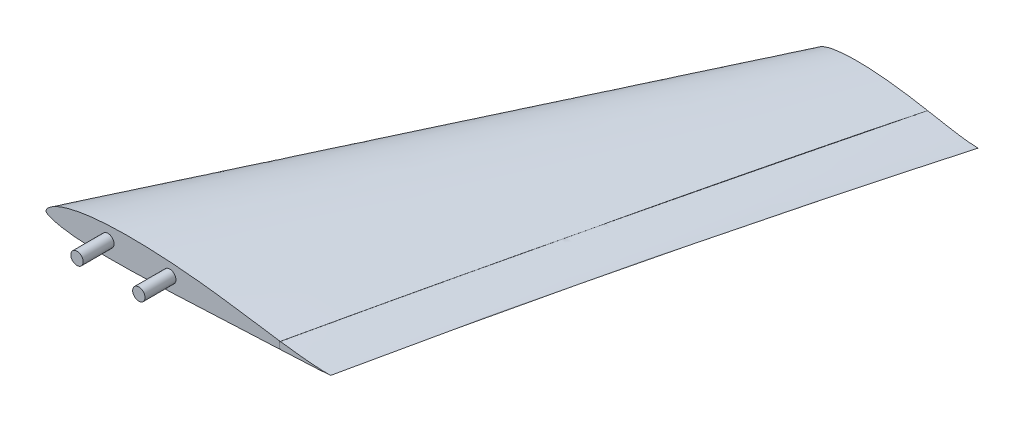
ISO-10303-21;
HEADER;
FILE_DESCRIPTION(('STEP AP214'),'2;1');
FILE_NAME('part.step','',(''),(''),'','','');
FILE_SCHEMA(('AUTOMOTIVE_DESIGN { 1 0 10303 214 1 1 1 1 }'));
ENDSEC;
DATA;
#1=APPLICATION_CONTEXT('core data for automotive mechanical design processes');
#2=APPLICATION_PROTOCOL_DEFINITION('international standard','automotive_design',2000,#1);
#3=PRODUCT_CONTEXT('',#1,'mechanical');
#4=PRODUCT('Part','Part','',(#3));
#5=PRODUCT_RELATED_PRODUCT_CATEGORY('part','',(#4));
#6=PRODUCT_DEFINITION_FORMATION('','',#4);
#7=PRODUCT_DEFINITION_CONTEXT('part definition',#1,'design');
#8=PRODUCT_DEFINITION('design','',#6,#7);
#9=PRODUCT_DEFINITION_SHAPE('','',#8);
#10=(LENGTH_UNIT() NAMED_UNIT(*) SI_UNIT(.MILLI.,.METRE.));
#11=(NAMED_UNIT(*) PLANE_ANGLE_UNIT() SI_UNIT($,.RADIAN.));
#12=(NAMED_UNIT(*) SI_UNIT($,.STERADIAN.) SOLID_ANGLE_UNIT());
#13=UNCERTAINTY_MEASURE_WITH_UNIT(LENGTH_MEASURE(1.E-05),#10,'distance_accuracy_value','');
#14=(GEOMETRIC_REPRESENTATION_CONTEXT(3) GLOBAL_UNCERTAINTY_ASSIGNED_CONTEXT((#13)) GLOBAL_UNIT_ASSIGNED_CONTEXT((#10,
#11,#12)) REPRESENTATION_CONTEXT('',''));
#15=CARTESIAN_POINT('',(0.,0.,0.));
#16=DIRECTION('',(0.,0.,1.));
#17=DIRECTION('',(1.,0.,0.));
#18=AXIS2_PLACEMENT_3D('',#15,#16,#17);
#19=CARTESIAN_POINT('',(307.679710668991,-2.23130595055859,-425.));
#20=DIRECTION('',(0.,0.,1.));
#21=DIRECTION('',(1.,0.,0.));
#22=AXIS2_PLACEMENT_3D('',#19,#20,#21);
#23=PLANE('',#22);
#24=CARTESIAN_POINT('',(327.92118083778,-4.49522719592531,-425.));
#25=CARTESIAN_POINT('',(327.776623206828,-4.49512611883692,-425.));
#26=CARTESIAN_POINT('',(327.194854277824,-4.49471933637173,-425.));
#27=CARTESIAN_POINT('',(325.888360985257,-4.46124779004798,-425.));
#28=CARTESIAN_POINT('',(323.735600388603,-4.32876185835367,-425.));
#29=CARTESIAN_POINT('',(320.784081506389,-4.06113228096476,-425.));
#30=CARTESIAN_POINT('',(315.446562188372,-3.45498815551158,-425.));
#31=CARTESIAN_POINT('',(309.31483828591,-2.52369590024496,-425.));
#32=CARTESIAN_POINT('',(300.48610080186,-1.00430380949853,-425.));
#33=CARTESIAN_POINT('',(293.690770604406,0.263535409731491,-425.));
#34=CARTESIAN_POINT('',(288.686942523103,1.1900754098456,-425.));
#35=CARTESIAN_POINT('',(287.617803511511,1.38662092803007,-425.));
#36=B_SPLINE_CURVE_WITH_KNOTS('',3,(#24,#25,#26,#27,#28,#29,#30,#31,#32,#33,#34,#35),
.UNSPECIFIED.,.F.,.F.,(4,1,1,1,1,1,1,1,1,4),(0.,0.00164677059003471,0.00662739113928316,
0.0148851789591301,0.0262122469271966,0.0403853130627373,0.0760749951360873,0.0968494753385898,
0.142437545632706,0.154821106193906),.UNSPECIFIED.);
#37=CARTESIAN_POINT('',(327.92118083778,-4.49522719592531,-425.));
#38=VERTEX_POINT('',#37);
#39=CARTESIAN_POINT('',(287.617803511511,1.38662092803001,-425.));
#40=VERTEX_POINT('',#39);
#41=EDGE_CURVE('E680',#38,#40,#36,.T.);
#42=ORIENTED_EDGE('',*,*,#41,.F.);
#43=DIRECTION('',(0.997739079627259,0.0672066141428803,0.));
#44=VECTOR('',#43,1.);
#45=CARTESIAN_POINT('',(327.506307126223,-4.52317263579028,-425.));
#46=LINE('',#45,#44);
#47=CARTESIAN_POINT('',(327.506307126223,-4.52317263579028,-425.));
#48=VERTEX_POINT('',#47);
#49=EDGE_CURVE('E13',#48,#38,#46,.T.);
#50=ORIENTED_EDGE('',*,*,#49,.F.);
#51=CARTESIAN_POINT('',(287.483506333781,-5.18767929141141,-425.));
#52=CARTESIAN_POINT('',(289.282567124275,-5.16440822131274,-425.));
#53=CARTESIAN_POINT('',(293.103384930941,-5.11474439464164,-425.));
#54=CARTESIAN_POINT('',(298.807828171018,-5.04207217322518,-425.));
#55=CARTESIAN_POINT('',(305.974060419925,-4.94979550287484,-425.));
#56=CARTESIAN_POINT('',(313.571539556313,-4.85708757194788,-425.));
#57=CARTESIAN_POINT('',(320.168798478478,-4.76830109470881,-425.));
#58=CARTESIAN_POINT('',(324.146539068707,-4.68511678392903,-425.));
#59=CARTESIAN_POINT('',(326.0697557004,-4.61526022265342,-425.));
#60=CARTESIAN_POINT('',(327.108361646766,-4.54868222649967,-425.));
#61=CARTESIAN_POINT('',(327.506307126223,-4.52317263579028,-425.));
#62=B_SPLINE_CURVE_WITH_KNOTS('',3,(#51,#52,#53,#54,#55,#56,#57,#58,#59,#60,#61),.UNSPECIFIED.,
.F.,.F.,(4,1,1,1,1,1,1,1,4),(0.847993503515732,0.868489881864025,0.891523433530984,
0.91298304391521,0.950133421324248,0.978079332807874,0.98814441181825,0.995457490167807,1.),.UNSPECIFIED.);
#63=CARTESIAN_POINT('',(287.483506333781,-5.18767929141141,-425.));
#64=VERTEX_POINT('',#63);
#65=EDGE_CURVE('E603',#64,#48,#62,.T.);
#66=ORIENTED_EDGE('',*,*,#65,.F.);
#67=CARTESIAN_POINT('',(287.473159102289,-4.38774620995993,-425.));
#68=DIRECTION('',(0.,0.,1.));
#69=DIRECTION('',(1.,0.,0.));
#70=AXIS2_PLACEMENT_3D('',#67,#68,#69);
#71=CIRCLE('',#70,0.799999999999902);
#72=CARTESIAN_POINT('',(286.673159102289,-4.38774620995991,-425.));
#73=VERTEX_POINT('',#72);
#74=EDGE_CURVE('E850',#73,#64,#71,.T.);
#75=ORIENTED_EDGE('',*,*,#74,.F.);
#76=DIRECTION('',(0.,-1.,0.));
#77=VECTOR('',#76,1.);
#78=CARTESIAN_POINT('',(286.67315910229,0.599805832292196,-425.));
#79=LINE('',#78,#77);
#80=CARTESIAN_POINT('',(286.67315910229,0.599805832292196,-425.));
#81=VERTEX_POINT('',#80);
#82=EDGE_CURVE('E617',#81,#73,#79,.T.);
#83=ORIENTED_EDGE('',*,*,#82,.F.);
#84=CARTESIAN_POINT('',(287.47315910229,0.599805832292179,-425.));
#85=DIRECTION('',(0.,0.,1.));
#86=DIRECTION('',(-1.,0.,0.));
#87=AXIS2_PLACEMENT_3D('',#84,#85,#86);
#88=CIRCLE('',#87,0.799999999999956);
#89=EDGE_CURVE('E611',#40,#81,#88,.T.);
#90=ORIENTED_EDGE('',*,*,#89,.F.);
#91=EDGE_LOOP('',(#42,#50,#66,#75,#83,#90));
#92=FACE_BOUND('',#91,.T.);
#93=ADVANCED_FACE('F593',(#92),#23,.F.);
#94=CARTESIAN_POINT('',(209.774918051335,1.03750444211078,0.));
#95=DIRECTION('',(0.,0.,1.));
#96=DIRECTION('',(1.,0.,0.));
#97=AXIS2_PLACEMENT_3D('',#94,#95,#96);
#98=PLANE('',#97);
#99=CARTESIAN_POINT('',(229.99804941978,0.0747020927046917,0.));
#100=CARTESIAN_POINT('',(229.742443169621,0.0659550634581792,0.));
#101=CARTESIAN_POINT('',(228.713761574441,0.0307528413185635,0.));
#102=CARTESIAN_POINT('',(226.401614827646,0.00926588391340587,0.));
#103=CARTESIAN_POINT('',(222.587024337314,0.110598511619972,0.));
#104=CARTESIAN_POINT('',(217.351762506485,0.401566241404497,0.));
#105=CARTESIAN_POINT('',(207.876785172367,1.14375526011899,0.));
#106=CARTESIAN_POINT('',(198.503420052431,2.2342821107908,0.));
#107=CARTESIAN_POINT('',(191.332880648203,3.18683788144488,0.));
#108=CARTESIAN_POINT('',(189.657765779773,3.41450399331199,0.));
#109=B_SPLINE_CURVE_WITH_KNOTS('',3,(#99,#100,#101,#102,#103,#104,#105,#106,#107,#108),
.UNSPECIFIED.,.F.,.F.,(4,1,1,1,1,1,1,4),(0.,0.00164677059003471,0.00662739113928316,
0.0148851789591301,0.0262122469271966,0.0403853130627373,0.0760749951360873,0.0869598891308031),.UNSPECIFIED.);
#110=CARTESIAN_POINT('',(229.99804941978,0.0747020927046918,0.));
#111=VERTEX_POINT('',#110);
#112=CARTESIAN_POINT('',(189.657765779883,3.41450399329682,0.));
#113=VERTEX_POINT('',#112);
#114=EDGE_CURVE('E656',#111,#113,#109,.T.);
#115=ORIENTED_EDGE('',*,*,#114,.T.);
#116=CARTESIAN_POINT('',(189.55002768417,2.62179187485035,0.));
#117=DIRECTION('',(0.,0.,1.));
#118=DIRECTION('',(-1.,0.,0.));
#119=AXIS2_PLACEMENT_3D('',#116,#117,#118);
#120=CIRCLE('',#119,0.799999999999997);
#121=CARTESIAN_POINT('',(188.75002768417,2.62179187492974,0.));
#122=VERTEX_POINT('',#121);
#123=EDGE_CURVE('E673',#113,#122,#120,.T.);
#124=ORIENTED_EDGE('',*,*,#123,.T.);
#125=DIRECTION('',(0.,-1.,0.));
#126=VECTOR('',#125,1.);
#127=CARTESIAN_POINT('',(188.75002768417,2.62179187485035,0.));
#128=LINE('',#127,#126);
#129=CARTESIAN_POINT('',(188.75002768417,-1.36416603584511,0.));
#130=VERTEX_POINT('',#129);
#131=EDGE_CURVE('E801',#122,#130,#128,.T.);
#132=ORIENTED_EDGE('',*,*,#131,.T.);
#133=CARTESIAN_POINT('',(189.55002768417,-1.36416603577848,0.));
#134=DIRECTION('',(0.,0.,1.));
#135=DIRECTION('',(1.,0.,0.));
#136=AXIS2_PLACEMENT_3D('',#133,#134,#135);
#137=CIRCLE('',#136,0.79999999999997);
#138=CARTESIAN_POINT('',(189.588012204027,-2.16326376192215,0.));
#139=VERTEX_POINT('',#138);
#140=EDGE_CURVE('E795',#130,#139,#137,.T.);
#141=ORIENTED_EDGE('',*,*,#140,.T.);
#142=CARTESIAN_POINT('',(189.588012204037,-2.16326376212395,0.));
#143=CARTESIAN_POINT('',(195.0839258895,-1.90201955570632,0.));
#144=CARTESIAN_POINT('',(204.915295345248,-1.43820878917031,0.));
#145=CARTESIAN_POINT('',(216.307512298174,-0.886807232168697,0.));
#146=CARTESIAN_POINT('',(223.335630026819,-0.494118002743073,0.));
#147=CARTESIAN_POINT('',(226.731857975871,-0.251851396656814,0.));
#148=CARTESIAN_POINT('',(228.564161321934,-0.0700023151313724,0.));
#149=CARTESIAN_POINT('',(229.266214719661,-0.000326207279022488,0.));
#150=B_SPLINE_CURVE_WITH_KNOTS('',3,(#142,#143,#144,#145,#146,#147,#148,#149),.UNSPECIFIED.,.F.,
.F.,(4,1,1,1,1,4),(0.914705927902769,0.950133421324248,0.978079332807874,0.98814441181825,
0.995457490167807,1.),.UNSPECIFIED.);
#151=CARTESIAN_POINT('',(229.266214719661,-0.000326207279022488,0.));
#152=VERTEX_POINT('',#151);
#153=EDGE_CURVE('E659',#139,#152,#150,.T.);
#154=ORIENTED_EDGE('',*,*,#153,.T.);
#155=DIRECTION('',(0.994785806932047,0.101986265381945,0.));
#156=VECTOR('',#155,1.);
#157=CARTESIAN_POINT('',(229.99804941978,0.0747020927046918,0.));
#158=LINE('',#157,#156);
#159=EDGE_CURVE('E651',#152,#111,#158,.T.);
#160=ORIENTED_EDGE('',*,*,#159,.T.);
#161=EDGE_LOOP('',(#115,#124,#132,#141,#154,#160));
#162=FACE_BOUND('',#161,.T.);
#163=ADVANCED_FACE('F654',(#162),#98,.T.);
#164=CARTESIAN_POINT('',(229.266214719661,-0.000326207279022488,0.));
#165=CARTESIAN_POINT('',(245.026591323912,0.751739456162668,-70.8759326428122));
#166=CARTESIAN_POINT('',(277.140383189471,0.75091616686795,-212.498965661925));
#167=CARTESIAN_POINT('',(310.51998626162,-2.26349149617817,-354.209265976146));
#168=CARTESIAN_POINT('',(327.506307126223,-4.52317263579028,-425.));
#169=CARTESIAN_POINT('',(228.854016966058,-0.0412352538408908,0.));
#170=CARTESIAN_POINT('',(244.620610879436,0.70925076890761,-70.8751106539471));
#171=CARTESIAN_POINT('',(276.74061067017,0.708556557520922,-212.499787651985));
#172=CARTESIAN_POINT('',(310.111353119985,-2.29646598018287,-354.20844398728));
#173=CARTESIAN_POINT('',(327.090125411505,-4.54985122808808,-425.));
#174=CARTESIAN_POINT('',(228.029599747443,-0.122715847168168,0.));
#175=CARTESIAN_POINT('',(243.808628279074,0.624610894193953,-70.8734666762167));
#176=CARTESIAN_POINT('',(275.940747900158,0.626323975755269,-212.501431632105));
#177=CARTESIAN_POINT('',(309.294031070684,-2.36236046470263,-354.20680000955));
#178=CARTESIAN_POINT('',(326.257706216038,-4.60315392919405,-425.));
#179=CARTESIAN_POINT('',(226.792306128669,-0.236467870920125,0.));
#180=CARTESIAN_POINT('',(242.589787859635,0.505192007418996,-70.87095264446));
#181=CARTESIAN_POINT('',(274.740008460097,0.511159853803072,-212.503945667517));
#182=CARTESIAN_POINT('',(308.066605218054,-2.44022528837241,-354.204285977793));
#183=CARTESIAN_POINT('',(325.007531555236,-4.65459888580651,-425.));
#184=CARTESIAN_POINT('',(225.553742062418,-0.334294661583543,0.));
#185=CARTESIAN_POINT('',(241.36938662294,0.403386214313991,-70.8685005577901));
#186=CARTESIAN_POINT('',(273.537441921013,0.415584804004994,-212.506397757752));
#187=CARTESIAN_POINT('',(306.838136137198,-2.50125101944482,-354.201833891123));
#188=CARTESIAN_POINT('',(323.756866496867,-4.69124918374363,-425.));
#189=CARTESIAN_POINT('',(223.901267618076,-0.449737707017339,0.));
#190=CARTESIAN_POINT('',(239.740914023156,0.283436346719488,-70.8652844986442));
#191=CARTESIAN_POINT('',(271.93263570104,0.30402140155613,-212.509613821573));
#192=CARTESIAN_POINT('',(305.199378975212,-2.56905886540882,-354.198617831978));
#193=CARTESIAN_POINT('',(322.088964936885,-4.72848129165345,-425.));
#194=CARTESIAN_POINT('',(221.834891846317,-0.577632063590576,0.));
#195=CARTESIAN_POINT('',(237.704562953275,0.147594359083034,-70.8612837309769));
#196=CARTESIAN_POINT('',(269.925959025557,0.175268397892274,-212.513614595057));
#197=CARTESIAN_POINT('',(303.150534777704,-2.64429800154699,-354.19461706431));
#198=CARTESIAN_POINT('',(320.003849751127,-4.76547034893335,-425.));
#199=CARTESIAN_POINT('',(219.354545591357,-0.714945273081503,0.));
#200=CARTESIAN_POINT('',(235.259887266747,0.00034546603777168,-70.8565644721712));
#201=CARTESIAN_POINT('',(267.516567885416,0.0344274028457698,-212.518333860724));
#202=CARTESIAN_POINT('',(300.691228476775,-2.7255667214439,-354.189897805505));
#203=CARTESIAN_POINT('',(317.501556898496,-4.80381360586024,-425.));
#204=CARTESIAN_POINT('',(216.874168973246,-0.846429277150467,0.));
#205=CARTESIAN_POINT('',(232.815031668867,-0.143032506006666,-70.8518614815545));
#206=CARTESIAN_POINT('',(265.106827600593,-0.104598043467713,-212.523036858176));
#207=CARTESIAN_POINT('',(298.231703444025,-2.80341229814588,-354.185194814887));
#208=CARTESIAN_POINT('',(314.999178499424,-4.83699901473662,-425.));
#209=CARTESIAN_POINT('',(214.393768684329,-0.973711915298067,0.));
#210=CARTESIAN_POINT('',(230.369812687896,-0.281010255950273,-70.8472178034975));
#211=CARTESIAN_POINT('',(262.696336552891,-0.237547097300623,-212.527680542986));
#212=CARTESIAN_POINT('',(295.771847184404,-2.87795530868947,-354.180551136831));
#213=CARTESIAN_POINT('',(312.496813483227,-4.86912924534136,-425.));
#214=CARTESIAN_POINT('',(211.913358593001,-1.09737613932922,0.));
#215=CARTESIAN_POINT('',(227.924373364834,-0.415865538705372,-70.842612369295));
#216=CARTESIAN_POINT('',(260.285440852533,-0.368320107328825,-212.532285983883));
#217=CARTESIAN_POINT('',(293.31178743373,-2.95127852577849,-354.175945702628));
#218=CARTESIAN_POINT('',(309.99450561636,-4.90049656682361,-425.));
#219=CARTESIAN_POINT('',(208.606143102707,-1.2587853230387,0.));
#220=CARTESIAN_POINT('',(224.663561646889,-0.592989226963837,-70.8365052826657));
#221=CARTESIAN_POINT('',(257.070247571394,-0.54139958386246,-212.53839307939));
#222=CARTESIAN_POINT('',(290.03171381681,-3.0484666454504,-354.169838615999));
#223=CARTESIAN_POINT('',(306.658233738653,-4.94199641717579,-425.));
#224=CARTESIAN_POINT('',(204.472140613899,-1.45655615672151,0.));
#225=CARTESIAN_POINT('',(220.586774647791,-0.811535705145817,-70.8290450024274));
#226=CARTESIAN_POINT('',(253.051129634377,-0.756164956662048,-212.545853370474));
#227=CARTESIAN_POINT('',(285.930122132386,-3.17018211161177,-354.162378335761));
#228=CARTESIAN_POINT('',(302.488270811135,-4.99456633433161,-425.000000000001));
#229=CARTESIAN_POINT('',(199.511283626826,-1.69260850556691,0.));
#230=CARTESIAN_POINT('',(215.695333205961,-1.07161773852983,-70.8198135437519));
#231=CARTESIAN_POINT('',(248.223126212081,-1.01407442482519,-212.555084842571));
#232=CARTESIAN_POINT('',(281.014004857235,-3.31596232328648,-354.153146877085));
#233=CARTESIAN_POINT('',(297.485242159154,-5.05897726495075,-425.));
#234=CARTESIAN_POINT('',(194.550055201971,-1.927770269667,0.));
#235=CARTESIAN_POINT('',(210.797665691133,-1.33580202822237,-70.8121901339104));
#236=CARTESIAN_POINT('',(243.407284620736,-1.27066347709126,-212.562708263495));
#237=CARTESIAN_POINT('',(276.076528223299,-3.46541545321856,-354.145523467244));
#238=CARTESIAN_POINT('',(292.483435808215,-5.12274231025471,-425.));
#239=CARTESIAN_POINT('',(191.242131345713,-2.08463642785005,0.));
#240=CARTESIAN_POINT('',(207.545044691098,-1.50325293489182,-70.803473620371));
#241=CARTESIAN_POINT('',(240.162565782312,-1.45031595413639,-212.571424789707));
#242=CARTESIAN_POINT('',(272.838587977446,-3.55837048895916,-354.136806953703));
#243=CARTESIAN_POINT('',(289.14994301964,-5.16612373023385,-425.));
#244=CARTESIAN_POINT('',(189.48053074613,-2.16837281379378,0.));
#245=CARTESIAN_POINT('',(205.799685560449,-1.60138349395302,-70.8025442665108));
#246=CARTESIAN_POINT('',(238.467654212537,-1.53789234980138,-212.572354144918));
#247=CARTESIAN_POINT('',(271.061406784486,-3.61513673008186,-354.135877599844));
#248=CARTESIAN_POINT('',(287.375224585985,-5.18907992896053,-425.));
#249=CARTESIAN_POINT('',(189.258229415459,-2.13446197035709,0.));
#250=CARTESIAN_POINT('',(205.579261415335,-1.56929857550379,-70.8024602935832));
#251=CARTESIAN_POINT('',(238.248319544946,-1.50786178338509,-212.572438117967));
#252=CARTESIAN_POINT('',(270.852474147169,-3.57838112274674,-354.135793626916));
#253=CARTESIAN_POINT('',(287.167015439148,-5.14813979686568,-425.));
#254=CARTESIAN_POINT('',(188.970521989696,-1.94922140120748,0.));
#255=CARTESIAN_POINT('',(205.288773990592,-1.38660774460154,-70.8033615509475));
#256=CARTESIAN_POINT('',(237.96032064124,-1.32970261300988,-212.571536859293));
#257=CARTESIAN_POINT('',(270.579306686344,-3.40741963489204,-354.136694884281));
#258=CARTESIAN_POINT('',(286.906768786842,-4.98013432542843,-425.));
#259=CARTESIAN_POINT('',(188.787619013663,-1.67014357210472,0.));
#260=CARTESIAN_POINT('',(205.101826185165,-1.10535027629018,-70.8038287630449));
#261=CARTESIAN_POINT('',(237.768616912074,-1.05145072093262,-212.571069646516));
#262=CARTESIAN_POINT('',(270.393314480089,-3.14030882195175,-354.137162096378));
#263=CARTESIAN_POINT('',(286.724093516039,-4.72374702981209,-425.));
#264=CARTESIAN_POINT('',(188.75002768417,-1.46352602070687,0.));
#265=CARTESIAN_POINT('',(205.063837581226,-0.896654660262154,-70.8036798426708));
#266=CARTESIAN_POINT('',(237.728371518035,-0.835560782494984,-212.571218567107));
#267=CARTESIAN_POINT('',(270.344945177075,-2.92626965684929,-354.137013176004));
#268=CARTESIAN_POINT('',(286.673159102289,-4.50543196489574,-425.));
#269=CARTESIAN_POINT('',(188.75002768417,-1.02347653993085,0.));
#270=CARTESIAN_POINT('',(205.063242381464,-0.452866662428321,-70.8034101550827));
#271=CARTESIAN_POINT('',(237.726800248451,-0.383967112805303,-212.571488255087));
#272=CARTESIAN_POINT('',(270.348690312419,-2.42094345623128,-354.136743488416));
#273=CARTESIAN_POINT('',(286.673159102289,-3.98422058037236,-425.));
#274=CARTESIAN_POINT('',(188.750027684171,-0.354824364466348,0.));
#275=CARTESIAN_POINT('',(205.063831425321,0.216991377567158,-70.8033115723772));
#276=CARTESIAN_POINT('',(237.728738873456,0.323531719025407,-212.571586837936));
#277=CARTESIAN_POINT('',(270.344215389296,-1.65622038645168,-354.136644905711));
#278=CARTESIAN_POINT('',(286.673159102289,-3.16083351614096,-425.));
#279=CARTESIAN_POINT('',(188.75002768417,0.6304556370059,0.));
#280=CARTESIAN_POINT('',(205.063430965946,1.20751764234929,-70.8027744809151));
#281=CARTESIAN_POINT('',(237.727828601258,1.36205064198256,-212.572123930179));
#282=CARTESIAN_POINT('',(270.346440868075,-0.477546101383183,-354.136107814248));
#283=CARTESIAN_POINT('',(286.67315910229,-1.89752643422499,-425.));
#284=CARTESIAN_POINT('',(188.750027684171,1.61502479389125,0.));
#285=CARTESIAN_POINT('',(205.063556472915,2.19640059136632,-70.802498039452));
#286=CARTESIAN_POINT('',(237.729154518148,2.40085506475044,-212.572400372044));
#287=CARTESIAN_POINT('',(270.343658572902,0.699598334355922,-354.135831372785));
#288=CARTESIAN_POINT('',(286.673159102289,-0.632441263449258,-425.));
#289=CARTESIAN_POINT('',(188.75002768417,2.28218053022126,0.));
#290=CARTESIAN_POINT('',(205.063112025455,2.86518941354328,-70.8019581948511));
#291=CARTESIAN_POINT('',(237.726602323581,3.10362999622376,-212.572940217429));
#292=CARTESIAN_POINT('',(270.349217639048,1.46954425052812,-354.135291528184));
#293=CARTESIAN_POINT('',(286.67315910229,0.194249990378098,-425.));
#294=CARTESIAN_POINT('',(188.75002768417,2.72806898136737,0.));
#295=CARTESIAN_POINT('',(205.063423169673,3.3133713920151,-70.8021204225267));
#296=CARTESIAN_POINT('',(237.728924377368,3.56320087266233,-212.572777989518));
#297=CARTESIAN_POINT('',(270.344253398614,1.98029356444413,-354.13545375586));
#298=CARTESIAN_POINT('',(286.67315910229,0.726719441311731,-425.));
#299=CARTESIAN_POINT('',(188.793066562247,2.946838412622,0.));
#300=CARTESIAN_POINT('',(205.106700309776,3.53341635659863,-70.8022748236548));
#301=CARTESIAN_POINT('',(237.774544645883,3.7902631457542,-212.572623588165));
#302=CARTESIAN_POINT('',(270.400873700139,2.2138856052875,-354.135608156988));
#303=CARTESIAN_POINT('',(286.733430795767,0.968348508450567,-425.));
#304=CARTESIAN_POINT('',(188.994487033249,3.23240804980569,0.));
#305=CARTESIAN_POINT('',(205.310476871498,3.81993941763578,-70.8025022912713));
#306=CARTESIAN_POINT('',(237.984740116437,4.07504875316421,-212.572396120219));
#307=CARTESIAN_POINT('',(270.61907666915,2.49424674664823,-354.135835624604));
#308=CARTESIAN_POINT('',(286.95769309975,1.24364646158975,-425.));
#309=CARTESIAN_POINT('',(189.305059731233,3.41082512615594,0.));
#310=CARTESIAN_POINT('',(205.621576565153,3.99604517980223,-70.8024710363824));
#311=CARTESIAN_POINT('',(238.295982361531,4.24599265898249,-212.572427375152));
#312=CARTESIAN_POINT('',(270.931472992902,2.65464968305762,-354.135804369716));
#313=CARTESIAN_POINT('',(287.269574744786,1.39881598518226,-425.));
#314=CARTESIAN_POINT('',(189.543286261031,3.43006299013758,0.));
#315=CARTESIAN_POINT('',(205.856985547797,4.01512880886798,-70.802753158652));
#316=CARTESIAN_POINT('',(238.529035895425,4.2610907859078,-212.572145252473));
#317=CARTESIAN_POINT('',(271.163339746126,2.66688909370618,-354.136086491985));
#318=CARTESIAN_POINT('',(287.503382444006,1.40765556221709,-425.));
#319=CARTESIAN_POINT('',(191.329707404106,3.18726915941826,0.));
#320=CARTESIAN_POINT('',(207.6209580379,3.77201397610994,-70.8050469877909));
#321=CARTESIAN_POINT('',(240.254117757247,4.02530198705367,-212.56985142));
#322=CARTESIAN_POINT('',(272.932576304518,2.36631336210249,-354.138380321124));
#323=CARTESIAN_POINT('',(289.288884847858,1.07941714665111,-425.));
#324=CARTESIAN_POINT('',(194.675610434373,2.7422340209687,0.));
#325=CARTESIAN_POINT('',(210.912122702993,3.35050026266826,-70.8118726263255));
#326=CARTESIAN_POINT('',(243.505132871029,3.56806135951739,-212.563025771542));
#327=CARTESIAN_POINT('',(276.212343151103,1.82821448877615,-354.145205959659));
#328=CARTESIAN_POINT('',(292.629769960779,0.458480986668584,-425.));
#329=CARTESIAN_POINT('',(199.701119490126,2.11411154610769,0.));
#330=CARTESIAN_POINT('',(215.863821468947,2.73857159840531,-70.8202508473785));
#331=CARTESIAN_POINT('',(248.366818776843,2.93439180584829,-212.554647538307));
#332=CARTESIAN_POINT('',(281.158041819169,1.01575344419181,-354.153584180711));
#333=CARTESIAN_POINT('',(297.641423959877,-0.470028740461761,-424.999999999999));
#334=CARTESIAN_POINT('',(204.733878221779,1.53654594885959,0.));
#335=CARTESIAN_POINT('',(220.819019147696,2.18060119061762,-70.8293220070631));
#336=CARTESIAN_POINT('',(253.237463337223,2.33801092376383,-212.545576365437));
#337=CARTESIAN_POINT('',(286.10081532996,0.238265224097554,-354.162655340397));
#338=CARTESIAN_POINT('',(302.656847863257,-1.37698140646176,-425.000000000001));
#339=CARTESIAN_POINT('',(209.774081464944,1.02409847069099,0.));
#340=CARTESIAN_POINT('',(225.782051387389,1.68558940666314,-70.8383755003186));
#341=CARTESIAN_POINT('',(258.113546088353,1.80262225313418,-212.536522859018));
#342=CARTESIAN_POINT('',(291.052344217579,-0.492156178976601,-354.171708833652));
#343=CARTESIAN_POINT('',(307.679445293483,-2.24251323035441,-424.999999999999));
#344=CARTESIAN_POINT('',(213.980616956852,0.663458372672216,0.));
#345=CARTESIAN_POINT('',(229.924454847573,1.34186375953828,-70.8460489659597));
#346=CARTESIAN_POINT('',(262.18464981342,1.42479916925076,-212.528849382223));
#347=CARTESIAN_POINT('',(295.186666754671,-1.03979165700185,-354.179382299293));
#348=CARTESIAN_POINT('',(311.873944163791,-2.90902639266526,-425.));
#349=CARTESIAN_POINT('',(217.348931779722,0.420337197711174,0.));
#350=CARTESIAN_POINT('',(233.241924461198,1.11404922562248,-70.8522499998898));
#351=CARTESIAN_POINT('',(265.446188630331,1.17310588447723,-212.522648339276));
#352=CARTESIAN_POINT('',(298.501014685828,-1.42513288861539,-354.185583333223));
#353=CARTESIAN_POINT('',(315.237565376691,-3.38843435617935,-425.));
#354=CARTESIAN_POINT('',(219.876626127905,0.261786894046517,0.));
#355=CARTESIAN_POINT('',(235.731658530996,0.967949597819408,-70.8569374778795));
#356=CARTESIAN_POINT('',(267.894620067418,1.01150435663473,-212.517960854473));
#357=CARTESIAN_POINT('',(300.990318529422,-1.68355976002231,-354.190270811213));
#358=CARTESIAN_POINT('',(317.764616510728,-3.71548278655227,-425.));
#359=CARTESIAN_POINT('',(222.405749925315,0.134242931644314,0.));
#360=CARTESIAN_POINT('',(238.22288818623,0.850691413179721,-70.8616675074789));
#361=CARTESIAN_POINT('',(270.345117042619,0.877790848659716,-212.513230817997));
#362=CARTESIAN_POINT('',(303.4832727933,-1.9084294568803,-354.195000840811));
#363=CARTESIAN_POINT('',(320.296327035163,-4.00441741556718,-424.999999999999));
#364=CARTESIAN_POINT('',(224.936226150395,0.0441454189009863,0.));
#365=CARTESIAN_POINT('',(240.71577062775,0.770952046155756,-70.8664270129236));
#366=CARTESIAN_POINT('',(272.79804351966,0.782238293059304,-212.508471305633));
#367=CARTESIAN_POINT('',(305.979863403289,-2.09333158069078,-354.199760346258));
#368=CARTESIAN_POINT('',(322.832364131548,-4.25235820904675,-425.000000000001));
#369=CARTESIAN_POINT('',(227.045808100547,0.0164779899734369,0.));
#370=CARTESIAN_POINT('',(242.794268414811,0.751183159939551,-70.8704344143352));
#371=CARTESIAN_POINT('',(274.844029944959,0.74891135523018,-212.504463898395));
#372=CARTESIAN_POINT('',(308.063735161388,-2.20000884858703,-354.203767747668));
#373=CARTESIAN_POINT('',(324.950011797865,-4.41007989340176,-424.999999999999));
#374=CARTESIAN_POINT('',(228.733275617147,0.0334467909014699,0.));
#375=CARTESIAN_POINT('',(244.456965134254,0.775614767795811,-70.8736805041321));
#376=CARTESIAN_POINT('',(276.481328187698,0.765251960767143,-212.501217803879));
#377=CARTESIAN_POINT('',(309.73290167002,-2.23723682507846,-354.207013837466));
#378=CARTESIAN_POINT('',(326.647174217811,-4.48622919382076,-425.));
#379=CARTESIAN_POINT('',(229.576503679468,0.0602764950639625,0.));
#380=CARTESIAN_POINT('',(245.287721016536,0.806870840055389,-70.87530797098));
#381=CARTESIAN_POINT('',(277.299502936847,0.795384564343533,-212.499590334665));
#382=CARTESIAN_POINT('',(310.567726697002,-2.23052128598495,-354.208641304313));
#383=CARTESIAN_POINT('',(327.496525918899,-4.49493027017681,-425.));
#384=CARTESIAN_POINT('',(229.99804941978,0.0747020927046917,0.));
#385=CARTESIAN_POINT('',(245.70303066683,0.823509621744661,-70.876121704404));
#386=CARTESIAN_POINT('',(277.708533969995,0.811596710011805,-212.498776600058));
#387=CARTESIAN_POINT('',(310.98511827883,-2.22310990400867,-354.209455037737));
#388=CARTESIAN_POINT('',(327.92118083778,-4.49522719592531,-425.));
#389=B_SPLINE_SURFACE_WITH_KNOTS('',3,3,((#164,#165,#166,#167,#168),(#169,#170,#171,#172,#173),
(#174,#175,#176,#177,#178),(#179,#180,#181,#182,#183),(#184,#185,#186,#187,#188),(#189,#190,
#191,#192,#193),(#194,#195,#196,#197,#198),(#199,#200,#201,#202,#203),(#204,#205,#206,#207,
#208),(#209,#210,#211,#212,#213),(#214,#215,#216,#217,#218),(#219,#220,#221,#222,#223),(#224,
#225,#226,#227,#228),(#229,#230,#231,#232,#233),(#234,#235,#236,#237,#238),(#239,#240,#241,#242,
#243),(#244,#245,#246,#247,#248),(#249,#250,#251,#252,#253),(#254,#255,#256,#257,#258),(#259,
#260,#261,#262,#263),(#264,#265,#266,#267,#268),(#269,#270,#271,#272,#273),(#274,#275,#276,#277,
#278),(#279,#280,#281,#282,#283),(#284,#285,#286,#287,#288),(#289,#290,#291,#292,#293),(#294,
#295,#296,#297,#298),(#299,#300,#301,#302,#303),(#304,#305,#306,#307,#308),(#309,#310,#311,#312,
#313),(#314,#315,#316,#317,#318),(#319,#320,#321,#322,#323),(#324,#325,#326,#327,#328),(#329,
#330,#331,#332,#333),(#334,#335,#336,#337,#338),(#339,#340,#341,#342,#343),(#344,#345,#346,#347,
#348),(#349,#350,#351,#352,#353),(#354,#355,#356,#357,#358),(#359,#360,#361,#362,#363),(#364,
#365,#366,#367,#368),(#369,#370,#371,#372,#373),(#374,#375,#376,#377,#378),(#379,#380,#381,#382,
#383),(#384,#385,#386,#387,#388)),.UNSPECIFIED.,.F.,.F.,.F.,(4,1,1,1,1,1,1,1,1,1,1,1,1,1,2,1,1,
1,2,1,1,1,2,1,1,1,2,1,1,1,1,1,1,1,1,1,1,1,4),(4,1,4),(0.,0.014223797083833,0.0284475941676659,
0.0426713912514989,0.0568951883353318,0.0853427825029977,0.113790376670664,0.14223797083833,
0.170685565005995,0.199133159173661,0.227580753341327,0.284475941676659,0.341371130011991,
0.398266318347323,0.455161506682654,0.458858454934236,0.462555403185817,0.466252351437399,
0.46994929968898,0.482625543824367,0.495301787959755,0.507978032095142,0.520654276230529,
0.524621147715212,0.528588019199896,0.532554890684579,0.536521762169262,0.594456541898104,
0.652391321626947,0.710326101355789,0.768260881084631,0.826195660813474,0.855163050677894,
0.884130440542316,0.913097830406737,0.942065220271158,0.971032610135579,0.98551630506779,1.),
(0.,0.499573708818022,1.),.UNSPECIFIED.);
#390=CARTESIAN_POINT('',(229.99804941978,0.0747020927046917,0.));
#391=CARTESIAN_POINT('',(245.70303066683,0.823509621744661,-70.876121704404));
#392=CARTESIAN_POINT('',(277.708533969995,0.811596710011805,-212.498776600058));
#393=CARTESIAN_POINT('',(310.98511827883,-2.22310990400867,-354.209455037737));
#394=CARTESIAN_POINT('',(327.92118083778,-4.49522719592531,-425.));
#395=B_SPLINE_CURVE_WITH_KNOTS('',3,(#390,#391,#392,#393,#394),.UNSPECIFIED.,.F.,.F.,(4,1,4),
(0.,0.499573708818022,1.),.UNSPECIFIED.);
#396=EDGE_CURVE('E672',#111,#38,#395,.T.);
#397=CARTESIAN_POINT('',(229.266214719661,-0.000326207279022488,0.));
#398=CARTESIAN_POINT('',(245.026591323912,0.751739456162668,-70.8759326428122));
#399=CARTESIAN_POINT('',(277.140383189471,0.75091616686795,-212.498965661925));
#400=CARTESIAN_POINT('',(310.51998626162,-2.26349149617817,-354.209265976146));
#401=CARTESIAN_POINT('',(327.506307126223,-4.52317263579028,-425.));
#402=B_SPLINE_CURVE_WITH_KNOTS('',3,(#397,#398,#399,#400,#401),.UNSPECIFIED.,.F.,.F.,(4,1,4),
(0.,0.499573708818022,1.),.UNSPECIFIED.);
#403=EDGE_CURVE('E665',#48,#152,#402,.F.);
#404=ORIENTED_EDGE('',*,*,#153,.F.);
#405=ORIENTED_EDGE('',*,*,#140,.F.);
#406=ORIENTED_EDGE('',*,*,#131,.F.);
#407=ORIENTED_EDGE('',*,*,#123,.F.);
#408=ORIENTED_EDGE('',*,*,#114,.F.);
#409=ORIENTED_EDGE('',*,*,#396,.T.);
#410=ORIENTED_EDGE('',*,*,#41,.T.);
#411=ORIENTED_EDGE('',*,*,#89,.T.);
#412=ORIENTED_EDGE('',*,*,#82,.T.);
#413=ORIENTED_EDGE('',*,*,#74,.T.);
#414=ORIENTED_EDGE('',*,*,#65,.T.);
#415=ORIENTED_EDGE('',*,*,#403,.T.);
#416=EDGE_LOOP('',(#404,#405,#406,#407,#408,#409,#410,#411,#412,#413,#414,#415));
#417=FACE_BOUND('',#416,.T.);
#418=ADVANCED_FACE('F671',(#417),#389,.T.);
#419=CARTESIAN_POINT('',(229.99804941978,0.0747020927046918,0.));
#420=CARTESIAN_POINT('',(245.70303066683,0.823509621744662,-70.876121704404));
#421=CARTESIAN_POINT('',(277.708533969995,0.811596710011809,-212.498776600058));
#422=CARTESIAN_POINT('',(310.98511827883,-2.22310990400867,-354.209455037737));
#423=CARTESIAN_POINT('',(327.92118083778,-4.49522719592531,-425.));
#424=CARTESIAN_POINT('',(229.75410451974,0.049692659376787,0.));
#425=CARTESIAN_POINT('',(245.477550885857,0.799586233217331,-70.8760586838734));
#426=CARTESIAN_POINT('',(277.519150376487,0.791369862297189,-212.49883962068));
#427=CARTESIAN_POINT('',(310.830074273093,-2.23657043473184,-354.209392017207));
#428=CARTESIAN_POINT('',(327.782889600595,-4.50454234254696,-425.));
#429=CARTESIAN_POINT('',(229.510159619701,0.0246832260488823,0.));
#430=CARTESIAN_POINT('',(245.252071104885,0.775662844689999,-70.8759956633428));
#431=CARTESIAN_POINT('',(277.329766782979,0.77114301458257,-212.498902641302));
#432=CARTESIAN_POINT('',(310.675030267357,-2.250030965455,-354.209328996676));
#433=CARTESIAN_POINT('',(327.644598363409,-4.51385748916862,-425.));
#434=CARTESIAN_POINT('',(229.266214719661,-0.000326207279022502,0.));
#435=CARTESIAN_POINT('',(245.026591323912,0.751739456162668,-70.8759326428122));
#436=CARTESIAN_POINT('',(277.140383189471,0.75091616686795,-212.498965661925));
#437=CARTESIAN_POINT('',(310.51998626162,-2.26349149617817,-354.209265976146));
#438=CARTESIAN_POINT('',(327.506307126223,-4.52317263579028,-425.));
#439=B_SPLINE_SURFACE_WITH_KNOTS('',3,3,((#419,#420,#421,#422,#423),(#424,#425,#426,#427,#428),
(#429,#430,#431,#432,#433),(#434,#435,#436,#437,#438)),.UNSPECIFIED.,.F.,.F.,.F.,(4,4),(4,1,4),
(0.,1.),(0.,0.499573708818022,1.),.UNSPECIFIED.);
#440=ORIENTED_EDGE('',*,*,#159,.F.);
#441=ORIENTED_EDGE('',*,*,#403,.F.);
#442=ORIENTED_EDGE('',*,*,#49,.T.);
#443=ORIENTED_EDGE('',*,*,#396,.F.);
#444=EDGE_LOOP('',(#440,#441,#442,#443));
#445=FACE_BOUND('',#444,.T.);
#446=ADVANCED_FACE('F678',(#445),#439,.T.);
#447=CLOSED_SHELL('',(#93,#163,#418,#446));
#448=MANIFOLD_SOLID_BREP('B2',#447);
#449=CARTESIAN_POINT('',(287.506307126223,10.,-425.));
#450=DIRECTION('',(0.97430917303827,0.,0.225214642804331));
#451=DIRECTION('',(0.225214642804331,0.,-0.97430917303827));
#452=AXIS2_PLACEMENT_3D('',#449,#450,#451);
#453=PLANE('',#452);
#454=CARTESIAN_POINT('',(287.506307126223,1.40711263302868,-425.));
#455=CARTESIAN_POINT('',(286.423408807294,1.49104400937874,-420.315234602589));
#456=CARTESIAN_POINT('',(285.340502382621,1.57291260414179,-415.630434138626));
#457=CARTESIAN_POINT('',(283.17467417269,1.73254077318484,-406.260766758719));
#458=CARTESIAN_POINT('',(282.091752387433,1.81030034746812,-401.575899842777));
#459=CARTESIAN_POINT('',(279.925894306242,1.96172701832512,-392.206103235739));
#460=CARTESIAN_POINT('',(278.842958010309,2.03539411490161,-387.521173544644));
#461=CARTESIAN_POINT('',(276.677071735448,2.17864931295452,-378.151254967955));
#462=CARTESIAN_POINT('',(275.59412175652,2.24823741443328,-373.466266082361));
#463=CARTESIAN_POINT('',(273.428208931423,2.3833464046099,-364.096232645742));
#464=CARTESIAN_POINT('',(272.345246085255,2.44886729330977,-359.411188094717));
#465=CARTESIAN_POINT('',(270.179308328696,2.57585195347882,-350.041046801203));
#466=CARTESIAN_POINT('',(269.096333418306,2.63731572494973,-345.355950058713));
#467=CARTESIAN_POINT('',(266.930372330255,2.75619481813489,-335.985707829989));
#468=CARTESIAN_POINT('',(265.847386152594,2.81361013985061,-331.300562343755));
#469=CARTESIAN_POINT('',(263.681403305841,2.92439972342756,-321.930225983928));
#470=CARTESIAN_POINT('',(262.598406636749,2.97777398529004,-317.245035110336));
#471=CARTESIAN_POINT('',(260.432403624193,3.08048757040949,-307.8746115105));
#472=CARTESIAN_POINT('',(259.349397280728,3.12982689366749,-303.189378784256));
#473=CARTESIAN_POINT('',(256.100364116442,3.27180042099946,-289.133619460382));
#474=CARTESIAN_POINT('',(253.934323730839,3.35839015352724,-279.763034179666));
#475=CARTESIAN_POINT('',(249.602213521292,3.51547911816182,-261.021736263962));
#476=CARTESIAN_POINT('',(247.436143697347,3.5859783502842,-251.651023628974));
#477=CARTESIAN_POINT('',(243.103980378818,3.71089699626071,-232.909495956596));
#478=CARTESIAN_POINT('',(240.937886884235,3.76531641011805,-223.538680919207));
#479=CARTESIAN_POINT('',(237.688734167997,3.83487919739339,-209.482404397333));
#480=CARTESIAN_POINT('',(236.605681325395,3.85605573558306,-204.796970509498));
#481=CARTESIAN_POINT('',(234.439571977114,3.89438071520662,-195.426086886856));
#482=CARTESIAN_POINT('',(233.356515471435,3.91152915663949,-190.740637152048));
#483=CARTESIAN_POINT('',(231.731928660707,3.93422670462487,-183.712453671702));
#484=CARTESIAN_POINT('',(231.190399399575,3.94128836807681,-181.369724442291));
#485=CARTESIAN_POINT('',(229.565810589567,3.9609598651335,-174.341532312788));
#486=CARTESIAN_POINT('',(228.482750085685,3.97205620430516,-169.656065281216));
#487=CARTESIAN_POINT('',(226.316627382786,3.9902084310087,-160.285123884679));
#488=CARTESIAN_POINT('',(225.233565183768,3.99726431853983,-155.599649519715));
#489=CARTESIAN_POINT('',(223.067439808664,4.007331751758,-146.228696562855));
#490=CARTESIAN_POINT('',(221.984376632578,4.01034329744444,-141.54321797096));
#491=CARTESIAN_POINT('',(220.359781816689,4.01182565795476,-134.514999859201));
#492=CARTESIAN_POINT('',(219.81825022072,4.01181395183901,-132.172260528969));
#493=CARTESIAN_POINT('',(218.193655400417,4.01026003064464,-125.144042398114));
#494=CARTESIAN_POINT('',(217.110592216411,4.00719901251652,-120.458563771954));
#495=CARTESIAN_POINT('',(215.485998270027,3.99953955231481,-113.43034942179));
#496=CARTESIAN_POINT('',(214.944467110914,3.99647507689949,-111.087611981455));
#497=CARTESIAN_POINT('',(213.861405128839,3.98932633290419,-106.402138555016));
#498=CARTESIAN_POINT('',(213.319874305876,3.98524206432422,-104.059402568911));
#499=CARTESIAN_POINT('',(212.236813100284,3.97605355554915,-99.3739325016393));
#500=CARTESIAN_POINT('',(211.695282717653,3.97094931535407,-97.0311984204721));
#501=CARTESIAN_POINT('',(210.612222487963,3.95972171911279,-92.3457325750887));
#502=CARTESIAN_POINT('',(210.070692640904,3.95359836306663,-90.0030008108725));
#503=CARTESIAN_POINT('',(208.98763357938,3.94033333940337,-85.3175400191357));
#504=CARTESIAN_POINT('',(208.446104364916,3.93319167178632,-82.9748109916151));
#505=CARTESIAN_POINT('',(207.363046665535,3.9178910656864,-78.2893560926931));
#506=CARTESIAN_POINT('',(206.821518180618,3.90973212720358,-75.9466302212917));
#507=CARTESIAN_POINT('',(205.738462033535,3.89239816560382,-71.2611820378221));
#508=CARTESIAN_POINT('',(205.19693437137,3.88322314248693,-68.9184597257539));
#509=CARTESIAN_POINT('',(204.384643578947,3.86869954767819,-65.4043792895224));
#510=CARTESIAN_POINT('',(204.113880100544,3.86373150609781,-64.2330196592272));
#511=CARTESIAN_POINT('',(203.301590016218,3.84844711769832,-60.7189422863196));
#512=CARTESIAN_POINT('',(202.760063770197,3.83775050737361,-58.3762261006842));
#513=CARTESIAN_POINT('',(201.677012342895,3.81534473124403,-53.6907983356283));
#514=CARTESIAN_POINT('',(201.135487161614,3.80363556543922,-51.3480867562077));
#515=CARTESIAN_POINT('',(200.052437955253,3.77920620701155,-46.6626685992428));
#516=CARTESIAN_POINT('',(199.510913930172,3.76648601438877,-44.3199620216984));
#517=CARTESIAN_POINT('',(198.427867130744,3.7400361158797,-39.6345542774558));
#518=CARTESIAN_POINT('',(197.886344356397,3.72630640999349,-37.2918531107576));
#519=CARTESIAN_POINT('',(196.803300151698,3.69783892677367,-32.6064565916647));
#520=CARTESIAN_POINT('',(196.261778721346,3.68310114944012,-30.2637612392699));
#521=CARTESIAN_POINT('',(195.178737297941,3.65261884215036,-25.5783767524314));
#522=CARTESIAN_POINT('',(194.637217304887,3.63687431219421,-23.2356876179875));
#523=CARTESIAN_POINT('',(193.554178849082,3.6043796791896,-18.5503159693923));
#524=CARTESIAN_POINT('',(193.012660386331,3.58762957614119,-16.2076334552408));
#525=CARTESIAN_POINT('',(191.936986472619,3.55335937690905,-11.5541218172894));
#526=CARTESIAN_POINT('',(191.40283099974,3.53585284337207,-9.24329259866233));
#527=CARTESIAN_POINT('',(190.33452163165,3.49986344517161,-4.62164098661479));
#528=CARTESIAN_POINT('',(189.800367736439,3.48138058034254,-2.31081859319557));
#529=CARTESIAN_POINT('',(189.266214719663,3.4624100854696,1.5314857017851E-13));
#530=B_SPLINE_CURVE_WITH_KNOTS('',3,(#454,#455,#456,#457,#458,#459,#460,#461,#462,#463,#464,
#465,#466,#467,#468,#469,#470,#471,#472,#473,#474,#475,#476,#477,#478,#479,#480,#481,#482,#483,
#484,#485,#486,#487,#488,#489,#490,#491,#492,#493,#494,#495,#496,#497,#498,#499,#500,#501,#502,
#503,#504,#505,#506,#507,#508,#509,#510,#511,#512,#513,#514,#515,#516,#517,#518,#519,#520,#521,
#522,#523,#524,#525,#526,#527,#528,#529),.UNSPECIFIED.,.F.,.F.,(4,2,2,2,2,2,2,2,2,2,2,2,2,2,2,2,
2,2,2,2,2,2,2,2,2,2,2,2,2,2,2,2,2,2,2,2,2,4),(0.,14.4270803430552,28.8541606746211,
43.2812409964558,57.7083213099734,72.1354016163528,86.5624819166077,100.989562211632,
115.416642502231,129.843722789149,158.697890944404,187.552059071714,216.406227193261,
230.833307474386,245.260387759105,252.473927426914,266.9010077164,281.328088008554,
295.755168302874,302.968707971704,317.39578827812,324.609327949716,331.822867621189,
339.036407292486,346.249946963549,353.463486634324,360.677026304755,367.890565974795,
371.497335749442,378.710875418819,385.924415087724,393.137954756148,400.351494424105,
407.565034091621,414.778573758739,421.992113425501,429.107592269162,436.223072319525),.UNSPECIFIED.);
#531=CARTESIAN_POINT('',(238.363155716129,3.82034472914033,-212.400043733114));
#532=VERTEX_POINT('',#531);
#533=CARTESIAN_POINT('',(189.266216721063,3.46249146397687,0.));
#534=VERTEX_POINT('',#533);
#535=EDGE_CURVE('E591',#532,#534,#530,.T.);
#536=ORIENTED_EDGE('',*,*,#535,.F.);
#537=CARTESIAN_POINT('',(189.266214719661,3.46781299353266,0.));
#538=CARTESIAN_POINT('',(191.671072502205,3.56825558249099,-10.4037418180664));
#539=CARTESIAN_POINT('',(194.075957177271,3.65588207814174,-20.8075999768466));
#540=CARTESIAN_POINT('',(198.885768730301,3.8059498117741,-41.6154988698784));
#541=CARTESIAN_POINT('',(201.290695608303,3.86839102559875,-52.0195396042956));
#542=CARTESIAN_POINT('',(206.100596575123,3.96853537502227,-72.8278253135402));
#543=CARTESIAN_POINT('',(208.50557066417,4.00623829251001,-83.2320702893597));
#544=CARTESIAN_POINT('',(213.315531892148,4.05747270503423,-104.040616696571));
#545=CARTESIAN_POINT('',(215.72051903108,4.07100419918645,-114.444918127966));
#546=CARTESIAN_POINT('',(220.530495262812,4.07458165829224,-135.253529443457));
#547=CARTESIAN_POINT('',(222.935484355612,4.06462761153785,-145.657839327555));
#548=CARTESIAN_POINT('',(227.745451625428,4.02206377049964,-166.466411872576));
#549=CARTESIAN_POINT('',(230.150429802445,3.98945398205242,-176.87067453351));
#550=CARTESIAN_POINT('',(234.845096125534,3.90464953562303,-197.180439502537));
#551=CARTESIAN_POINT('',(237.134785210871,3.85346849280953,-207.085945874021));
#552=CARTESIAN_POINT('',(241.7141383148,3.7324763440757,-226.896850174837));
#553=CARTESIAN_POINT('',(244.003802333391,3.66266523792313,-236.802248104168));
#554=CARTESIAN_POINT('',(248.583102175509,3.50559561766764,-256.612921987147));
#555=CARTESIAN_POINT('',(250.872737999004,3.41833708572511,-266.51819794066));
#556=CARTESIAN_POINT('',(255.451975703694,3.22775395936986,-286.328603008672));
#557=CARTESIAN_POINT('',(257.741577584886,3.12442936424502,-296.233732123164));
#558=CARTESIAN_POINT('',(261.557605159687,2.94018552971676,-312.742386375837));
#559=CARTESIAN_POINT('',(263.084040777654,2.86327724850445,-319.345954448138));
#560=CARTESIAN_POINT('',(266.136896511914,2.70359410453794,-332.553023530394));
#561=CARTESIAN_POINT('',(267.663316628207,2.62081924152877,-339.156524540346));
#562=CARTESIAN_POINT('',(270.7161421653,2.45000926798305,-352.363462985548));
#563=CARTESIAN_POINT('',(272.242547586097,2.36197415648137,-358.966900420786));
#564=CARTESIAN_POINT('',(275.295338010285,2.18132373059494,-372.173686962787));
#565=CARTESIAN_POINT('',(276.821723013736,2.08870843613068,-378.77703606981));
#566=CARTESIAN_POINT('',(279.874480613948,1.89963525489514,-391.983680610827));
#567=CARTESIAN_POINT('',(281.400853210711,1.80317736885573,-398.58697604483));
#568=CARTESIAN_POINT('',(284.453587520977,1.60722300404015,-411.793519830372));
#569=CARTESIAN_POINT('',(285.979949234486,1.5077265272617,-418.39676818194));
#570=CARTESIAN_POINT('',(287.506307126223,1.40711269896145,-425.));
#571=B_SPLINE_CURVE_WITH_KNOTS('',3,(#537,#538,#539,#540,#541,#542,#543,#544,#545,#546,#547,
#548,#549,#550,#551,#552,#553,#554,#555,#556,#557,#558,#559,#560,#561,#562,#563,#564,#565,#566,
#567,#568,#569,#570),.UNSPECIFIED.,.F.,.F.,(4,2,2,2,2,2,2,2,2,2,2,2,2,2,2,2,4),(0.,
32.03561863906,64.0712680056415,96.1071998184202,128.143132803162,160.179081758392,
192.215022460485,222.71548278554,253.215943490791,283.716435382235,314.216928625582,
334.551312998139,354.885698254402,375.22008724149,395.554387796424,415.888684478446,
436.222967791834),.UNSPECIFIED.);
#572=CARTESIAN_POINT('',(189.266214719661,3.46781299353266,0.));
#573=VERTEX_POINT('',#572);
#574=EDGE_CURVE('E1060',#573,#532,#571,.T.);
#575=ORIENTED_EDGE('',*,*,#574,.F.);
#576=DIRECTION('',(0.,-1.,0.));
#577=VECTOR('',#576,1.);
#578=CARTESIAN_POINT('',(189.266214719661,10.,0.));
#579=LINE('',#578,#577);
#580=EDGE_CURVE('E1375',#573,#534,#579,.T.);
#581=ORIENTED_EDGE('',*,*,#580,.T.);
#582=EDGE_LOOP('',(#536,#575,#581));
#583=FACE_BOUND('',#582,.T.);
#584=ADVANCED_FACE('F1033',(#583),#453,.T.);
#585=CARTESIAN_POINT('',(198.470153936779,1.07930488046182,-425.));
#586=DIRECTION('',(0.,0.,1.));
#587=DIRECTION('',(1.,0.,0.));
#588=AXIS2_PLACEMENT_3D('',#585,#586,#587);
#589=PLANE('',#588);
#590=CARTESIAN_POINT('',(327.92118083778,-4.49522719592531,-425.));
#591=CARTESIAN_POINT('',(327.776623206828,-4.49512611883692,-425.));
#592=CARTESIAN_POINT('',(327.194854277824,-4.49471933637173,-425.));
#593=CARTESIAN_POINT('',(325.888360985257,-4.46124779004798,-425.));
#594=CARTESIAN_POINT('',(323.735600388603,-4.32876185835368,-425.));
#595=CARTESIAN_POINT('',(320.784081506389,-4.06113228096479,-425.));
#596=CARTESIAN_POINT('',(315.446562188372,-3.45498815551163,-425.));
#597=CARTESIAN_POINT('',(309.31483828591,-2.52369590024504,-425.));
#598=CARTESIAN_POINT('',(300.48610080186,-1.00430380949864,-425.));
#599=CARTESIAN_POINT('',(292.679475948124,0.452217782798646,-425.));
#600=CARTESIAN_POINT('',(284.543241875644,1.95645706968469,-425.));
#601=CARTESIAN_POINT('',(278.19000866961,3.07356410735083,-425.));
#602=CARTESIAN_POINT('',(271.755940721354,4.11476284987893,-425.));
#603=CARTESIAN_POINT('',(265.289997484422,5.04816031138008,-425.));
#604=CARTESIAN_POINT('',(258.84249701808,5.85351330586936,-425.));
#605=CARTESIAN_POINT('',(252.468701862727,6.52616068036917,-425.));
#606=CARTESIAN_POINT('',(246.227559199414,7.05906890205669,-425.));
#607=CARTESIAN_POINT('',(240.179650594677,7.44279073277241,-425.));
#608=CARTESIAN_POINT('',(234.382633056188,7.67054659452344,-425.));
#609=CARTESIAN_POINT('',(228.888193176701,7.728409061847,-425.));
#610=CARTESIAN_POINT('',(223.742161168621,7.61383651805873,-425.));
#611=CARTESIAN_POINT('',(218.984717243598,7.32833480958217,-425.));
#612=CARTESIAN_POINT('',(214.652420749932,6.87981938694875,-425.));
#613=CARTESIAN_POINT('',(210.777757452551,6.28019217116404,-425.));
#614=CARTESIAN_POINT('',(207.387401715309,5.54562436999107,-425.));
#615=CARTESIAN_POINT('',(204.501523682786,4.68651457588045,-425.));
#616=CARTESIAN_POINT('',(202.133329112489,3.73073501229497,-425.));
#617=CARTESIAN_POINT('',(200.286161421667,2.71807273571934,-425.));
#618=CARTESIAN_POINT('',(199.005366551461,1.73044425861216,-425.));
#619=CARTESIAN_POINT('',(198.336173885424,0.948797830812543,-425.));
#620=CARTESIAN_POINT('',(198.094904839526,0.452567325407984,-425.));
#621=CARTESIAN_POINT('',(198.021776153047,0.222423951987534,-425.));
#622=CARTESIAN_POINT('',(197.994949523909,0.0381749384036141,-425.));
#623=CARTESIAN_POINT('',(198.005682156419,-0.108763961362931,-425.));
#624=CARTESIAN_POINT('',(198.071067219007,-0.244901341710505,-425.));
#625=CARTESIAN_POINT('',(198.193260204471,-0.404647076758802,-425.));
#626=CARTESIAN_POINT('',(198.387290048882,-0.593403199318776,-425.));
#627=CARTESIAN_POINT('',(198.600200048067,-0.758298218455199,-425.));
#628=CARTESIAN_POINT('',(199.183830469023,-1.16216834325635,-425.));
#629=CARTESIAN_POINT('',(200.40009127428,-1.73001963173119,-425.));
#630=CARTESIAN_POINT('',(202.493240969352,-2.4358182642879,-425.));
#631=CARTESIAN_POINT('',(205.206017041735,-3.10793564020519,-425.));
#632=CARTESIAN_POINT('',(208.505603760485,-3.72452399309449,-425.));
#633=CARTESIAN_POINT('',(212.372448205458,-4.25742862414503,-425.));
#634=CARTESIAN_POINT('',(216.779047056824,-4.69470166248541,-425.));
#635=CARTESIAN_POINT('',(221.695231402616,-5.03552801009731,-425.));
#636=CARTESIAN_POINT('',(227.081719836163,-5.2821130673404,-425.));
#637=CARTESIAN_POINT('',(232.889610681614,-5.44965129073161,-425.));
#638=CARTESIAN_POINT('',(241.30261069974,-5.58077429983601,-425.));
#639=CARTESIAN_POINT('',(252.385336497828,-5.58440808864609,-425.));
#640=CARTESIAN_POINT('',(263.717614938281,-5.48025081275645,-425.));
#641=CARTESIAN_POINT('',(272.926464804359,-5.37341252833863,-425.));
#642=CARTESIAN_POINT('',(279.746600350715,-5.28699734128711,-425.));
#643=CARTESIAN_POINT('',(286.387376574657,-5.20209878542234,-425.));
#644=CARTESIAN_POINT('',(292.767145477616,-5.11902794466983,-425.));
#645=CARTESIAN_POINT('',(298.807828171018,-5.0420721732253,-425.));
#646=CARTESIAN_POINT('',(305.974060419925,-4.94979550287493,-425.));
#647=CARTESIAN_POINT('',(313.571539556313,-4.85708757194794,-425.));
#648=CARTESIAN_POINT('',(320.168798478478,-4.76830109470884,-425.));
#649=CARTESIAN_POINT('',(324.146539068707,-4.68511678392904,-425.));
#650=CARTESIAN_POINT('',(326.0697557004,-4.61526022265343,-425.));
#651=CARTESIAN_POINT('',(327.108361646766,-4.54868222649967,-425.));
#652=CARTESIAN_POINT('',(327.506307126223,-4.52317263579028,-425.));
#653=B_SPLINE_CURVE_WITH_KNOTS('',3,(#590,#591,#592,#593,#594,#595,#596,#597,#598,#599,#600,
#601,#602,#603,#604,#605,#606,#607,#608,#609,#610,#611,#612,#613,#614,#615,#616,#617,#618,#619,
#620,#621,#622,#623,#624,#625,#626,#627,#628,#629,#630,#631,#632,#633,#634,#635,#636,#637,#638,
#639,#640,#641,#642,#643,#644,#645,#646,#647,#648,#649,#650,#651,#652),.UNSPECIFIED.,.F.,.F.,(4,
1,1,1,1,1,1,1,1,1,1,1,1,1,1,1,1,1,1,1,1,1,1,1,1,1,1,1,1,1,1,1,1,1,1,1,1,1,1,1,1,1,1,1,1,1,1,1,1,
1,1,1,1,1,1,1,1,1,1,1,4),(0.,0.00164677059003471,0.00662739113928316,0.0148851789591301,
0.0262122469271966,0.0403853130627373,0.0760749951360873,0.0968494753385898,0.142437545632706,
0.16654026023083,0.191106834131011,0.215921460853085,0.240786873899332,0.265525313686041,
0.289936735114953,0.313794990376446,0.336877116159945,0.358966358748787,0.379877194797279,
0.3994626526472,0.417591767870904,0.434156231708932,0.449061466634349,0.462234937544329,
0.47364581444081,0.483320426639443,0.491279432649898,0.497559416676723,0.501679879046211,
0.502824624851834,0.503826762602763,0.50441659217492,0.504939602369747,0.50547665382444,
0.50610854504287,0.507226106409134,0.508548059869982,0.50917295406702,0.515309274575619,
0.523717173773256,0.534339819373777,0.54710681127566,0.561945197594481,0.578791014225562,
0.597544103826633,0.618077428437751,0.64021344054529,0.663731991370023,0.713926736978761,
0.766462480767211,0.792832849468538,0.818839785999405,0.844162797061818,0.868489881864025,
0.891523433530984,0.91298304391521,0.950133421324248,0.978079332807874,0.98814441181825,
0.995457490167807,1.),.UNSPECIFIED.);
#654=CARTESIAN_POINT('',(287.317867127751,1.4417215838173,-425.));
#655=VERTEX_POINT('',#654);
#656=CARTESIAN_POINT('',(287.183500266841,-5.1915587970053,-425.));
#657=VERTEX_POINT('',#656);
#658=EDGE_CURVE('E1292',#655,#657,#653,.T.);
#659=ORIENTED_EDGE('',*,*,#658,.F.);
#660=CARTESIAN_POINT('',(287.17315910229,0.65491816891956,-425.));
#661=DIRECTION('',(0.,0.,1.));
#662=DIRECTION('',(-1.,0.,0.));
#663=AXIS2_PLACEMENT_3D('',#660,#661,#662);
#664=CIRCLE('',#663,0.800000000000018);
#665=CARTESIAN_POINT('',(286.373159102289,0.654918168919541,-425.));
#666=VERTEX_POINT('',#665);
#667=EDGE_CURVE('E1119',#655,#666,#664,.T.);
#668=ORIENTED_EDGE('',*,*,#667,.T.);
#669=DIRECTION('',(0.,-1.,0.));
#670=VECTOR('',#669,1.);
#671=CARTESIAN_POINT('',(286.373159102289,0.654918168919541,-425.));
#672=LINE('',#671,#670);
#673=CARTESIAN_POINT('',(286.373159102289,-4.39162563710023,-425.));
#674=VERTEX_POINT('',#673);
#675=EDGE_CURVE('E1116',#666,#674,#672,.T.);
#676=ORIENTED_EDGE('',*,*,#675,.T.);
#677=CARTESIAN_POINT('',(287.17315910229,-4.39162563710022,-425.));
#678=DIRECTION('',(0.,0.,1.));
#679=DIRECTION('',(1.,0.,0.));
#680=AXIS2_PLACEMENT_3D('',#677,#678,#679);
#681=CIRCLE('',#680,0.800000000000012);
#682=EDGE_CURVE('E1171',#674,#657,#681,.T.);
#683=ORIENTED_EDGE('',*,*,#682,.T.);
#684=EDGE_LOOP('',(#659,#668,#676,#683));
#685=FACE_BOUND('',#684,.T.);
#686=ADVANCED_FACE('F1035',(#685),#589,.F.);
#687=CARTESIAN_POINT('',(0.764626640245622,1.93833996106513,0.));
#688=DIRECTION('',(0.,0.,1.));
#689=DIRECTION('',(1.,0.,0.));
#690=AXIS2_PLACEMENT_3D('',#687,#688,#689);
#691=PLANE('',#690);
#692=CARTESIAN_POINT('',(100.,4.47,0.));
#693=DIRECTION('',(0.,0.,1.));
#694=DIRECTION('',(1.,0.,0.));
#695=AXIS2_PLACEMENT_3D('',#692,#693,#694);
#696=CIRCLE('',#695,5.);
#697=CARTESIAN_POINT('',(105.,4.47,0.));
#698=VERTEX_POINT('',#697);
#699=EDGE_CURVE('E1493',#698,#698,#696,.T.);
#700=ORIENTED_EDGE('',*,*,#699,.F.);
#701=EDGE_LOOP('',(#700));
#702=FACE_BOUND('',#701,.T.);
#703=CARTESIAN_POINT('',(50.,4.47,0.));
#704=DIRECTION('',(0.,0.,1.));
#705=DIRECTION('',(1.,0.,0.));
#706=AXIS2_PLACEMENT_3D('',#703,#704,#705);
#707=CIRCLE('',#706,5.);
#708=CARTESIAN_POINT('',(55.,4.47,0.));
#709=VERTEX_POINT('',#708);
#710=EDGE_CURVE('E1497',#709,#709,#707,.T.);
#711=ORIENTED_EDGE('',*,*,#710,.F.);
#712=EDGE_LOOP('',(#711));
#713=FACE_BOUND('',#712,.T.);
#714=CARTESIAN_POINT('',(189.25002768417,2.66261972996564,0.));
#715=DIRECTION('',(0.,0.,1.));
#716=DIRECTION('',(-1.,0.,0.));
#717=AXIS2_PLACEMENT_3D('',#714,#715,#716);
#718=CIRCLE('',#717,0.799999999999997);
#719=CARTESIAN_POINT('',(188.45002768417,2.66261972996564,0.));
#720=VERTEX_POINT('',#719);
#721=EDGE_CURVE('E1095',#534,#720,#718,.T.);
#722=ORIENTED_EDGE('',*,*,#721,.F.);
#723=ORIENTED_EDGE('',*,*,#580,.F.);
#724=CARTESIAN_POINT('',(229.266214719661,-0.000326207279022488,0.));
#725=CARTESIAN_POINT('',(228.564161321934,-0.0700023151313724,0.));
#726=CARTESIAN_POINT('',(226.731857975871,-0.251851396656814,0.));
#727=CARTESIAN_POINT('',(223.335630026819,-0.494118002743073,0.));
#728=CARTESIAN_POINT('',(216.307512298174,-0.886807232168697,0.));
#729=CARTESIAN_POINT('',(204.648031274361,-1.45114479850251,0.));
#730=CARTESIAN_POINT('',(191.220250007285,-2.08417495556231,0.));
#731=CARTESIAN_POINT('',(178.554952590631,-2.68981512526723,0.));
#732=CARTESIAN_POINT('',(167.878853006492,-3.19886824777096,0.));
#733=CARTESIAN_POINT('',(156.603574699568,-3.73967071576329,0.));
#734=CARTESIAN_POINT('',(144.86690836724,-4.29982082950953,0.));
#735=CARTESIAN_POINT('',(132.813200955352,-4.87372716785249,0.));
#736=CARTESIAN_POINT('',(116.537142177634,-5.63123646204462,0.));
#737=CARTESIAN_POINT('',(96.5063712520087,-6.51511697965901,0.));
#738=CARTESIAN_POINT('',(76.9101919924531,-7.1929977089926,0.));
#739=CARTESIAN_POINT('',(62.0266245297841,-7.48061506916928,0.));
#740=CARTESIAN_POINT('',(51.747040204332,-7.54299160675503,0.));
#741=CARTESIAN_POINT('',(42.2076790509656,-7.43958164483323,0.));
#742=CARTESIAN_POINT('',(33.4940685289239,-7.1404996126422,0.));
#743=CARTESIAN_POINT('',(25.675528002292,-6.63942058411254,0.));
#744=CARTESIAN_POINT('',(18.8054510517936,-5.93592298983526,0.));
#745=CARTESIAN_POINT('',(12.9332054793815,-5.04943429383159,0.));
#746=CARTESIAN_POINT('',(8.09510225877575,-4.02852901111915,0.));
#747=CARTESIAN_POINT('',(4.35051361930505,-2.90981111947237,0.));
#748=CARTESIAN_POINT('',(2.16491629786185,-1.98086150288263,0.));
#749=CARTESIAN_POINT('',(1.10803134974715,-1.3027937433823,0.));
#750=CARTESIAN_POINT('',(0.721392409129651,-1.02438030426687,0.));
#751=CARTESIAN_POINT('',(0.36666316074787,-0.702611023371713,0.));
#752=CARTESIAN_POINT('',(0.14074372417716,-0.427700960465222,0.));
#753=CARTESIAN_POINT('',(0.0167270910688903,-0.191026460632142,0.));
#754=CARTESIAN_POINT('',(-0.0113226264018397,0.0681213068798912,0.));
#755=CARTESIAN_POINT('',(0.0247344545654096,0.395558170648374,0.));
#756=CARTESIAN_POINT('',(0.139826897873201,0.807002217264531,0.));
#757=CARTESIAN_POINT('',(0.535787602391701,1.69931089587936,0.));
#758=CARTESIAN_POINT('',(1.67075965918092,3.12270085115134,0.));
#759=CARTESIAN_POINT('',(3.87441957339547,4.94806212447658,0.));
#760=CARTESIAN_POINT('',(7.07796757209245,6.85265782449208,0.));
#761=CARTESIAN_POINT('',(11.2062830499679,8.68884712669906,0.));
#762=CARTESIAN_POINT('',(16.2559109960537,10.3860739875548,0.));
#763=CARTESIAN_POINT('',(22.2052225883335,11.894240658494,0.));
#764=CARTESIAN_POINT('',(29.0191959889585,13.1937154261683,0.));
#765=CARTESIAN_POINT('',(36.6516653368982,14.254258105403,0.));
#766=CARTESIAN_POINT('',(45.0459257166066,15.0528184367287,0.));
#767=CARTESIAN_POINT('',(54.1378233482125,15.5731433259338,0.));
#768=CARTESIAN_POINT('',(63.8564064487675,15.8100892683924,0.));
#769=CARTESIAN_POINT('',(74.1204832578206,15.7653204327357,0.));
#770=CARTESIAN_POINT('',(84.8378040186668,15.4602712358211,0.));
#771=CARTESIAN_POINT('',(95.9060037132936,14.9033689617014,0.));
#772=CARTESIAN_POINT('',(107.217381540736,14.1075771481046,0.));
#773=CARTESIAN_POINT('',(118.667275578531,13.081692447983,0.));
#774=CARTESIAN_POINT('',(130.157685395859,11.8305442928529,0.));
#775=CARTESIAN_POINT('',(141.598391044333,10.3868188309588,0.));
#776=CARTESIAN_POINT('',(152.900855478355,8.80388472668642,0.));
#777=CARTESIAN_POINT('',(167.379841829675,6.6465334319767,0.));
#778=CARTESIAN_POINT('',(181.273082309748,4.5532025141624,0.));
#779=CARTESIAN_POINT('',(196.977456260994,2.41181754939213,0.));
#780=CARTESIAN_POINT('',(207.876785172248,1.14375526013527,0.));
#781=CARTESIAN_POINT('',(217.351762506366,0.40156624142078,0.));
#782=CARTESIAN_POINT('',(222.587024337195,0.110598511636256,0.));
#783=CARTESIAN_POINT('',(226.401614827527,0.00926588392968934,0.));
#784=CARTESIAN_POINT('',(228.713761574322,0.0307528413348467,0.));
#785=CARTESIAN_POINT('',(229.742443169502,0.0659550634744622,0.));
#786=CARTESIAN_POINT('',(229.998049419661,0.0747020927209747,0.));
#787=B_SPLINE_CURVE_WITH_KNOTS('',3,(#724,#725,#726,#727,#728,#729,#730,#731,#732,#733,#734,
#735,#736,#737,#738,#739,#740,#741,#742,#743,#744,#745,#746,#747,#748,#749,#750,#751,#752,#753,
#754,#755,#756,#757,#758,#759,#760,#761,#762,#763,#764,#765,#766,#767,#768,#769,#770,#771,#772,
#773,#774,#775,#776,#777,#778,#779,#780,#781,#782,#783,#784,#785,#786),.UNSPECIFIED.,.F.,.F.,(4,
1,1,1,1,1,1,1,1,1,1,1,1,1,1,1,1,1,1,1,1,1,1,1,1,1,1,1,1,1,1,1,1,1,1,1,1,1,1,1,1,1,1,1,1,1,1,1,1,
1,1,1,1,1,1,1,1,1,1,1,4),(0.,0.00454250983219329,0.0118555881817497,0.0219206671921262,
0.0498665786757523,0.0870169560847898,0.108476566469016,0.131510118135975,0.155837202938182,
0.181160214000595,0.207167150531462,0.233537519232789,0.286073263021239,0.336268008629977,
0.35978655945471,0.381922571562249,0.402455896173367,0.421208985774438,0.438054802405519,
0.45289318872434,0.465660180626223,0.476282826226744,0.484690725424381,0.49082704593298,
0.491451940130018,0.492773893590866,0.49389145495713,0.49452334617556,0.495060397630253,
0.49558340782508,0.496173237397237,0.497175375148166,0.498320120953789,0.502440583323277,
0.508720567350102,0.516679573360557,0.52635418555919,0.537765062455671,0.550938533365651,
0.565843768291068,0.582408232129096,0.6005373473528,0.620122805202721,0.641033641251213,
0.663122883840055,0.686205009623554,0.710063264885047,0.734474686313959,0.759213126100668,
0.784078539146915,0.808893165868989,0.83345973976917,0.857562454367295,0.90315052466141,
0.923925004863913,0.959614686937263,0.973787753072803,0.98511482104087,0.993372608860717,
0.998353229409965,1.),.UNSPECIFIED.);
#788=CARTESIAN_POINT('',(189.266214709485,-2.17834760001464,0.));
#789=VERTEX_POINT('',#788);
#790=EDGE_CURVE('E1317',#573,#789,#787,.F.);
#791=ORIENTED_EDGE('',*,*,#790,.T.);
#792=CARTESIAN_POINT('',(189.25002768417,-1.37842830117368,0.));
#793=DIRECTION('',(0.,0.,1.));
#794=DIRECTION('',(1.,0.,0.));
#795=AXIS2_PLACEMENT_3D('',#792,#793,#794);
#796=CIRCLE('',#795,0.799999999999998);
#797=CARTESIAN_POINT('',(188.45002768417,-1.37842830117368,0.));
#798=VERTEX_POINT('',#797);
#799=EDGE_CURVE('E1105',#798,#789,#796,.T.);
#800=ORIENTED_EDGE('',*,*,#799,.F.);
#801=DIRECTION('',(0.,-1.,0.));
#802=VECTOR('',#801,1.);
#803=CARTESIAN_POINT('',(188.45002768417,2.66261972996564,0.));
#804=LINE('',#803,#802);
#805=EDGE_CURVE('E1112',#720,#798,#804,.T.);
#806=ORIENTED_EDGE('',*,*,#805,.F.);
#807=EDGE_LOOP('',(#722,#723,#791,#800,#806));
#808=FACE_BOUND('',#807,.T.);
#809=ADVANCED_FACE('F1122',(#702,#713,#808),#691,.T.);
#810=CARTESIAN_POINT('',(229.266214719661,-0.000326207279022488,0.));
#811=CARTESIAN_POINT('',(245.026591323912,0.751739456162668,-70.8759326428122));
#812=CARTESIAN_POINT('',(277.166360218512,0.74972145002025,-212.611348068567));
#813=CARTESIAN_POINT('',(310.51998626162,-2.26349149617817,-354.209265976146));
#814=CARTESIAN_POINT('',(327.506307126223,-4.52317263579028,-425.));
#815=CARTESIAN_POINT('',(228.564161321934,-0.0700023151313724,0.));
#816=CARTESIAN_POINT('',(244.377671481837,0.68501544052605,-70.8757529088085));
#817=CARTESIAN_POINT('',(276.621402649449,0.693307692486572,-212.611527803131));
#818=CARTESIAN_POINT('',(310.073805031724,-2.30077116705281,-354.209086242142));
#819=CARTESIAN_POINT('',(327.108361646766,-4.54868222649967,-425.));
#820=CARTESIAN_POINT('',(226.731857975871,-0.251851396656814,0.));
#821=CARTESIAN_POINT('',(242.68404247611,0.510871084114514,-70.8752838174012));
#822=CARTESIAN_POINT('',(275.199106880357,0.546072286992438,-212.611996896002));
#823=CARTESIAN_POINT('',(308.909307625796,-2.39806813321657,-354.208617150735));
#824=CARTESIAN_POINT('',(326.0697557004,-4.61526022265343,-425.));
#825=CARTESIAN_POINT('',(223.335630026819,-0.494118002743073,0.));
#826=CARTESIAN_POINT('',(239.544560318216,0.275734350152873,-70.8745242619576));
#827=CARTESIAN_POINT('',(272.562509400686,0.346789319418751,-212.612756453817));
#828=CARTESIAN_POINT('',(306.751833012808,-2.51826483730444,-354.207857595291));
#829=CARTESIAN_POINT('',(324.146539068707,-4.68511678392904,-425.));
#830=CARTESIAN_POINT('',(216.307512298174,-0.886807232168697,0.));
#831=CARTESIAN_POINT('',(233.047402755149,-0.110396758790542,-70.8730434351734));
#832=CARTESIAN_POINT('',(267.105997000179,0.0187804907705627,-212.614237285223));
#833=CARTESIAN_POINT('',(302.288260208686,-2.69805933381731,-354.206376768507));
#834=CARTESIAN_POINT('',(320.168798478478,-4.76830109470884,-425.));
#835=CARTESIAN_POINT('',(204.648031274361,-1.45114479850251,0.));
#836=CARTESIAN_POINT('',(222.26841086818,-0.670428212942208,-70.8704606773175));
#837=CARTESIAN_POINT('',(258.053561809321,-0.457712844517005,-212.61682005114));
#838=CARTESIAN_POINT('',(294.884083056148,-2.94105672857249,-354.203794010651));
#839=CARTESIAN_POINT('',(313.571539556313,-4.85708757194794,-425.));
#840=CARTESIAN_POINT('',(191.220250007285,-2.08417495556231,0.));
#841=CARTESIAN_POINT('',(209.854385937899,-1.29977861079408,-70.8670287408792));
#842=CARTESIAN_POINT('',(247.62837489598,-0.993345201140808,-212.62025199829));
#843=CARTESIAN_POINT('',(286.356926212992,-3.2101923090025,-354.200362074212));
#844=CARTESIAN_POINT('',(305.974060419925,-4.94979550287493,-425.));
#845=CARTESIAN_POINT('',(178.554952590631,-2.68981512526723,0.));
#846=CARTESIAN_POINT('',(198.145099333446,-1.90130921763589,-70.8633846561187));
#847=CARTESIAN_POINT('',(237.795408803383,-1.50520043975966,-212.623896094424));
#848=CARTESIAN_POINT('',(278.313683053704,-3.46948058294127,-354.196717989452));
#849=CARTESIAN_POINT('',(298.807828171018,-5.0420721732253,-425.));
#850=CARTESIAN_POINT('',(167.878853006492,-3.19886824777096,0.));
#851=CARTESIAN_POINT('',(188.274719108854,-2.40701369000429,-70.8600683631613));
#852=CARTESIAN_POINT('',(229.506929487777,-1.93552091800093,-212.627212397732));
#853=CARTESIAN_POINT('',(271.53358075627,-3.68712015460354,-354.193401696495));
#854=CARTESIAN_POINT('',(292.767145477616,-5.11902794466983,-425.));
#855=CARTESIAN_POINT('',(156.603574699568,-3.73967071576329,0.));
#856=CARTESIAN_POINT('',(177.850227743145,-2.94404623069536,-70.856291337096));
#857=CARTESIAN_POINT('',(220.75344571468,-2.39245529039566,-212.630989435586));
#858=CARTESIAN_POINT('',(264.372762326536,-3.91899827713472,-354.189624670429));
#859=CARTESIAN_POINT('',(286.387376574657,-5.20209878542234,-425.));
#860=CARTESIAN_POINT('',(144.86690836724,-4.29982082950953,0.));
#861=CARTESIAN_POINT('',(166.998971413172,-3.50048991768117,-70.8520774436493));
#862=CARTESIAN_POINT('',(211.641939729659,-2.86591893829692,-212.635203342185));
#863=CARTESIAN_POINT('',(256.918766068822,-4.15860759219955,-354.185410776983));
#864=CARTESIAN_POINT('',(279.746600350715,-5.28699734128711,-425.));
#865=CARTESIAN_POINT('',(132.813200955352,-4.87372716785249,0.));
#866=CARTESIAN_POINT('',(155.854384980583,-4.07070288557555,-70.847457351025));
#867=CARTESIAN_POINT('',(202.284503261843,-3.35109484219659,-212.639823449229));
#868=CARTESIAN_POINT('',(249.263227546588,-4.40382645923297,-354.180790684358));
#869=CARTESIAN_POINT('',(272.926464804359,-5.37341252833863,-425.));
#870=CARTESIAN_POINT('',(116.537142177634,-5.63123646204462,0.));
#871=CARTESIAN_POINT('',(140.805569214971,-4.82455368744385,-70.8408513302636));
#872=CARTESIAN_POINT('',(189.649429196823,-3.99267233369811,-212.646429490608));
#873=CARTESIAN_POINT('',(238.925884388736,-4.7238965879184,-354.174184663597));
#874=CARTESIAN_POINT('',(263.717614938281,-5.48025081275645,-425.));
#875=CARTESIAN_POINT('',(96.5063712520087,-6.51511697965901,0.));
#876=CARTESIAN_POINT('',(122.284463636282,-5.70760742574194,-70.8320879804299));
#877=CARTESIAN_POINT('',(174.099951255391,-4.74465641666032,-212.655192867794));
#878=CARTESIAN_POINT('',(226.203773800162,-5.08713483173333,-354.165421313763));
#879=CARTESIAN_POINT('',(252.385336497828,-5.58440808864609,-425.));
#880=CARTESIAN_POINT('',(76.9101919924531,-7.1929977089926,0.));
#881=CARTESIAN_POINT('',(104.163935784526,-6.39879946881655,-70.8229420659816));
#882=CARTESIAN_POINT('',(158.887872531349,-5.33520459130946,-212.664338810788));
#883=CARTESIAN_POINT('',(213.758881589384,-5.32398386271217,-354.156275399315));
#884=CARTESIAN_POINT('',(241.30261069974,-5.58077429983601,-425.));
#885=CARTESIAN_POINT('',(62.0266245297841,-7.48061506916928,0.));
#886=CARTESIAN_POINT('',(90.4001058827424,-6.71367022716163,-70.8158793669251));
#887=CARTESIAN_POINT('',(147.333639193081,-5.6072480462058,-212.671401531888));
#888=CARTESIAN_POINT('',(204.308763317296,-5.35969437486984,-354.149212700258));
#889=CARTESIAN_POINT('',(232.889610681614,-5.44965129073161,-425.));
#890=CARTESIAN_POINT('',(51.747040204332,-7.54299160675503,0.));
#891=CARTESIAN_POINT('',(80.8933355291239,-6.80514467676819,-70.8110074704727));
#892=CARTESIAN_POINT('',(139.353172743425,-5.68931091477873,-212.676273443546));
#893=CARTESIAN_POINT('',(197.783121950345,-5.29789231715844,-354.144340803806));
#894=CARTESIAN_POINT('',(227.081719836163,-5.2821130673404,-425.));
#895=CARTESIAN_POINT('',(42.2076790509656,-7.43958164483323,0.));
#896=CARTESIAN_POINT('',(72.0705437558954,-6.74089458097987,-70.8065508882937));
#897=CARTESIAN_POINT('',(131.946909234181,-5.64020704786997,-212.680730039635));
#898=CARTESIAN_POINT('',(191.728911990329,-5.13819215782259,-354.139884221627));
#899=CARTESIAN_POINT('',(221.695231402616,-5.03552801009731,-425.));
#900=CARTESIAN_POINT('',(33.4940685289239,-7.1404996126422,0.));
#901=CARTESIAN_POINT('',(64.0107882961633,-6.49300107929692,-70.8026251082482));
#902=CARTESIAN_POINT('',(125.18109437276,-5.43645296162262,-212.684655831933));
#903=CARTESIAN_POINT('',(186.20077398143,-4.86246911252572,-354.135958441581));
#904=CARTESIAN_POINT('',(216.779047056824,-4.69470166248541,-425.));
#905=CARTESIAN_POINT('',(25.675528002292,-6.63942058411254,0.));
#906=CARTESIAN_POINT('',(56.7782027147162,-6.05538452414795,-70.799305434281));
#907=CARTESIAN_POINT('',(119.109479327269,-5.0729136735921,-212.687975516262));
#908=CARTESIAN_POINT('',(181.242816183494,-4.46738988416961,-354.132638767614));
#909=CARTESIAN_POINT('',(212.372448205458,-4.25742862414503,-425.));
#910=CARTESIAN_POINT('',(18.8054510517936,-5.93592298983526,0.));
#911=CARTESIAN_POINT('',(50.4222062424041,-5.42747711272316,-70.7966494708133));
#912=CARTESIAN_POINT('',(113.7734753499,-4.5490896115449,-212.690631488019));
#913=CARTESIAN_POINT('',(176.888974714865,-3.95321111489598,-354.129982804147));
#914=CARTESIAN_POINT('',(208.505603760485,-3.72452399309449,-425.));
#915=CARTESIAN_POINT('',(12.9332054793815,-5.04943429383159,0.));
#916=CARTESIAN_POINT('',(44.9885458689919,-4.62707919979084,-70.7946847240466));
#917=CARTESIAN_POINT('',(109.21144745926,-3.87990665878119,-212.692596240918));
#918=CARTESIAN_POINT('',(173.170420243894,-3.3327467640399,-354.12801805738));
#919=CARTESIAN_POINT('',(205.206017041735,-3.10793564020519,-425.));
#920=CARTESIAN_POINT('',(8.09510225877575,-4.02852901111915,0.));
#921=CARTESIAN_POINT('',(40.5109666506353,-3.69898673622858,-70.7933923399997));
#922=CARTESIAN_POINT('',(105.451741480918,-3.10296575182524,-212.693888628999));
#923=CARTESIAN_POINT('',(170.109725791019,-2.63717957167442,-354.126725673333));
#924=CARTESIAN_POINT('',(202.493240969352,-2.4358182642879,-425.));
#925=CARTESIAN_POINT('',(4.35051361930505,-2.90981111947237,0.));
#926=CARTESIAN_POINT('',(37.0445060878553,-2.67685218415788,-70.7927792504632));
#927=CARTESIAN_POINT('',(102.540564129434,-2.24649576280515,-212.694501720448));
#928=CARTESIAN_POINT('',(167.744224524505,-1.89032452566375,-354.126112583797));
#929=CARTESIAN_POINT('',(200.40009127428,-1.73001963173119,-425.));
#930=CARTESIAN_POINT('',(2.16491629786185,-1.98086150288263,0.));
#931=CARTESIAN_POINT('',(35.0204889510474,-1.82506448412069,-70.7927554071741));
#932=CARTESIAN_POINT('',(100.840346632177,-1.53228783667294,-212.694525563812));
#933=CARTESIAN_POINT('',(166.366431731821,-1.27926904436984,-354.126088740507));
#934=CARTESIAN_POINT('',(199.183830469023,-1.16216834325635,-425.));
#935=CARTESIAN_POINT('',(1.10803134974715,-1.3027937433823,0.));
#936=CARTESIAN_POINT('',(34.0411195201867,-1.20154980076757,-70.7930284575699));
#937=CARTESIAN_POINT('',(100.017294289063,-1.00920447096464,-212.694252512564));
#938=CARTESIAN_POINT('',(165.702565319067,-0.838552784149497,-354.126361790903));
#939=CARTESIAN_POINT('',(198.600200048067,-0.758298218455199,-425.));
#940=CARTESIAN_POINT('',(0.721392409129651,-1.02438030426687,0.));
#941=CARTESIAN_POINT('',(33.6827558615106,-0.945380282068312,-70.7931661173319));
#942=CARTESIAN_POINT('',(99.7160810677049,-0.794272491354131,-212.694114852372));
#943=CARTESIAN_POINT('',(165.460020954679,-0.658062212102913,-354.126499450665));
#944=CARTESIAN_POINT('',(198.387290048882,-0.593403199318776,-425.));
#945=CARTESIAN_POINT('',(0.36666316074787,-0.702611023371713,0.));
#946=CARTESIAN_POINT('',(33.3537890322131,-0.649016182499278,-70.7933753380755));
#947=CARTESIAN_POINT('',(99.4394714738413,-0.545568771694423,-212.693905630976));
#948=CARTESIAN_POINT('',(165.238187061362,-0.450373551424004,-354.126708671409));
#949=CARTESIAN_POINT('',(198.193260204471,-0.404647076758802,-425.));
#950=CARTESIAN_POINT('',(0.14074372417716,-0.427700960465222,0.));
#951=CARTESIAN_POINT('',(33.144088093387,-0.39555809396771,-70.7935963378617));
#952=CARTESIAN_POINT('',(99.2630347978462,-0.332831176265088,-212.6936846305));
#953=CARTESIAN_POINT('',(165.09763708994,-0.273691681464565,-354.126929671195));
#954=CARTESIAN_POINT('',(198.071067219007,-0.244901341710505,-425.));
#955=CARTESIAN_POINT('',(0.0167270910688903,-0.191026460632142,0.));
#956=CARTESIAN_POINT('',(33.0287428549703,-0.177120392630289,-70.793825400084));
#957=CARTESIAN_POINT('',(99.1658504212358,-0.149451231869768,-212.693455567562));
#958=CARTESIAN_POINT('',(165.021379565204,-0.122278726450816,-354.127158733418));
#959=CARTESIAN_POINT('',(198.005682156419,-0.108763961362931,-425.));
#960=CARTESIAN_POINT('',(-0.0113226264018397,0.0681213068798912,0.));
#961=CARTESIAN_POINT('',(33.002099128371,0.062412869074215,-70.7941357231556));
#962=CARTESIAN_POINT('',(99.143076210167,0.0516941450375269,-212.693145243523));
#963=CARTESIAN_POINT('',(165.006280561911,0.0424486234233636,-354.127469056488));
#964=CARTESIAN_POINT('',(197.994949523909,0.0381749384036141,-425.));
#965=CARTESIAN_POINT('',(0.0247344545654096,0.395558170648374,0.));
#966=CARTESIAN_POINT('',(33.0345648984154,0.365301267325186,-70.7945672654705));
#967=CARTESIAN_POINT('',(99.1698031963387,0.306078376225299,-212.69271369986));
#968=CARTESIAN_POINT('',(165.032592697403,0.249878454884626,-354.127900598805));
#969=CARTESIAN_POINT('',(198.021776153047,0.222423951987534,-425.));
#970=CARTESIAN_POINT('',(0.139826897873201,0.807002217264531,0.));
#971=CARTESIAN_POINT('',(33.1399053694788,0.746127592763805,-70.7951479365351));
#972=CARTESIAN_POINT('',(99.2575595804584,0.625956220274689,-212.692133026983));
#973=CARTESIAN_POINT('',(165.109957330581,0.50983766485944,-354.128481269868));
#974=CARTESIAN_POINT('',(198.094904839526,0.452567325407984,-425.));
#975=CARTESIAN_POINT('',(0.535787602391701,1.69931089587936,0.));
#976=CARTESIAN_POINT('',(33.503728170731,1.57251449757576,-70.7964877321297));
#977=CARTESIAN_POINT('',(99.5614932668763,1.32016336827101,-212.690793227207));
#978=CARTESIAN_POINT('',(165.370652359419,1.07217245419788,-354.129821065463));
#979=CARTESIAN_POINT('',(198.336173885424,0.948797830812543,-425.));
#980=CARTESIAN_POINT('',(1.67075965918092,3.12270085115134,0.));
#981=CARTESIAN_POINT('',(34.5496413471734,2.89239590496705,-70.798901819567));
#982=CARTESIAN_POINT('',(100.437060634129,2.42919942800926,-212.688379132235));
#983=CARTESIAN_POINT('',(166.106045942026,1.96422484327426,-354.1322351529));
#984=CARTESIAN_POINT('',(199.005366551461,1.73044425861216,-425.));
#985=CARTESIAN_POINT('',(3.87441957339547,4.94806212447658,0.));
#986=CARTESIAN_POINT('',(36.5829057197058,4.58746206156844,-70.8024078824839));
#987=CARTESIAN_POINT('',(102.140693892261,3.85389437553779,-212.684873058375));
#988=CARTESIAN_POINT('',(167.524066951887,3.10080246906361,-354.135741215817));
#989=CARTESIAN_POINT('',(200.286161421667,2.71807273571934,-425.));
#990=CARTESIAN_POINT('',(7.07796757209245,6.85265782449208,0.));
#991=CARTESIAN_POINT('',(39.5407421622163,6.35905926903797,-70.8065591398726));
#992=CARTESIAN_POINT('',(104.62024666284,5.34341012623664,-212.68072178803));
#993=CARTESIAN_POINT('',(169.577649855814,4.2777773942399,-354.139892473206));
#994=CARTESIAN_POINT('',(202.133329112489,3.73073501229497,-425.));
#995=CARTESIAN_POINT('',(11.2062830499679,8.68884712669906,0.));
#996=CARTESIAN_POINT('',(43.3540505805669,8.07042136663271,-70.811122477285));
#997=CARTESIAN_POINT('',(107.817992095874,6.78285332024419,-212.676158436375));
#998=CARTESIAN_POINT('',(172.217544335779,5.40219966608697,-354.144455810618));
#999=CARTESIAN_POINT('',(204.501523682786,4.68651457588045,-425.));
#1000=CARTESIAN_POINT('',(16.2559109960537,10.3860739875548,0.));
#1001=CARTESIAN_POINT('',(48.019804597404,9.65629677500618,-70.8159969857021));
#1002=CARTESIAN_POINT('',(111.731541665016,8.11742281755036,-212.671283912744));
#1003=CARTESIAN_POINT('',(175.440798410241,6.42933036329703,-354.149330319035));
#1004=CARTESIAN_POINT('',(207.387401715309,5.54562436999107,-425.));
#1005=CARTESIAN_POINT('',(22.2052225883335,11.894240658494,0.));
#1006=CARTESIAN_POINT('',(53.5181111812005,11.0702929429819,-70.8210925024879));
#1007=CARTESIAN_POINT('',(116.344321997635,9.30814293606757,-212.666188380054));
#1008=CARTESIAN_POINT('',(179.233134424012,7.32759395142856,-354.154425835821));
#1009=CARTESIAN_POINT('',(210.777757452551,6.28019217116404,-425.));
#1010=CARTESIAN_POINT('',(29.0191959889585,13.1937154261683,0.));
#1011=CARTESIAN_POINT('',(59.8166060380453,12.2941447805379,-70.8263446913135));
#1012=CARTESIAN_POINT('',(121.629246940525,10.3396515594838,-212.660936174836));
#1013=CARTESIAN_POINT('',(183.572089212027,8.08488075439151,-354.159678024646));
#1014=CARTESIAN_POINT('',(214.652420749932,6.87981938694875,-425.));
#1015=CARTESIAN_POINT('',(36.6516653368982,14.254258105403,0.));
#1016=CARTESIAN_POINT('',(66.872646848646,13.2997430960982,-70.8316652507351));
#1017=CARTESIAN_POINT('',(127.550619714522,11.1883104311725,-212.655615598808));
#1018=CARTESIAN_POINT('',(188.428014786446,8.68246089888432,-354.164998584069));
#1019=CARTESIAN_POINT('',(218.984717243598,7.32833480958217,-425.));
#1020=CARTESIAN_POINT('',(45.0459257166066,15.0528184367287,0.));
#1021=CARTESIAN_POINT('',(74.6338259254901,14.0655934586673,-70.8369649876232));
#1022=CARTESIAN_POINT('',(134.06453269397,11.8360289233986,-212.650315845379));
#1023=CARTESIAN_POINT('',(193.764649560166,9.10627217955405,-354.170298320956));
#1024=CARTESIAN_POINT('',(223.742161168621,7.61383651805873,-425.));
#1025=CARTESIAN_POINT('',(54.1378233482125,15.5731433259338,0.));
#1026=CARTESIAN_POINT('',(83.0408305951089,14.5764627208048,-70.8421558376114));
#1027=CARTESIAN_POINT('',(141.121266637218,12.2699696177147,-212.645124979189));
#1028=CARTESIAN_POINT('',(199.541077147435,9.34663987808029,-354.175489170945));
#1029=CARTESIAN_POINT('',(228.888193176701,7.728409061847,-425.));
#1030=CARTESIAN_POINT('',(63.8564064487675,15.8100892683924,0.));
#1031=CARTESIAN_POINT('',(92.0280344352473,14.8273679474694,-70.8471578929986));
#1032=CARTESIAN_POINT('',(148.665778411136,12.4858999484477,-212.64012290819));
#1033=CARTESIAN_POINT('',(205.712185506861,9.40100616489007,-354.180491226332));
#1034=CARTESIAN_POINT('',(234.382633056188,7.67054659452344,-425.));
#1035=CARTESIAN_POINT('',(74.1204832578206,15.7653204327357,0.));
#1036=CARTESIAN_POINT('',(101.520327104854,14.8195871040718,-70.8518939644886));
#1037=CARTESIAN_POINT('',(156.635043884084,12.4848405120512,-212.635386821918));
#1038=CARTESIAN_POINT('',(212.226438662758,9.27123397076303,-354.185227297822));
#1039=CARTESIAN_POINT('',(240.179650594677,7.44279073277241,-425.));
#1040=CARTESIAN_POINT('',(84.8378040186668,15.4602712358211,0.));
#1041=CARTESIAN_POINT('',(111.432322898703,14.5726408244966,-70.856308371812));
#1042=CARTESIAN_POINT('',(164.957372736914,12.2831298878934,-212.630972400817));
#1043=CARTESIAN_POINT('',(219.025493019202,8.97183926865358,-354.189641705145));
#1044=CARTESIAN_POINT('',(246.227559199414,7.05906890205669,-425.));
#1045=CARTESIAN_POINT('',(95.9060037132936,14.9033689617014,0.));
#1046=CARTESIAN_POINT('',(121.669324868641,14.0939897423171,-70.8603279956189));
#1047=CARTESIAN_POINT('',(173.55326310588,11.8869725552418,-212.626952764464));
#1048=CARTESIAN_POINT('',(226.044456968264,8.50918422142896,-354.193661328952));
#1049=CARTESIAN_POINT('',(252.468701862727,6.52616068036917,-425.));
#1050=CARTESIAN_POINT('',(107.217381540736,14.1075771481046,0.));
#1051=CARTESIAN_POINT('',(132.131697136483,13.395270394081,-70.8638892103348));
#1052=CARTESIAN_POINT('',(182.33904506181,11.3060791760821,-212.623391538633));
#1053=CARTESIAN_POINT('',(233.215107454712,7.89256116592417,-354.197222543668));
#1054=CARTESIAN_POINT('',(258.84249701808,5.85351330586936,-425.));
#1055=CARTESIAN_POINT('',(118.667275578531,13.081692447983,0.));
#1056=CARTESIAN_POINT('',(142.722633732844,12.484275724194,-70.8669319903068));
#1057=CARTESIAN_POINT('',(191.233415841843,10.5469352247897,-212.620348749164));
#1058=CARTESIAN_POINT('',(240.471115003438,7.12858763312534,-354.20026532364));
#1059=CARTESIAN_POINT('',(265.289997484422,5.04816031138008,-425.));
#1060=CARTESIAN_POINT('',(130.157685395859,11.8305442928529,0.));
#1061=CARTESIAN_POINT('',(153.351507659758,11.3651515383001,-70.8694021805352));
#1062=CARTESIAN_POINT('',(200.160252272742,9.61296796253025,-212.617878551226));
#1063=CARTESIAN_POINT('',(247.750344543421,6.2212972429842,-354.202735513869));
#1064=CARTESIAN_POINT('',(271.755940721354,4.11476284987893,-425.));
#1065=CARTESIAN_POINT('',(141.598391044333,10.3868188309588,0.));
#1066=CARTESIAN_POINT('',(163.934814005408,10.0678233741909,-70.8712951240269));
#1067=CARTESIAN_POINT('',(209.049362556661,8.52926584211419,-212.615985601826));
#1068=CARTESIAN_POINT('',(254.995892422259,5.19232022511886,-354.20462845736));
#1069=CARTESIAN_POINT('',(278.19000866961,3.07356410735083,-425.));
#1070=CARTESIAN_POINT('',(152.900855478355,8.80388472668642,0.));
#1071=CARTESIAN_POINT('',(174.390549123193,8.64134343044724,-70.872645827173));
#1072=CARTESIAN_POINT('',(217.831780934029,7.33698682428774,-212.614634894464));
#1073=CARTESIAN_POINT('',(262.152140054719,4.07639165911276,-354.205979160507));
#1074=CARTESIAN_POINT('',(284.543241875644,1.95645706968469,-425.));
#1075=CARTESIAN_POINT('',(167.379841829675,6.6465334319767,0.));
#1076=CARTESIAN_POINT('',(187.785048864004,6.69419879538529,-70.8737985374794));
#1077=CARTESIAN_POINT('',(229.083106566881,5.7090073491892,-212.61348218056));
#1078=CARTESIAN_POINT('',(271.318138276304,2.56465502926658,-354.207131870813));
#1079=CARTESIAN_POINT('',(292.679475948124,0.452217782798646,-425.));
#1080=CARTESIAN_POINT('',(181.273082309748,4.5532025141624,0.));
#1081=CARTESIAN_POINT('',(200.637546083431,4.80433625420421,-70.8743076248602));
#1082=CARTESIAN_POINT('',(239.879542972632,4.12881553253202,-212.612973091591));
#1083=CARTESIAN_POINT('',(280.112891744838,1.09933203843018,-354.207640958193));
#1084=CARTESIAN_POINT('',(300.48610080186,-1.00430380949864,-425.));
#1085=CARTESIAN_POINT('',(196.977456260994,2.41181754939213,0.));
#1086=CARTESIAN_POINT('',(215.164671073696,2.87599290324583,-70.8745728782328));
#1087=CARTESIAN_POINT('',(252.082770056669,2.51723385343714,-212.61270783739));
#1088=CARTESIAN_POINT('',(290.056259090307,-0.414349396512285,-354.207906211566));
#1089=CARTESIAN_POINT('',(309.31483828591,-2.52369590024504,-425.));
#1090=CARTESIAN_POINT('',(207.876785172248,1.14375526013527,0.));
#1091=CARTESIAN_POINT('',(225.24621651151,1.73933916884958,-70.8746940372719));
#1092=CARTESIAN_POINT('',(260.551498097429,1.56814497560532,-212.612586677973));
#1093=CARTESIAN_POINT('',(296.959401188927,-1.32648977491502,-354.208027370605));
#1094=CARTESIAN_POINT('',(315.446562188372,-3.45498815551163,-425.));
#1095=CARTESIAN_POINT('',(217.351762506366,0.40156624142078,0.));
#1096=CARTESIAN_POINT('',(234.009150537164,1.08422199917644,-70.8750296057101));
#1097=CARTESIAN_POINT('',(267.912279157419,1.02279390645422,-212.612251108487));
#1098=CARTESIAN_POINT('',(302.964029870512,-1.8909103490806,-354.208362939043));
#1099=CARTESIAN_POINT('',(320.784081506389,-4.06113228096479,-425.));
#1100=CARTESIAN_POINT('',(222.587024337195,0.110598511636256,0.));
#1101=CARTESIAN_POINT('',(238.850611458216,0.832380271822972,-70.8753064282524));
#1102=CARTESIAN_POINT('',(271.978962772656,0.813978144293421,-212.611974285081));
#1103=CARTESIAN_POINT('',(306.282995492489,-2.12719330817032,-354.208639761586));
#1104=CARTESIAN_POINT('',(323.735600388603,-4.32876185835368,-425.));
#1105=CARTESIAN_POINT('',(226.401614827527,0.00926588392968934,0.));
#1106=CARTESIAN_POINT('',(242.377926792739,0.751208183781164,-70.8756230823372));
#1107=CARTESIAN_POINT('',(274.941699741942,0.747782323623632,-212.611657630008));
#1108=CARTESIAN_POINT('',(308.702424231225,-2.22913426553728,-354.208956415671));
#1109=CARTESIAN_POINT('',(325.888360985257,-4.46124779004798,-425.));
#1110=CARTESIAN_POINT('',(228.713761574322,0.0307528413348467,0.));
#1111=CARTESIAN_POINT('',(244.515697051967,0.778661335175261,-70.8759174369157));
#1112=CARTESIAN_POINT('',(276.737216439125,0.772047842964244,-212.611363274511));
#1113=CARTESIAN_POINT('',(310.169758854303,-2.23832011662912,-354.209250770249));
#1114=CARTESIAN_POINT('',(327.194854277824,-4.49471933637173,-425.));
#1115=CARTESIAN_POINT('',(229.742443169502,0.0659550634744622,0.));
#1116=CARTESIAN_POINT('',(245.466720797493,0.814583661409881,-70.8760810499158));
#1117=CARTESIAN_POINT('',(277.535956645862,0.802758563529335,-212.611199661));
#1118=CARTESIAN_POINT('',(310.822840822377,-2.22613712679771,-354.209414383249));
#1119=CARTESIAN_POINT('',(327.776623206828,-4.49512611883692,-425.));
#1120=CARTESIAN_POINT('',(229.998049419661,0.0747020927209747,0.));
#1121=CARTESIAN_POINT('',(245.703030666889,0.823509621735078,-70.8761217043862));
#1122=CARTESIAN_POINT('',(277.734427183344,0.810389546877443,-212.611159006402));
#1123=CARTESIAN_POINT('',(310.985118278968,-2.22310990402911,-354.209455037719));
#1124=CARTESIAN_POINT('',(327.92118083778,-4.49522719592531,-425.));
#1125=B_SPLINE_SURFACE_WITH_KNOTS('',3,3,((#810,#811,#812,#813,#814),(#815,#816,#817,#818,#819),
(#820,#821,#822,#823,#824),(#825,#826,#827,#828,#829),(#830,#831,#832,#833,#834),(#835,#836,
#837,#838,#839),(#840,#841,#842,#843,#844),(#845,#846,#847,#848,#849),(#850,#851,#852,#853,
#854),(#855,#856,#857,#858,#859),(#860,#861,#862,#863,#864),(#865,#866,#867,#868,#869),(#870,
#871,#872,#873,#874),(#875,#876,#877,#878,#879),(#880,#881,#882,#883,#884),(#885,#886,#887,#888,
#889),(#890,#891,#892,#893,#894),(#895,#896,#897,#898,#899),(#900,#901,#902,#903,#904),(#905,
#906,#907,#908,#909),(#910,#911,#912,#913,#914),(#915,#916,#917,#918,#919),(#920,#921,#922,#923,
#924),(#925,#926,#927,#928,#929),(#930,#931,#932,#933,#934),(#935,#936,#937,#938,#939),(#940,
#941,#942,#943,#944),(#945,#946,#947,#948,#949),(#950,#951,#952,#953,#954),(#955,#956,#957,#958,
#959),(#960,#961,#962,#963,#964),(#965,#966,#967,#968,#969),(#970,#971,#972,#973,#974),(#975,
#976,#977,#978,#979),(#980,#981,#982,#983,#984),(#985,#986,#987,#988,#989),(#990,#991,#992,#993,
#994),(#995,#996,#997,#998,#999),(#1000,#1001,#1002,#1003,#1004),(#1005,#1006,#1007,#1008,
#1009),(#1010,#1011,#1012,#1013,#1014),(#1015,#1016,#1017,#1018,#1019),(#1020,#1021,#1022,#1023,
#1024),(#1025,#1026,#1027,#1028,#1029),(#1030,#1031,#1032,#1033,#1034),(#1035,#1036,#1037,#1038,
#1039),(#1040,#1041,#1042,#1043,#1044),(#1045,#1046,#1047,#1048,#1049),(#1050,#1051,#1052,#1053,
#1054),(#1055,#1056,#1057,#1058,#1059),(#1060,#1061,#1062,#1063,#1064),(#1065,#1066,#1067,#1068,
#1069),(#1070,#1071,#1072,#1073,#1074),(#1075,#1076,#1077,#1078,#1079),(#1080,#1081,#1082,#1083,
#1084),(#1085,#1086,#1087,#1088,#1089),(#1090,#1091,#1092,#1093,#1094),(#1095,#1096,#1097,#1098,
#1099),(#1100,#1101,#1102,#1103,#1104),(#1105,#1106,#1107,#1108,#1109),(#1110,#1111,#1112,#1113,
#1114),(#1115,#1116,#1117,#1118,#1119),(#1120,#1121,#1122,#1123,#1124)),.UNSPECIFIED.,.F.,.F.,
.F.,(4,1,1,1,1,1,1,1,1,1,1,1,1,1,1,1,1,1,1,1,1,1,1,1,1,1,1,1,1,1,1,1,1,1,1,1,1,1,1,1,1,1,1,1,1,
1,1,1,1,1,1,1,1,1,1,1,1,1,1,1,4),(4,1,4),(0.,0.00454250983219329,0.0118555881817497,
0.0219206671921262,0.0498665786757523,0.0870169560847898,0.108476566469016,0.131510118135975,
0.155837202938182,0.181160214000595,0.207167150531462,0.233537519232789,0.286073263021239,
0.336268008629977,0.35978655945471,0.381922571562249,0.402455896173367,0.421208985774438,
0.438054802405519,0.45289318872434,0.465660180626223,0.476282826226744,0.484690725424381,
0.49082704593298,0.491451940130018,0.492773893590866,0.49389145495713,0.49452334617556,
0.495060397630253,0.49558340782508,0.496173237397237,0.497175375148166,0.498320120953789,
0.502440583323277,0.508720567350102,0.516679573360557,0.52635418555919,0.537765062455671,
0.550938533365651,0.565843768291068,0.582408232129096,0.6005373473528,0.620122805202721,
0.641033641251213,0.663122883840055,0.686205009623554,0.710063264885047,0.734474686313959,
0.759213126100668,0.784078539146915,0.808893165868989,0.83345973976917,0.857562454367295,
0.90315052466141,0.923925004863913,0.959614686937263,0.973787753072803,0.98511482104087,
0.993372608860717,0.998353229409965,1.),(0.,0.49937538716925,1.),.UNSPECIFIED.);
#1126=CARTESIAN_POINT('',(289.814478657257,0.981145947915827,-425.));
#1127=CARTESIAN_POINT('',(289.740600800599,0.994826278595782,-424.999999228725));
#1128=CARTESIAN_POINT('',(289.666722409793,1.00850372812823,-425.000006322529));
#1129=CARTESIAN_POINT('',(289.518964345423,1.03585169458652,-425.000018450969));
#1130=CARTESIAN_POINT('',(289.445084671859,1.0495222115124,-425.000023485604));
#1131=CARTESIAN_POINT('',(289.22344324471,1.09052163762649,-425.000008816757));
#1132=CARTESIAN_POINT('',(289.075679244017,1.11783839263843,-424.999959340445));
#1133=CARTESIAN_POINT('',(288.780116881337,1.17244441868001,-424.999983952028));
#1134=CARTESIAN_POINT('',(288.63231851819,1.19973368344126,-425.000058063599));
#1135=CARTESIAN_POINT('',(288.410614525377,1.24063213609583,-425.000008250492));
#1136=CARTESIAN_POINT('',(288.336712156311,1.25425903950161,-424.999964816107));
#1137=CARTESIAN_POINT('',(288.188905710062,1.28150359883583,-424.999948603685));
#1138=CARTESIAN_POINT('',(288.11500163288,1.29512125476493,-424.999975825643));
#1139=CARTESIAN_POINT('',(287.990733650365,1.31800877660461,-425.000022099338));
#1140=CARTESIAN_POINT('',(287.940370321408,1.32728180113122,-425.000040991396));
#1141=CARTESIAN_POINT('',(287.83964227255,1.34582118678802,-425.000041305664));
#1142=CARTESIAN_POINT('',(287.789277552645,1.35508754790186,-425.000022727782));
#1143=CARTESIAN_POINT('',(287.688551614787,1.37361361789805,-424.999990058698));
#1144=CARTESIAN_POINT('',(287.638190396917,1.38287332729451,-424.999975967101));
#1145=CARTESIAN_POINT('',(287.537466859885,1.40138728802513,-424.999973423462));
#1146=CARTESIAN_POINT('',(287.487104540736,1.41064153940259,-424.999984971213));
#1147=CARTESIAN_POINT('',(287.413001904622,1.42425284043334,-424.999984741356));
#1148=CARTESIAN_POINT('',(287.389261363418,1.4286127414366,-424.999982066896));
#1149=CARTESIAN_POINT('',(287.357095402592,1.43451957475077,-425.000001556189));
#1150=CARTESIAN_POINT('',(287.348671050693,1.43606655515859,-425.000008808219));
#1151=CARTESIAN_POINT('',(287.336027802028,1.43838742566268,-424.999994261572));
#1152=CARTESIAN_POINT('',(287.331808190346,1.43916186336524,-424.999985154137));
#1153=CARTESIAN_POINT('',(287.325488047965,1.44032275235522,-425.000007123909));
#1154=CARTESIAN_POINT('',(287.323388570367,1.44070854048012,-425.00002030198));
#1155=CARTESIAN_POINT('',(287.320237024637,1.44128627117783,-424.999989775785));
#1156=CARTESIAN_POINT('',(287.31918349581,1.44147916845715,-424.999971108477));
#1157=CARTESIAN_POINT('',(287.317900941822,1.44171557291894,-425.000006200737));
#1158=CARTESIAN_POINT('',(287.317674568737,1.44175735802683,-425.000014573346));
#1159=CARTESIAN_POINT('',(287.317228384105,1.44183816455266,-424.999974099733));
#1160=CARTESIAN_POINT('',(287.317008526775,1.44187722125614,-424.99992624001));
#1161=CARTESIAN_POINT('',(287.316369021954,1.44198877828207,-424.99971186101));
#1162=CARTESIAN_POINT('',(287.315975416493,1.44205455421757,-424.999474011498));
#1163=CARTESIAN_POINT('',(287.314501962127,1.44229603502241,-424.99840931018));
#1164=CARTESIAN_POINT('',(287.313615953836,1.44242989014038,-424.997352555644));
#1165=CARTESIAN_POINT('',(287.310937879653,1.44282424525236,-424.993782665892));
#1166=CARTESIAN_POINT('',(287.309407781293,1.44303229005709,-424.99110944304));
#1167=CARTESIAN_POINT('',(287.30652867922,1.44341193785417,-424.985645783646));
#1168=CARTESIAN_POINT('',(287.305180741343,1.44358332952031,-424.982854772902));
#1169=CARTESIAN_POINT('',(287.301324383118,1.44406273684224,-424.974468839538));
#1170=CARTESIAN_POINT('',(287.298971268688,1.44434030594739,-424.968803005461));
#1171=CARTESIAN_POINT('',(287.294437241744,1.44486189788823,-424.957400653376));
#1172=CARTESIAN_POINT('',(287.292256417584,1.44510590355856,-424.951664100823));
#1173=CARTESIAN_POINT('',(287.285891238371,1.44580480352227,-424.934433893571));
#1174=CARTESIAN_POINT('',(287.281867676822,1.44622852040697,-424.922879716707));
#1175=CARTESIAN_POINT('',(287.27010717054,1.44744076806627,-424.888146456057));
#1176=CARTESIAN_POINT('',(287.2626690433,1.44817166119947,-424.864866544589));
#1177=CARTESIAN_POINT('',(287.248144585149,1.44956562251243,-424.818190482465));
#1178=CARTESIAN_POINT('',(287.241058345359,1.45022867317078,-424.794794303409));
#1179=CARTESIAN_POINT('',(287.227096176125,1.45151347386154,-424.747905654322));
#1180=CARTESIAN_POINT('',(287.220220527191,1.45213516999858,-424.724413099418));
#1181=CARTESIAN_POINT('',(287.206620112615,1.45334967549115,-424.677386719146));
#1182=CARTESIAN_POINT('',(287.199895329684,1.45394248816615,-424.653852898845));
#1183=CARTESIAN_POINT('',(287.166551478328,1.45685518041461,-424.536190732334));
#1184=CARTESIAN_POINT('',(287.140702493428,1.45902721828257,-424.441841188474));
#1185=CARTESIAN_POINT('',(287.08970415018,1.46323667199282,-424.252945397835));
#1186=CARTESIAN_POINT('',(287.064554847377,1.46527407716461,-424.158399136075));
#1187=CARTESIAN_POINT('',(287.014717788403,1.46926175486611,-423.969246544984));
#1188=CARTESIAN_POINT('',(286.990029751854,1.47121208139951,-423.874640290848));
#1189=CARTESIAN_POINT('',(286.940953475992,1.47505491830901,-423.685352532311));
#1190=CARTESIAN_POINT('',(286.916565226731,1.47694743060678,-423.590671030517));
#1191=CARTESIAN_POINT('',(286.843724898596,1.48256164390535,-423.306526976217));
#1192=CARTESIAN_POINT('',(286.795600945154,1.48621972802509,-423.116979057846));
#1193=CARTESIAN_POINT('',(286.699898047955,1.49342936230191,-422.737743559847));
#1194=CARTESIAN_POINT('',(286.652319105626,1.49698091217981,-422.548055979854));
#1195=CARTESIAN_POINT('',(286.510152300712,1.50752288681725,-421.978841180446));
#1196=CARTESIAN_POINT('',(286.416136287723,1.5144004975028,-421.599169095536));
#1197=CARTESIAN_POINT('',(286.228983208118,1.52797602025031,-420.839518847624));
#1198=CARTESIAN_POINT('',(286.135846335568,1.53467389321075,-420.459540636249));
#1199=CARTESIAN_POINT('',(285.950204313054,1.54793966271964,-419.699430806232));
#1200=CARTESIAN_POINT('',(285.857699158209,1.55450756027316,-419.319299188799));
#1201=CARTESIAN_POINT('',(285.673168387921,1.56754363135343,-418.558964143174));
#1202=CARTESIAN_POINT('',(285.581142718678,1.57401181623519,-418.178760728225));
#1203=CARTESIAN_POINT('',(285.397461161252,1.58686809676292,-417.418262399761));
#1204=CARTESIAN_POINT('',(285.305805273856,1.59325619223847,-417.037967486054));
#1205=CARTESIAN_POINT('',(285.031301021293,1.61231929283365,-415.897025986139));
#1206=CARTESIAN_POINT('',(284.848903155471,1.62489402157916,-415.136269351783));
#1207=CARTESIAN_POINT('',(284.302966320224,1.66231937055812,-412.853656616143));
#1208=CARTESIAN_POINT('',(283.940692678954,1.68687055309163,-411.331493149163));
#1209=CARTESIAN_POINT('',(283.218216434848,1.73541622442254,-408.286632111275));
#1210=CARTESIAN_POINT('',(282.858013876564,1.75941070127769,-406.763934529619));
#1211=CARTESIAN_POINT('',(282.318839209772,1.79506140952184,-404.479624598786));
#1212=CARTESIAN_POINT('',(282.139303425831,1.80688808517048,-403.718147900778));
#1213=CARTESIAN_POINT('',(281.780560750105,1.8304359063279,-402.195118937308));
#1214=CARTESIAN_POINT('',(281.601353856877,1.84215705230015,-401.433566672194));
#1215=CARTESIAN_POINT('',(281.064164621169,1.87717232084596,-399.148802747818));
#1216=CARTESIAN_POINT('',(280.706614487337,1.9003182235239,-397.625487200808));
#1217=CARTESIAN_POINT('',(279.635334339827,1.96921962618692,-393.055210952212));
#1218=CARTESIAN_POINT('',(278.922974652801,2.0144388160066,-390.007920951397));
#1219=CARTESIAN_POINT('',(277.856381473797,2.08129825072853,-385.436518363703));
#1220=CARTESIAN_POINT('',(277.501174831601,2.10342316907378,-383.912639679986));
#1221=CARTESIAN_POINT('',(276.436410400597,2.16932354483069,-379.340797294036));
#1222=CARTESIAN_POINT('',(275.727708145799,2.21262462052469,-376.292627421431));
#1223=CARTESIAN_POINT('',(274.666007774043,2.27664807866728,-371.720045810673));
#1224=CARTESIAN_POINT('',(274.312333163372,2.29783453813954,-370.19579752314));
#1225=CARTESIAN_POINT('',(273.251924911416,2.36092916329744,-365.622903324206));
#1226=CARTESIAN_POINT('',(272.545806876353,2.40237257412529,-362.574108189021));
#1227=CARTESIAN_POINT('',(271.487664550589,2.46359733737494,-358.000663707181));
#1228=CARTESIAN_POINT('',(271.135122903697,2.48384886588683,-356.476140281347));
#1229=CARTESIAN_POINT('',(270.077979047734,2.54412841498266,-351.902452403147));
#1230=CARTESIAN_POINT('',(269.37385794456,2.58368139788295,-348.853170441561));
#1231=CARTESIAN_POINT('',(268.318519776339,2.64203766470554,-344.279040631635));
#1232=CARTESIAN_POINT('',(267.966880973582,2.66132755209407,-342.754296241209));
#1233=CARTESIAN_POINT('',(266.912363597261,2.71870382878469,-338.179964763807));
#1234=CARTESIAN_POINT('',(266.209884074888,2.75629683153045,-335.130279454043));
#1235=CARTESIAN_POINT('',(265.156888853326,2.81167059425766,-330.555572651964));
#1236=CARTESIAN_POINT('',(264.806011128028,2.82995922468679,-329.030640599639));
#1237=CARTESIAN_POINT('',(264.10448812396,2.86619270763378,-325.980718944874));
#1238=CARTESIAN_POINT('',(263.75384284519,2.88413756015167,-324.455729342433));
#1239=CARTESIAN_POINT('',(262.702242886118,2.93744862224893,-319.880677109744));
#1240=CARTESIAN_POINT('',(262.001624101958,2.97229133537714,-316.830531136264));
#1241=CARTESIAN_POINT('',(260.951333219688,3.02347570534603,-312.255153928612));
#1242=CARTESIAN_POINT('',(260.601342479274,3.04035721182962,-310.730001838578));
#1243=CARTESIAN_POINT('',(259.551683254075,3.09045347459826,-306.154467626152));
#1244=CARTESIAN_POINT('',(258.852327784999,3.12311997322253,-303.104007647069));
#1245=CARTESIAN_POINT('',(257.803910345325,3.17098875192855,-298.52816489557));
#1246=CARTESIAN_POINT('',(257.454540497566,3.18675651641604,-297.002858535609));
#1247=CARTESIAN_POINT('',(256.406739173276,3.23348551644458,-292.426862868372));
#1248=CARTESIAN_POINT('',(255.708615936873,3.26387245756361,-289.376097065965));
#1249=CARTESIAN_POINT('',(254.662062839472,3.30826799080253,-284.799792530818));
#1250=CARTESIAN_POINT('',(254.313317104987,3.32286902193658,-283.274331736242));
#1251=CARTESIAN_POINT('',(253.267403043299,3.36607033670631,-278.697869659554));
#1252=CARTESIAN_POINT('',(252.570557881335,3.39406884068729,-275.646788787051));
#1253=CARTESIAN_POINT('',(251.525984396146,3.4348238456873,-271.069998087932));
#1254=CARTESIAN_POINT('',(251.177908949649,3.4482017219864,-269.544372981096));
#1255=CARTESIAN_POINT('',(250.48200232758,3.47453616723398,-266.493063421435));
#1256=CARTESIAN_POINT('',(250.134171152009,3.48749273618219,-264.96737896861));
#1257=CARTESIAN_POINT('',(249.09106464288,3.52571975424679,-260.390231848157));
#1258=CARTESIAN_POINT('',(248.396176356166,3.55034751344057,-257.338675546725));
#1259=CARTESIAN_POINT('',(247.354753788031,3.58595407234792,-252.761123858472));
#1260=CARTESIAN_POINT('',(247.00776458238,3.59760041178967,-251.235237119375));
#1261=CARTESIAN_POINT('',(246.314124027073,3.62043814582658,-248.183382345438));
#1262=CARTESIAN_POINT('',(245.967472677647,3.6316295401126,-246.657414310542));
#1263=CARTESIAN_POINT('',(245.274552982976,3.6535460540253,-243.605389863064));
#1264=CARTESIAN_POINT('',(244.928284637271,3.66427117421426,-242.079333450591));
#1265=CARTESIAN_POINT('',(244.409215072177,3.67999890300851,-239.790172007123));
#1266=CARTESIAN_POINT('',(244.236247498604,3.68518148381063,-239.027105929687));
#1267=CARTESIAN_POINT('',(243.890435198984,3.69542422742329,-237.500941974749));
#1268=CARTESIAN_POINT('',(243.717590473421,3.70048438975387,-236.737844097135));
#1269=CARTESIAN_POINT('',(243.199263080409,3.71547682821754,-234.448490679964));
#1270=CARTESIAN_POINT('',(242.853989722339,3.72522097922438,-232.922186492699));
#1271=CARTESIAN_POINT('',(242.336659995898,3.73943366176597,-230.632610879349));
#1272=CARTESIAN_POINT('',(242.164315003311,3.74410392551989,-229.869405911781));
#1273=CARTESIAN_POINT('',(241.819860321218,3.75330297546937,-228.342942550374));
#1274=CARTESIAN_POINT('',(241.647750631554,3.75783176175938,-227.579684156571));
#1275=CARTESIAN_POINT('',(241.389808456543,3.76451172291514,-226.434754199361));
#1276=CARTESIAN_POINT('',(241.303865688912,3.76671948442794,-226.053107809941));
#1277=CARTESIAN_POINT('',(241.132063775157,3.77109567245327,-225.289795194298));
#1278=CARTESIAN_POINT('',(241.046204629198,3.7732640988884,-224.908128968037));
#1279=CARTESIAN_POINT('',(240.874577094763,3.77755983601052,-224.144751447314));
#1280=CARTESIAN_POINT('',(240.788808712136,3.7796871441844,-223.763040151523));
#1281=CARTESIAN_POINT('',(240.617384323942,3.78389804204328,-222.999594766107));
#1282=CARTESIAN_POINT('',(240.531728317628,3.78598163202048,-222.617860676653));
#1283=CARTESIAN_POINT('',(240.33200734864,3.7907890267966,-221.727065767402));
#1284=CARTESIAN_POINT('',(240.217993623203,3.79349463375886,-221.217993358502));
#1285=CARTESIAN_POINT('',(239.990267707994,3.79881224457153,-220.199776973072));
#1286=CARTESIAN_POINT('',(239.876555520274,3.80142424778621,-219.690632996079));
#1287=CARTESIAN_POINT('',(239.64953498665,3.80653858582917,-218.67223454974));
#1288=CARTESIAN_POINT('',(239.536226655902,3.80904091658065,-218.162980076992));
#1289=CARTESIAN_POINT('',(239.366729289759,3.81268950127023,-217.399052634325));
#1290=CARTESIAN_POINT('',(239.310313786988,3.81388808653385,-217.144430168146));
#1291=CARTESIAN_POINT('',(239.1976765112,3.81624390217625,-216.635142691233));
#1292=CARTESIAN_POINT('',(239.141454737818,3.81740113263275,-216.38047768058));
#1293=CARTESIAN_POINT('',(239.029267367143,3.81966499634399,-215.871099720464));
#1294=CARTESIAN_POINT('',(238.973301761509,3.82077163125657,-215.616386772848));
#1295=CARTESIAN_POINT('',(238.861731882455,3.82291808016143,-215.106879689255));
#1296=CARTESIAN_POINT('',(238.806127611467,3.82395789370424,-214.852085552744));
#1297=CARTESIAN_POINT('',(238.695468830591,3.82594291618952,-214.342402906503));
#1298=CARTESIAN_POINT('',(238.640414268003,3.82688813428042,-214.087514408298));
#1299=CARTESIAN_POINT('',(238.55862475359,3.82817700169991,-213.705013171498));
#1300=CARTESIAN_POINT('',(238.531493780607,3.8285851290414,-213.577485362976));
#1301=CARTESIAN_POINT('',(238.477648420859,3.82933532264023,-213.322341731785));
#1302=CARTESIAN_POINT('',(238.450934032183,3.82967738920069,-213.194725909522));
#1303=CARTESIAN_POINT('',(238.414771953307,3.8300595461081,-213.019141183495));
#1304=CARTESIAN_POINT('',(238.404968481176,3.83015474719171,-212.971245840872));
#1305=CARTESIAN_POINT('',(238.385536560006,3.83031809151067,-212.875413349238));
#1306=CARTESIAN_POINT('',(238.375908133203,3.83038623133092,-212.827476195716));
#1307=CARTESIAN_POINT('',(238.356912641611,3.8304815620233,-212.731512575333));
#1308=CARTESIAN_POINT('',(238.34754577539,3.83050872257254,-212.683486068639));
#1309=CARTESIAN_POINT('',(238.333921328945,3.830485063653,-212.611371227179));
#1310=CARTESIAN_POINT('',(238.329451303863,3.83046644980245,-212.587323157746));
#1311=CARTESIAN_POINT('',(238.320751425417,3.83039295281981,-212.539183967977));
#1312=CARTESIAN_POINT('',(238.316521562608,3.83033807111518,-212.515092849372));
#1313=CARTESIAN_POINT('',(238.310597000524,3.83019225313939,-212.4788760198));
#1314=CARTESIAN_POINT('',(238.308691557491,3.83013303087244,-212.466785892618));
#1315=CARTESIAN_POINT('',(238.306079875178,3.83000746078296,-212.448620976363));
#1316=CARTESIAN_POINT('',(238.305250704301,3.82995951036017,-212.442563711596));
#1317=CARTESIAN_POINT('',(238.303733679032,3.82984255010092,-212.43043209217));
#1318=CARTESIAN_POINT('',(238.303045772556,3.82977354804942,-212.424357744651));
#1319=CARTESIAN_POINT('',(238.302308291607,3.829626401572,-212.415218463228));
#1320=CARTESIAN_POINT('',(238.302111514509,3.8295700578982,-212.412166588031));
#1321=CARTESIAN_POINT('',(238.302024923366,3.82945491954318,-212.407579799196));
#1322=CARTESIAN_POINT('',(238.302030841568,3.82941142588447,-212.40604910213));
#1323=CARTESIAN_POINT('',(238.302179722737,3.82933195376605,-212.403974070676));
#1324=CARTESIAN_POINT('',(238.302232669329,3.82930894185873,-212.403424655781));
#1325=CARTESIAN_POINT('',(238.302366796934,3.82926407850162,-212.402515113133));
#1326=CARTESIAN_POINT('',(238.30243279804,3.82924437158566,-212.402152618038));
#1327=CARTESIAN_POINT('',(238.302610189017,3.82919858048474,-212.401435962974));
#1328=CARTESIAN_POINT('',(238.302721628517,3.82917248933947,-212.401081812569));
#1329=CARTESIAN_POINT('',(238.302971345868,3.82912224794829,-212.400583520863));
#1330=CARTESIAN_POINT('',(238.3030698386,3.82910338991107,-212.400421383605));
#1331=CARTESIAN_POINT('',(238.303331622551,3.82905795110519,-212.400158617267));
#1332=CARTESIAN_POINT('',(238.303491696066,3.82903176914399,-212.400055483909));
#1333=CARTESIAN_POINT('',(238.303827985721,3.82898050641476,-212.399973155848));
#1334=CARTESIAN_POINT('',(238.304003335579,3.82895542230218,-212.399989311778));
#1335=CARTESIAN_POINT('',(238.304359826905,3.82890388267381,-212.400002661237));
#1336=CARTESIAN_POINT('',(238.30454063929,3.82887744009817,-212.399998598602));
#1337=CARTESIAN_POINT('',(238.305420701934,3.82874890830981,-212.399984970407));
#1338=CARTESIAN_POINT('',(238.306124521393,3.82864664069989,-212.399992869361));
#1339=CARTESIAN_POINT('',(238.307510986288,3.82844491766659,-212.399998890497));
#1340=CARTESIAN_POINT('',(238.308193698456,3.82834545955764,-212.399997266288));
#1341=CARTESIAN_POINT('',(238.31162957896,3.82784499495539,-212.399991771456));
#1342=CARTESIAN_POINT('',(238.314384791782,3.82744392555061,-212.39999601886));
#1343=CARTESIAN_POINT('',(238.319925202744,3.82663733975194,-212.400000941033));
#1344=CARTESIAN_POINT('',(238.322710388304,3.82623182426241,-212.400001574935));
#1345=CARTESIAN_POINT('',(238.336600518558,3.82420958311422,-212.400007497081));
#1346=CARTESIAN_POINT('',(238.347706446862,3.82259308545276,-212.400021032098));
#1347=CARTESIAN_POINT('',(238.369865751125,3.81936819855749,-212.400053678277));
#1348=CARTESIAN_POINT('',(238.380919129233,3.8177598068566,-212.400072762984));
#1349=CARTESIAN_POINT('',(238.436246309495,3.80971020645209,-212.400181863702));
#1350=CARTESIAN_POINT('',(238.480520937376,3.80327227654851,-212.40031267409));
#1351=CARTESIAN_POINT('',(238.569158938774,3.79038795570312,-212.400558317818));
#1352=CARTESIAN_POINT('',(238.613522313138,3.78394157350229,-212.400673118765));
#1353=CARTESIAN_POINT('',(238.746573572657,3.76461227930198,-212.40089997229));
#1354=CARTESIAN_POINT('',(238.835262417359,3.75173342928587,-212.400894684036));
#1355=CARTESIAN_POINT('',(238.968294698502,3.73242228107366,-212.400584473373));
#1356=CARTESIAN_POINT('',(239.012638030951,3.72598650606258,-212.400430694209));
#1357=CARTESIAN_POINT('',(239.101324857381,3.71311787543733,-212.400041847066));
#1358=CARTESIAN_POINT('',(239.145668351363,3.70668501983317,-212.39980677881));
#1359=CARTESIAN_POINT('',(239.278603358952,3.68741184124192,-212.399234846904));
#1360=CARTESIAN_POINT('',(239.367197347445,3.67458267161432,-212.399030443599));
#1361=CARTESIAN_POINT('',(239.500097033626,3.65536785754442,-212.399238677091));
#1362=CARTESIAN_POINT('',(239.544400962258,3.64896737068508,-212.39939391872));
#1363=CARTESIAN_POINT('',(239.633009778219,3.63617422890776,-212.399798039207));
#1364=CARTESIAN_POINT('',(239.677314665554,3.62978157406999,-212.400046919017));
#1365=CARTESIAN_POINT('',(239.786800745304,3.61399090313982,-212.400665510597));
#1366=CARTESIAN_POINT('',(239.851982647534,3.60459600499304,-212.401036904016));
#1367=CARTESIAN_POINT('',(239.982343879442,3.58579917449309,-212.401068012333));
#1368=CARTESIAN_POINT('',(240.047523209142,3.57639724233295,-212.400727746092));
#1369=CARTESIAN_POINT('',(240.177871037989,3.55760434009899,-212.399939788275));
#1370=CARTESIAN_POINT('',(240.243039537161,3.54821336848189,-212.399492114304));
#1371=CARTESIAN_POINT('',(240.373388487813,3.52945179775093,-212.398948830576));
#1372=CARTESIAN_POINT('',(240.438568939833,3.52008120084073,-212.398853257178));
#1373=CARTESIAN_POINT('',(240.568893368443,3.50136929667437,-212.399081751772));
#1374=CARTESIAN_POINT('',(240.634037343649,3.49202797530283,-212.399405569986));
#1375=CARTESIAN_POINT('',(240.731740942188,3.47802968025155,-212.399976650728));
#1376=CARTESIAN_POINT('',(240.764300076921,3.47336681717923,-212.400181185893));
#1377=CARTESIAN_POINT('',(240.82941885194,3.46404234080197,-212.40051989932));
#1378=CARTESIAN_POINT('',(240.861978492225,3.45938072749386,-212.400654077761));
#1379=CARTESIAN_POINT('',(240.938174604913,3.44847300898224,-212.400878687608));
#1380=CARTESIAN_POINT('',(240.981811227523,3.4422273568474,-212.400938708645));
#1381=CARTESIAN_POINT('',(241.069104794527,3.42973638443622,-212.400959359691));
#1382=CARTESIAN_POINT('',(241.112761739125,3.42349106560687,-212.400919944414));
#1383=CARTESIAN_POINT('',(241.200150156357,3.4109940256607,-212.400776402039));
#1384=CARTESIAN_POINT('',(241.243881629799,3.4047423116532,-212.400672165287));
#1385=CARTESIAN_POINT('',(241.309541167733,3.39536002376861,-212.400501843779));
#1386=CARTESIAN_POINT('',(241.331468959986,3.39222739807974,-212.400442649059));
#1387=CARTESIAN_POINT('',(241.375322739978,3.38596400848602,-212.400326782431));
#1388=CARTESIAN_POINT('',(241.397248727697,3.38283324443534,-212.400270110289));
#1389=CARTESIAN_POINT('',(241.441064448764,3.37657869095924,-212.400166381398));
#1390=CARTESIAN_POINT('',(241.46295418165,3.37345489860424,-212.400119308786));
#1391=CARTESIAN_POINT('',(241.49579284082,3.36877021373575,-212.400064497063));
#1392=CARTESIAN_POINT('',(241.506741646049,3.36720854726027,-212.400048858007));
#1393=CARTESIAN_POINT('',(241.528639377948,3.3640856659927,-212.400020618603));
#1394=CARTESIAN_POINT('',(241.539588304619,3.3625244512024,-212.400008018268));
#1395=CARTESIAN_POINT('',(241.555985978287,3.36018695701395,-212.400002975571));
#1396=CARTESIAN_POINT('',(241.561434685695,3.35941035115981,-212.400003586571));
#1397=CARTESIAN_POINT('',(241.572332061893,3.35785688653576,-212.399991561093));
#1398=CARTESIAN_POINT('',(241.577780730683,3.35708002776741,-212.399978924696));
#1399=CARTESIAN_POINT('',(241.594124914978,3.35475329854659,-212.40006959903));
#1400=CARTESIAN_POINT('',(241.605020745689,3.35320696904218,-212.400301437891));
#1401=CARTESIAN_POINT('',(241.626792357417,3.35012701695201,-212.401119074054));
#1402=CARTESIAN_POINT('',(241.637668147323,3.34859338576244,-212.401704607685));
#1403=CARTESIAN_POINT('',(241.659399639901,3.34553841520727,-212.40321443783));
#1404=CARTESIAN_POINT('',(241.670255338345,3.34401707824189,-212.404138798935));
#1405=CARTESIAN_POINT('',(241.702944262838,3.33944993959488,-212.40742353));
#1406=CARTESIAN_POINT('',(241.724731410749,3.3364247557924,-212.41028897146));
#1407=CARTESIAN_POINT('',(241.76812753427,3.3304344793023,-212.417267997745));
#1408=CARTESIAN_POINT('',(241.789736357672,3.32746943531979,-212.421382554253));
#1409=CARTESIAN_POINT('',(241.832894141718,3.32158092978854,-212.430801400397));
#1410=CARTESIAN_POINT('',(241.854441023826,3.31865803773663,-212.436115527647));
#1411=CARTESIAN_POINT('',(241.897244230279,3.31288329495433,-212.447811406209));
#1412=CARTESIAN_POINT('',(241.918500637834,3.31003142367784,-212.45419284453));
#1413=CARTESIAN_POINT('',(241.961179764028,3.30433523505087,-212.468082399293));
#1414=CARTESIAN_POINT('',(241.982595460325,3.30149253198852,-212.47561263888));
#1415=CARTESIAN_POINT('',(242.025092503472,3.29588032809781,-212.491595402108));
#1416=CARTESIAN_POINT('',(242.046173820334,3.29311083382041,-212.500048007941));
#1417=CARTESIAN_POINT('',(242.067080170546,3.29037771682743,-212.508914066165));
#1418=B_SPLINE_CURVE_WITH_KNOTS('',3,(#1126,#1127,#1128,#1129,#1130,#1131,#1132,#1133,#1134,
#1135,#1136,#1137,#1138,#1139,#1140,#1141,#1142,#1143,#1144,#1145,#1146,#1147,#1148,#1149,#1150,
#1151,#1152,#1153,#1154,#1155,#1156,#1157,#1158,#1159,#1160,#1161,#1162,#1163,#1164,#1165,#1166,
#1167,#1168,#1169,#1170,#1171,#1172,#1173,#1174,#1175,#1176,#1177,#1178,#1179,#1180,#1181,#1182,
#1183,#1184,#1185,#1186,#1187,#1188,#1189,#1190,#1191,#1192,#1193,#1194,#1195,#1196,#1197,#1198,
#1199,#1200,#1201,#1202,#1203,#1204,#1205,#1206,#1207,#1208,#1209,#1210,#1211,#1212,#1213,#1214,
#1215,#1216,#1217,#1218,#1219,#1220,#1221,#1222,#1223,#1224,#1225,#1226,#1227,#1228,#1229,#1230,
#1231,#1232,#1233,#1234,#1235,#1236,#1237,#1238,#1239,#1240,#1241,#1242,#1243,#1244,#1245,#1246,
#1247,#1248,#1249,#1250,#1251,#1252,#1253,#1254,#1255,#1256,#1257,#1258,#1259,#1260,#1261,#1262,
#1263,#1264,#1265,#1266,#1267,#1268,#1269,#1270,#1271,#1272,#1273,#1274,#1275,#1276,#1277,#1278,
#1279,#1280,#1281,#1282,#1283,#1284,#1285,#1286,#1287,#1288,#1289,#1290,#1291,#1292,#1293,#1294,
#1295,#1296,#1297,#1298,#1299,#1300,#1301,#1302,#1303,#1304,#1305,#1306,#1307,#1308,#1309,#1310,
#1311,#1312,#1313,#1314,#1315,#1316,#1317,#1318,#1319,#1320,#1321,#1322,#1323,#1324,#1325,#1326,
#1327,#1328,#1329,#1330,#1331,#1332,#1333,#1334,#1335,#1336,#1337,#1338,#1339,#1340,#1341,#1342,
#1343,#1344,#1345,#1346,#1347,#1348,#1349,#1350,#1351,#1352,#1353,#1354,#1355,#1356,#1357,#1358,
#1359,#1360,#1361,#1362,#1363,#1364,#1365,#1366,#1367,#1368,#1369,#1370,#1371,#1372,#1373,#1374,
#1375,#1376,#1377,#1378,#1379,#1380,#1381,#1382,#1383,#1384,#1385,#1386,#1387,#1388,#1389,#1390,
#1391,#1392,#1393,#1394,#1395,#1396,#1397,#1398,#1399,#1400,#1401,#1402,#1403,#1404,#1405,#1406,
#1407,#1408,#1409,#1410,#1411,#1412,#1413,#1414,#1415,#1416,#1417),.UNSPECIFIED.,.F.,.F.,(4,2,2,
2,2,2,2,2,2,2,2,2,2,2,2,2,2,2,2,2,2,2,2,2,2,2,2,2,2,2,2,2,2,2,2,2,2,2,2,2,2,2,2,2,2,2,2,2,2,2,2,
2,2,2,2,2,2,2,2,2,2,2,2,2,2,2,2,2,2,2,2,2,2,2,2,2,2,2,2,2,2,2,2,2,2,2,2,2,2,2,2,2,2,2,2,2,2,2,2,
2,2,2,2,2,2,2,2,2,2,2,2,2,2,2,2,2,2,2,2,2,2,2,2,2,2,2,2,2,2,2,2,2,2,2,2,2,2,2,2,2,2,2,2,2,2,4),
(0.,0.225401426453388,0.450802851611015,0.901606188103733,1.35249589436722,1.57794052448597,
1.80338513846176,1.95701486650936,2.11064496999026,2.26426153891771,2.41787687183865,
2.49029096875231,2.51598538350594,2.52885745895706,2.53525881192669,2.53847554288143,
2.5391645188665,2.53984158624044,2.54121221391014,2.5453115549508,2.55456669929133,
2.56387384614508,2.58228953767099,2.60071461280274,2.63743499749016,2.71077926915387,
2.78414243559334,2.85759941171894,2.93104792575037,3.22458995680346,3.51815522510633,
3.81153582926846,4.10490667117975,4.69169234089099,5.27847954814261,6.45207623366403,
7.6259261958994,8.79976707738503,9.97347328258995,11.147181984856,13.4944348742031,
18.1890501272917,22.8837659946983,25.2311000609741,27.5784238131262,32.2730813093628,
41.6623972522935,46.357054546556,55.7463696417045,60.4410268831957,69.8303417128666,
74.5249989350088,83.9143136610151,88.6089708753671,97.9982855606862,102.692942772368,
107.387599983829,116.776914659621,121.471571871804,130.860886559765,135.555543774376,
144.944858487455,149.639515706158,159.028830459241,163.723487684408,168.418144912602,
177.807459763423,182.502117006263,187.196777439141,191.891432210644,194.238756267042,
196.586089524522,201.280790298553,203.628098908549,205.975405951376,207.149034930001,
208.32266621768,209.496369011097,210.670063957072,212.235135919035,213.800218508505,
215.365359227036,216.14775977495,216.930158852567,217.712532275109,218.494910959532,
219.277213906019,219.668361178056,220.059506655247,220.206171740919,220.352855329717,
220.499647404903,220.573026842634,220.646403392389,220.683118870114,220.701460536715,
220.71979542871,220.728967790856,220.733555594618,220.735210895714,220.736317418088,
220.737425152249,220.737991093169,220.73853078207,220.739049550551,220.739600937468,
220.741728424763,220.743799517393,220.752149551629,220.760593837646,220.794261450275,
220.827771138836,220.96199183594,221.096480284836,221.365336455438,221.49976092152,
221.634185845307,221.902738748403,222.037030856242,222.171324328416,222.368891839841,
222.566454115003,222.763984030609,222.961534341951,223.158967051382,223.257642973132,
223.356318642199,223.488562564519,223.620866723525,223.753395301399,223.819846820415,
223.886292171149,223.952626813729,223.985805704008,224.018984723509,224.035496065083,
224.052007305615,224.08502330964,224.118014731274,224.151012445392,224.217516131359,
224.284071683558,224.351194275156,224.418297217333,224.486910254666,224.555529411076),.UNSPECIFIED.);
#1419=EDGE_CURVE('E1372',#655,#532,#1418,.T.);
#1420=CARTESIAN_POINT('',(287.183500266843,-5.19155879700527,-425.));
#1421=CARTESIAN_POINT('',(288.086996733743,-5.17987881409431,-425.));
#1422=CARTESIAN_POINT('',(288.990492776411,-5.16816554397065,-425.));
#1423=CARTESIAN_POINT('',(289.893988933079,-5.15646110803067,-425.));
#1424=B_SPLINE_CURVE_WITH_KNOTS('',3,(#1420,#1421,#1422,#1423),.UNSPECIFIED.,.F.,.F.,(4,4),
(0.846854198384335,0.857147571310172),.UNSPECIFIED.);
#1425=CARTESIAN_POINT('',(287.506307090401,-5.18738158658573,-425.));
#1426=VERTEX_POINT('',#1425);
#1427=EDGE_CURVE('E1206',#657,#1426,#1424,.T.);
#1428=CARTESIAN_POINT('',(287.506307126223,-5.18738435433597,-425.));
#1429=CARTESIAN_POINT('',(286.090510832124,-5.06795523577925,-418.875072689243));
#1430=CARTESIAN_POINT('',(284.674708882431,-4.94982356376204,-412.750120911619));
#1431=CARTESIAN_POINT('',(281.8430898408,-4.71695604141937,-400.50015184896));
#1432=CARTESIAN_POINT('',(280.427272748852,-4.60222019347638,-394.375134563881));
#1433=CARTESIAN_POINT('',(277.595621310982,-4.37694539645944,-382.125025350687));
#1434=CARTESIAN_POINT('',(276.179786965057,-4.26640644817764,-375.999933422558));
#1435=CARTESIAN_POINT('',(273.34809021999,-4.05020554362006,-363.749628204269));
#1436=CARTESIAN_POINT('',(271.932227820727,-3.94454361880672,-357.62441491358));
#1437=CARTESIAN_POINT('',(269.100483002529,-3.73870831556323,-345.373901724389));
#1438=CARTESIAN_POINT('',(267.684600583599,-3.63853493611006,-339.248601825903));
#1439=CARTESIAN_POINT('',(264.852814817,-3.4442067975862,-326.997911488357));
#1440=CARTESIAN_POINT('',(263.436911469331,-3.35005203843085,-320.872521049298));
#1441=CARTESIAN_POINT('',(259.897118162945,-3.12277975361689,-305.558893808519));
#1442=CARTESIAN_POINT('',(257.77321488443,-2.99371985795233,-296.370599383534));
#1443=CARTESIAN_POINT('',(253.525362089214,-2.75158977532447,-277.993810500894));
#1444=CARTESIAN_POINT('',(251.401412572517,-2.63851958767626,-268.805316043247));
#1445=CARTESIAN_POINT('',(247.153479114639,-2.42953047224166,-250.428178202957));
#1446=CARTESIAN_POINT('',(245.029495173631,-2.33361147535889,-241.239534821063));
#1447=CARTESIAN_POINT('',(240.781488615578,-2.15990650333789,-222.862080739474));
#1448=CARTESIAN_POINT('',(238.657465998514,-2.08212053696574,-213.6732700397));
#1449=CARTESIAN_POINT('',(233.907545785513,-1.92939084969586,-193.124469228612));
#1450=CARTESIAN_POINT('',(231.281639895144,-1.85946089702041,-181.764443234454));
#1451=CARTESIAN_POINT('',(226.029794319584,-1.7499444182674,-159.044245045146));
#1452=CARTESIAN_POINT('',(223.403854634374,-1.71035791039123,-147.684072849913));
#1453=CARTESIAN_POINT('',(218.1519608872,-1.66260076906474,-124.963666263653));
#1454=CARTESIAN_POINT('',(215.526006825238,-1.65443013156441,-113.603431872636));
#1455=CARTESIAN_POINT('',(210.274035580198,-1.67036712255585,-90.8826900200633));
#1456=CARTESIAN_POINT('',(207.648018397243,-1.69447558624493,-79.5221825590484));
#1457=CARTESIAN_POINT('',(202.39600888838,-1.77566762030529,-56.8012751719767));
#1458=CARTESIAN_POINT('',(199.770016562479,-1.83275120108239,-45.4408752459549));
#1459=CARTESIAN_POINT('',(194.518076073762,-1.98040947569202,-22.7202664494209));
#1460=CARTESIAN_POINT('',(191.892127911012,-2.07098421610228,-11.3600575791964));
#1461=CARTESIAN_POINT('',(189.266214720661,-2.1785624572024,-4.3242424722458E-09));
#1462=B_SPLINE_CURVE_WITH_KNOTS('',3,(#1428,#1429,#1430,#1431,#1432,#1433,#1434,#1435,#1436,
#1437,#1438,#1439,#1440,#1441,#1442,#1443,#1444,#1445,#1446,#1447,#1448,#1449,#1450,#1451,#1452,
#1453,#1454,#1455,#1456,#1457,#1458,#1459,#1460,#1461),.UNSPECIFIED.,.F.,.F.,(4,2,2,2,2,2,2,2,2,
2,2,2,2,2,2,2,4),(0.,18.8626963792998,37.7254059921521,56.5881191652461,75.4509540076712,
94.3137853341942,113.176616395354,141.470973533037,169.765329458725,198.059571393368,
226.353827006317,261.333127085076,296.312448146,331.291764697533,366.271986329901,
401.252219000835,436.2325003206),.UNSPECIFIED.);
#1463=CARTESIAN_POINT('',(238.363143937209,-2.07499431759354,-212.399992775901));
#1464=VERTEX_POINT('',#1463);
#1465=EDGE_CURVE('E1309',#1426,#1464,#1462,.T.);
#1466=CARTESIAN_POINT('',(190.178785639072,-2.13518908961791,0.));
#1467=CARTESIAN_POINT('',(190.156361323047,-2.13625446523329,1.95127272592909E-06));
#1468=CARTESIAN_POINT('',(190.133937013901,-2.13731988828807,-8.55122484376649E-06));
#1469=CARTESIAN_POINT('',(190.089088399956,-2.13945079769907,-3.22815957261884E-05));
#1470=CARTESIAN_POINT('',(190.066664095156,-2.14051628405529,-4.55094689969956E-05));
#1471=CARTESIAN_POINT('',(190.021815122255,-2.14264730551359,-5.25084835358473E-05));
#1472=CARTESIAN_POINT('',(189.999390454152,-2.14371284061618,-4.62793145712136E-05));
#1473=CARTESIAN_POINT('',(189.954541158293,-2.14584392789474,-5.6769254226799E-06));
#1474=CARTESIAN_POINT('',(189.932116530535,-2.14690948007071,2.86962750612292E-05));
#1475=CARTESIAN_POINT('',(189.864827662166,-2.15010703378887,6.95400400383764E-05));
#1476=CARTESIAN_POINT('',(189.819963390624,-2.15223922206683,1.36703009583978E-05));
#1477=CARTESIAN_POINT('',(189.730234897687,-2.15650376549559,-4.1239250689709E-05));
#1478=CARTESIAN_POINT('',(189.685370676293,-2.1586361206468,-4.02789202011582E-05));
#1479=CARTESIAN_POINT('',(189.618075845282,-2.16183471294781,3.2636410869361E-06));
#1480=CARTESIAN_POINT('',(189.59564543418,-2.16290087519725,2.4793037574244E-05));
#1481=CARTESIAN_POINT('',(189.550784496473,-2.16503331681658,3.72652375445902E-05));
#1482=CARTESIAN_POINT('',(189.528353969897,-2.16609959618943,2.82068463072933E-05));
#1483=CARTESIAN_POINT('',(189.461068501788,-2.1692982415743,2.38815147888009E-06));
#1484=CARTESIAN_POINT('',(189.416209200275,-2.17143091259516,-1.30205343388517E-05));
#1485=CARTESIAN_POINT('',(189.348942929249,-2.1746290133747,-1.55295161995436E-05));
#1486=CARTESIAN_POINT('',(189.326523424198,-2.17569495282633,-1.29311476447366E-05));
#1487=CARTESIAN_POINT('',(189.301119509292,-2.17690280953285,5.12018414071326E-07));
#1488=CARTESIAN_POINT('',(189.298156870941,-2.17704367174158,2.24121554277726E-06));
#1489=CARTESIAN_POINT('',(189.294167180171,-2.17723337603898,-1.23727322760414E-06));
#1490=CARTESIAN_POINT('',(189.293134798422,-2.17728246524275,-2.66391389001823E-06));
#1491=CARTESIAN_POINT('',(189.291398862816,-2.17736499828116,1.44291053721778E-06));
#1492=CARTESIAN_POINT('',(189.290698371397,-2.17739829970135,4.84953784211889E-06));
#1493=CARTESIAN_POINT('',(189.289548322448,-2.17745299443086,-3.52127590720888E-06));
#1494=CARTESIAN_POINT('',(189.289092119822,-2.17747469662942,-1.06663405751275E-05));
#1495=CARTESIAN_POINT('',(189.288228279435,-2.1775157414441,8.2019181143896E-06));
#1496=CARTESIAN_POINT('',(189.287830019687,-2.17753464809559,2.7682847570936E-05));
#1497=CARTESIAN_POINT('',(189.287174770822,-2.17756626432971,-0.000275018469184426));
#1498=CARTESIAN_POINT('',(189.286921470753,-2.17757881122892,-0.000605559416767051));
#1499=CARTESIAN_POINT('',(189.286351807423,-2.17760738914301,-0.00158564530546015));
#1500=CARTESIAN_POINT('',(189.286169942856,-2.17761706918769,-0.00226413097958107));
#1501=CARTESIAN_POINT('',(189.285705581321,-2.17764249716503,-0.00446379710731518));
#1502=CARTESIAN_POINT('',(189.285562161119,-2.17765169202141,-0.0060239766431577));
#1503=CARTESIAN_POINT('',(189.285401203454,-2.17766411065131,-0.00915323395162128));
#1504=CARTESIAN_POINT('',(189.285385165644,-2.17766726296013,-0.0107222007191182));
#1505=CARTESIAN_POINT('',(189.285428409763,-2.1776723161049,-0.0153889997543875));
#1506=CARTESIAN_POINT('',(189.285576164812,-2.17767001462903,-0.0184889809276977));
#1507=CARTESIAN_POINT('',(189.285974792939,-2.17766050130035,-0.0246822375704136));
#1508=CARTESIAN_POINT('',(189.286225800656,-2.17765328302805,-0.0277754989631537));
#1509=CARTESIAN_POINT('',(189.287068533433,-2.17762729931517,-0.0370109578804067));
#1510=CARTESIAN_POINT('',(189.287751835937,-2.17760417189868,-0.0431454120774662));
#1511=CARTESIAN_POINT('',(189.289970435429,-2.17752673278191,-0.0615146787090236));
#1512=CARTESIAN_POINT('',(189.291675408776,-2.17746433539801,-0.0737272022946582));
#1513=CARTESIAN_POINT('',(189.295284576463,-2.17733007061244,-0.0981266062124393));
#1514=CARTESIAN_POINT('',(189.297188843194,-2.1772581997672,-0.110313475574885));
#1515=CARTESIAN_POINT('',(189.303088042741,-2.17703381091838,-0.146890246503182));
#1516=CARTESIAN_POINT('',(189.307262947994,-2.17687275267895,-0.171250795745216));
#1517=CARTESIAN_POINT('',(189.320111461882,-2.17637424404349,-0.244214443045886));
#1518=CARTESIAN_POINT('',(189.329118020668,-2.17602111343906,-0.292757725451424));
#1519=CARTESIAN_POINT('',(189.347520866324,-2.17529685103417,-0.389773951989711));
#1520=CARTESIAN_POINT('',(189.356917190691,-2.17492571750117,-0.438246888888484));
#1521=CARTESIAN_POINT('',(189.375942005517,-2.17417290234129,-0.535101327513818));
#1522=CARTESIAN_POINT('',(189.385570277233,-2.17379123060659,-0.583482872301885));
#1523=CARTESIAN_POINT('',(189.404989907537,-2.17302070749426,-0.680211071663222));
#1524=CARTESIAN_POINT('',(189.414781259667,-2.17263185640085,-0.728557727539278));
#1525=CARTESIAN_POINT('',(189.464022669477,-2.17067558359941,-0.970259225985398));
#1526=CARTESIAN_POINT('',(189.504311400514,-2.16907271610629,-1.16344255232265));
#1527=CARTESIAN_POINT('',(189.585646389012,-2.16584065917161,-1.54965267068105));
#1528=CARTESIAN_POINT('',(189.626692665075,-2.1642114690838,-1.74267945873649));
#1529=CARTESIAN_POINT('',(189.70927889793,-2.16093947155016,-2.12869826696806));
#1530=CARTESIAN_POINT('',(189.750819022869,-2.15929665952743,-2.32169025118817));
#1531=CARTESIAN_POINT('',(189.834219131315,-2.1560055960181,-2.70760287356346));
#1532=CARTESIAN_POINT('',(189.876079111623,-2.15435734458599,-2.90052351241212));
#1533=CARTESIAN_POINT('',(190.001997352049,-2.14941107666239,-3.47915376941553));
#1534=CARTESIAN_POINT('',(190.086405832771,-2.14611107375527,-3.86478715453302));
#1535=CARTESIAN_POINT('',(190.255801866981,-2.13952265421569,-4.63592687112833));
#1536=CARTESIAN_POINT('',(190.340789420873,-2.13623423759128,-5.02143320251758));
#1537=CARTESIAN_POINT('',(190.596358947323,-2.12639878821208,-6.17782271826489));
#1538=CARTESIAN_POINT('',(190.767546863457,-2.11988159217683,-6.94857221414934));
#1539=CARTESIAN_POINT('',(191.11085014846,-2.10695902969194,-8.48975531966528));
#1540=CARTESIAN_POINT('',(191.282965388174,-2.1005536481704,-9.26018895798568));
#1541=CARTESIAN_POINT('',(191.62786339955,-2.08786701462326,-10.8009060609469));
#1542=CARTESIAN_POINT('',(191.800646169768,-2.0815857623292,-11.571189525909));
#1543=CARTESIAN_POINT('',(192.146716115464,-2.06915499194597,-13.1116762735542));
#1544=CARTESIAN_POINT('',(192.320003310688,-2.06300547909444,-13.8818795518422));
#1545=CARTESIAN_POINT('',(192.666972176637,-2.05084312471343,-15.4221987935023));
#1546=CARTESIAN_POINT('',(192.840653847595,-2.04483028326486,-16.1923147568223));
#1547=CARTESIAN_POINT('',(193.362190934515,-2.02700133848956,-18.502609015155));
#1548=CARTESIAN_POINT('',(193.710526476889,-2.01539524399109,-20.0426805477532));
#1549=CARTESIAN_POINT('',(194.408116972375,-1.99275851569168,-23.1225981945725));
#1550=CARTESIAN_POINT('',(194.757371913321,-1.98172787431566,-24.6624443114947));
#1551=CARTESIAN_POINT('',(195.456602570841,-1.96024992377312,-27.7419618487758));
#1552=CARTESIAN_POINT('',(195.806578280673,-1.94980260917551,-29.281633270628));
#1553=CARTESIAN_POINT('',(196.857383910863,-1.91934311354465,-33.9004682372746));
#1554=CARTESIAN_POINT('',(197.559089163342,-1.90021348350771,-36.9794385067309));
#1555=CARTESIAN_POINT('',(198.964188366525,-1.8643261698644,-43.1370072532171));
#1556=CARTESIAN_POINT('',(199.667582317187,-1.84756848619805,-46.2156057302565));
#1557=CARTESIAN_POINT('',(201.075708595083,-1.81642937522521,-52.3725086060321));
#1558=CARTESIAN_POINT('',(201.780440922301,-1.80204794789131,-55.4508130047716));
#1559=CARTESIAN_POINT('',(202.838376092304,-1.78225637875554,-60.0680852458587));
#1560=CARTESIAN_POINT('',(203.191160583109,-1.77595595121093,-61.6071452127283));
#1561=CARTESIAN_POINT('',(204.249902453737,-1.75794393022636,-66.2242398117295));
#1562=CARTESIAN_POINT('',(204.956248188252,-1.74712159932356,-69.30218895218));
#1563=CARTESIAN_POINT('',(206.016451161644,-1.73266087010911,-73.9189607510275));
#1564=CARTESIAN_POINT('',(206.369966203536,-1.7281360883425,-75.4578593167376));
#1565=CARTESIAN_POINT('',(207.430837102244,-1.71544628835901,-80.0744828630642));
#1566=CARTESIAN_POINT('',(208.138518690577,-1.70816581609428,-83.1521355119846));
#1567=CARTESIAN_POINT('',(209.200640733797,-1.69900579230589,-87.7684797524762));
#1568=CARTESIAN_POINT('',(209.55478134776,-1.69624589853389,-89.3072386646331));
#1569=CARTESIAN_POINT('',(210.263256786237,-1.69131138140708,-92.3847127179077));
#1570=CARTESIAN_POINT('',(210.617591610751,-1.68913675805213,-93.9234278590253));
#1571=CARTESIAN_POINT('',(211.680879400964,-1.68348830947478,-98.5395093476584));
#1572=CARTESIAN_POINT('',(212.390115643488,-1.68088990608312,-101.616811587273));
#1573=CARTESIAN_POINT('',(213.454516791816,-1.67873205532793,-106.232639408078));
#1574=CARTESIAN_POINT('',(213.809408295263,-1.67830273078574,-107.771227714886));
#1575=CARTESIAN_POINT('',(214.874353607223,-1.67788164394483,-112.386930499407));
#1576=CARTESIAN_POINT('',(215.584678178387,-1.67875676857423,-115.463982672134));
#1577=CARTESIAN_POINT('',(216.650704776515,-1.68179032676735,-120.079434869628));
#1578=CARTESIAN_POINT('',(217.006136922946,-1.68308832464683,-121.617897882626));
#1579=CARTESIAN_POINT('',(218.07270517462,-1.68783929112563,-126.233223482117));
#1580=CARTESIAN_POINT('',(218.784113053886,-1.69214923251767,-129.310022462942));
#1581=CARTESIAN_POINT('',(219.851786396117,-1.70031319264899,-133.925087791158));
#1582=CARTESIAN_POINT('',(220.207771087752,-1.70331768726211,-135.463420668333));
#1583=CARTESIAN_POINT('',(220.919933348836,-1.70989029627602,-138.540040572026));
#1584=CARTESIAN_POINT('',(221.276110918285,-1.7134584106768,-140.078327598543));
#1585=CARTESIAN_POINT('',(222.344942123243,-1.72500402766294,-144.693117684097));
#1586=CARTESIAN_POINT('',(223.057894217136,-1.7338228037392,-147.76954958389));
#1587=CARTESIAN_POINT('',(224.127981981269,-1.74871483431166,-152.384038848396));
#1588=CARTESIAN_POINT('',(224.484787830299,-1.75395615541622,-153.922175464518));
#1589=CARTESIAN_POINT('',(225.555556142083,-1.77050697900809,-158.536501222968));
#1590=CARTESIAN_POINT('',(226.269869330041,-1.7826433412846,-161.612606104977));
#1591=CARTESIAN_POINT('',(227.342173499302,-1.80247814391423,-166.226562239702));
#1592=CARTESIAN_POINT('',(227.699747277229,-1.80936145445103,-167.764514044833));
#1593=CARTESIAN_POINT('',(228.772930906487,-1.83081989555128,-172.378258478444));
#1594=CARTESIAN_POINT('',(229.489003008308,-1.84620353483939,-175.453939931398));
#1595=CARTESIAN_POINT('',(230.564341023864,-1.87086246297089,-180.067166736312));
#1596=CARTESIAN_POINT('',(230.922991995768,-1.87934601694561,-181.604859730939));
#1597=CARTESIAN_POINT('',(231.640790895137,-1.89683326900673,-184.680120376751));
#1598=CARTESIAN_POINT('',(231.999938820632,-1.90583696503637,-186.217688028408));
#1599=CARTESIAN_POINT('',(232.718858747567,-1.92435514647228,-189.292687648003));
#1600=CARTESIAN_POINT('',(233.078630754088,-1.93386963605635,-190.830119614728));
#1601=CARTESIAN_POINT('',(233.61891091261,-1.94851407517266,-193.136126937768));
#1602=CARTESIAN_POINT('',(233.799108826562,-1.95345769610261,-193.904776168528));
#1603=CARTESIAN_POINT('',(234.159746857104,-1.96346654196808,-195.441995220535));
#1604=CARTESIAN_POINT('',(234.340186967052,-1.9685317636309,-196.210565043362));
#1605=CARTESIAN_POINT('',(234.701360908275,-1.97878064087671,-197.747608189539));
#1606=CARTESIAN_POINT('',(234.882094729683,-1.98396429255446,-198.516081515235));
#1607=CARTESIAN_POINT('',(235.153487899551,-1.99182559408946,-199.668760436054));
#1608=CARTESIAN_POINT('',(235.244005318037,-1.99446045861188,-200.052999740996));
#1609=CARTESIAN_POINT('',(235.425148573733,-1.99975792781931,-200.821451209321));
#1610=CARTESIAN_POINT('',(235.51577441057,-2.00242053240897,-201.205663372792));
#1611=CARTESIAN_POINT('',(235.787872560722,-2.01044961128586,-202.358396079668));
#1612=CARTESIAN_POINT('',(235.969532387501,-2.01585639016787,-203.126872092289));
#1613=CARTESIAN_POINT('',(236.333550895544,-2.02676693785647,-204.663672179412));
#1614=CARTESIAN_POINT('',(236.515909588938,-2.03227070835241,-205.431996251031));
#1615=CARTESIAN_POINT('',(236.790241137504,-2.04058129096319,-206.584115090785));
#1616=CARTESIAN_POINT('',(236.881797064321,-2.04336002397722,-206.968009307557));
#1617=CARTESIAN_POINT('',(237.065291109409,-2.04893069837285,-207.735706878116));
#1618=CARTESIAN_POINT('',(237.157229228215,-2.05172263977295,-208.119510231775));
#1619=CARTESIAN_POINT('',(237.341645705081,-2.05731095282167,-208.886961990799));
#1620=CARTESIAN_POINT('',(237.434124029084,-2.06010732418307,-209.270610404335));
#1621=CARTESIAN_POINT('',(237.573535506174,-2.0642904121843,-209.845914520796));
#1622=CARTESIAN_POINT('',(237.620121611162,-2.0656828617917,-210.037654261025));
#1623=CARTESIAN_POINT('',(237.713623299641,-2.06845879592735,-210.421053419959));
#1624=CARTESIAN_POINT('',(237.760538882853,-2.06984228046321,-210.612712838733));
#1625=CARTESIAN_POINT('',(237.831293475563,-2.07190294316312,-210.900065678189));
#1626=CARTESIAN_POINT('',(237.854936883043,-2.07258726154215,-210.995807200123));
#1627=CARTESIAN_POINT('',(237.902403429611,-2.07394881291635,-211.187259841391));
#1628=CARTESIAN_POINT('',(237.926226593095,-2.07462604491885,-211.282970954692));
#1629=CARTESIAN_POINT('',(237.974161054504,-2.07597013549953,-211.474462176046));
#1630=CARTESIAN_POINT('',(237.998272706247,-2.07663697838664,-211.570242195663));
#1631=CARTESIAN_POINT('',(238.046884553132,-2.0779515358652,-211.761662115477));
#1632=CARTESIAN_POINT('',(238.071384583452,-2.07859925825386,-211.857302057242));
#1633=CARTESIAN_POINT('',(238.108742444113,-2.07953944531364,-212.000554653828));
#1634=CARTESIAN_POINT('',(238.121290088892,-2.07984746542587,-212.048247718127));
#1635=CARTESIAN_POINT('',(238.14040453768,-2.08029500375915,-212.119740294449));
#1636=CARTESIAN_POINT('',(238.146828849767,-2.08044185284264,-212.143577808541));
#1637=CARTESIAN_POINT('',(238.159817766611,-2.08072820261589,-212.191211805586));
#1638=CARTESIAN_POINT('',(238.166382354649,-2.0808677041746,-212.215008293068));
#1639=CARTESIAN_POINT('',(238.176413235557,-2.08106749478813,-212.250662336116));
#1640=CARTESIAN_POINT('',(238.179788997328,-2.08113254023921,-212.262545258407));
#1641=CARTESIAN_POINT('',(238.186631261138,-2.08125790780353,-212.286288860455));
#1642=CARTESIAN_POINT('',(238.190097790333,-2.08131822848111,-212.298149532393));
#1643=CARTESIAN_POINT('',(238.197161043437,-2.08143144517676,-212.321805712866));
#1644=CARTESIAN_POINT('',(238.200757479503,-2.08148435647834,-212.333601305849));
#1645=CARTESIAN_POINT('',(238.206367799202,-2.0815521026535,-212.351223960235));
#1646=CARTESIAN_POINT('',(238.208273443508,-2.08157274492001,-212.357085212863));
#1647=CARTESIAN_POINT('',(238.212207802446,-2.08160736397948,-212.368765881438));
#1648=CARTESIAN_POINT('',(238.214236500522,-2.08162134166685,-212.374585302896));
#1649=CARTESIAN_POINT('',(238.21750866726,-2.08163049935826,-212.383268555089));
#1650=CARTESIAN_POINT('',(238.218644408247,-2.0816315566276,-212.386171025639));
#1651=CARTESIAN_POINT('',(238.220474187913,-2.08162564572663,-212.390447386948));
#1652=CARTESIAN_POINT('',(238.221100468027,-2.08162247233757,-212.391850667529));
#1653=CARTESIAN_POINT('',(238.222426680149,-2.08161192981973,-212.394621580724));
#1654=CARTESIAN_POINT('',(238.223126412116,-2.08160457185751,-212.395989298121));
#1655=CARTESIAN_POINT('',(238.224248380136,-2.08158507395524,-212.39777814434));
#1656=CARTESIAN_POINT('',(238.224571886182,-2.08157876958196,-212.398258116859));
#1657=CARTESIAN_POINT('',(238.225073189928,-2.08156669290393,-212.398880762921));
#1658=CARTESIAN_POINT('',(238.225217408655,-2.08156300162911,-212.399048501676));
#1659=CARTESIAN_POINT('',(238.225519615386,-2.08155451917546,-212.399360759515));
#1660=CARTESIAN_POINT('',(238.225677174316,-2.08154975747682,-212.399505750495));
#1661=CARTESIAN_POINT('',(238.226006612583,-2.08153887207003,-212.399760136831));
#1662=CARTESIAN_POINT('',(238.226176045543,-2.08153290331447,-212.399871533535));
#1663=CARTESIAN_POINT('',(238.226550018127,-2.08151728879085,-212.399989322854));
#1664=CARTESIAN_POINT('',(238.226755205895,-2.08150757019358,-212.399993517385));
#1665=CARTESIAN_POINT('',(238.22734368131,-2.08147958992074,-212.399999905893));
#1666=CARTESIAN_POINT('',(238.227720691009,-2.08146152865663,-212.399996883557));
#1667=CARTESIAN_POINT('',(238.228477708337,-2.08142533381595,-212.399994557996));
#1668=CARTESIAN_POINT('',(238.228857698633,-2.08140720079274,-212.399995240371));
#1669=CARTESIAN_POINT('',(238.230758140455,-2.08131649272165,-212.399997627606));
#1670=CARTESIAN_POINT('',(238.232274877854,-2.08124403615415,-212.399996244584));
#1671=CARTESIAN_POINT('',(238.235312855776,-2.08109894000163,-212.399995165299));
#1672=CARTESIAN_POINT('',(238.236834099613,-2.08102630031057,-212.399995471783));
#1673=CARTESIAN_POINT('',(238.244436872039,-2.08066325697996,-212.399996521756));
#1674=CARTESIAN_POINT('',(238.250516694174,-2.08037290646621,-212.399995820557));
#1675=CARTESIAN_POINT('',(238.262673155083,-2.07979236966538,-212.399995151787));
#1676=CARTESIAN_POINT('',(238.268749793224,-2.07950218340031,-212.399995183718));
#1677=CARTESIAN_POINT('',(238.299137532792,-2.07805102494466,-212.399995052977));
#1678=CARTESIAN_POINT('',(238.323447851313,-2.07689006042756,-212.399994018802));
#1679=CARTESIAN_POINT('',(238.372075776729,-2.07456776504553,-212.399992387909));
#1680=CARTESIAN_POINT('',(238.396393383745,-2.07340643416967,-212.399991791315));
#1681=CARTESIAN_POINT('',(238.517972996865,-2.0676001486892,-212.399990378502));
#1682=CARTESIAN_POINT('',(238.61523463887,-2.06295511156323,-212.399994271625));
#1683=CARTESIAN_POINT('',(238.809747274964,-2.053665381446,-212.400010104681));
#1684=CARTESIAN_POINT('',(238.906998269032,-2.04902068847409,-212.400022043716));
#1685=CARTESIAN_POINT('',(239.198758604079,-2.03508521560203,-212.400021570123));
#1686=CARTESIAN_POINT('',(239.393267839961,-2.02579339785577,-212.399972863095));
#1687=CARTESIAN_POINT('',(239.782293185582,-2.00721086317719,-212.399962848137));
#1688=CARTESIAN_POINT('',(239.976809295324,-1.99792014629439,-212.400001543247));
#1689=CARTESIAN_POINT('',(240.365838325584,-1.97933833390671,-212.40002791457));
#1690=CARTESIAN_POINT('',(240.560351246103,-1.9700472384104,-212.400015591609));
#1691=CARTESIAN_POINT('',(240.852120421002,-1.95611106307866,-212.399976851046));
#1692=CARTESIAN_POINT('',(240.949376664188,-1.95146575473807,-212.399960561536));
#1693=CARTESIAN_POINT('',(241.14388920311,-1.94217612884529,-212.399960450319));
#1694=CARTESIAN_POINT('',(241.241145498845,-1.93753181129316,-212.399976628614));
#1695=CARTESIAN_POINT('',(241.387030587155,-1.93056531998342,-212.399983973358));
#1696=CARTESIAN_POINT('',(241.435659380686,-1.92824313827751,-212.399983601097));
#1697=CARTESIAN_POINT('',(241.532916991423,-1.9235992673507,-212.400002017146));
#1698=CARTESIAN_POINT('',(241.581545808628,-1.92127757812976,-212.400020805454));
#1699=CARTESIAN_POINT('',(241.72743058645,-1.91430868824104,-212.399864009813));
#1700=CARTESIAN_POINT('',(241.824686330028,-1.90965759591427,-212.399475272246));
#1701=CARTESIAN_POINT('',(242.016990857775,-1.90044842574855,-212.39802536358));
#1702=CARTESIAN_POINT('',(242.112039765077,-1.89589062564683,-212.396979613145));
#1703=CARTESIAN_POINT('',(242.302130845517,-1.88676128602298,-212.394125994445));
#1704=CARTESIAN_POINT('',(242.397173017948,-1.88218974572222,-212.392318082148));
#1705=CARTESIAN_POINT('',(242.492205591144,-1.87761065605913,-212.390077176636));
#1706=B_SPLINE_CURVE_WITH_KNOTS('',3,(#1466,#1467,#1468,#1469,#1470,#1471,#1472,#1473,#1474,
#1475,#1476,#1477,#1478,#1479,#1480,#1481,#1482,#1483,#1484,#1485,#1486,#1487,#1488,#1489,#1490,
#1491,#1492,#1493,#1494,#1495,#1496,#1497,#1498,#1499,#1500,#1501,#1502,#1503,#1504,#1505,#1506,
#1507,#1508,#1509,#1510,#1511,#1512,#1513,#1514,#1515,#1516,#1517,#1518,#1519,#1520,#1521,#1522,
#1523,#1524,#1525,#1526,#1527,#1528,#1529,#1530,#1531,#1532,#1533,#1534,#1535,#1536,#1537,#1538,
#1539,#1540,#1541,#1542,#1543,#1544,#1545,#1546,#1547,#1548,#1549,#1550,#1551,#1552,#1553,#1554,
#1555,#1556,#1557,#1558,#1559,#1560,#1561,#1562,#1563,#1564,#1565,#1566,#1567,#1568,#1569,#1570,
#1571,#1572,#1573,#1574,#1575,#1576,#1577,#1578,#1579,#1580,#1581,#1582,#1583,#1584,#1585,#1586,
#1587,#1588,#1589,#1590,#1591,#1592,#1593,#1594,#1595,#1596,#1597,#1598,#1599,#1600,#1601,#1602,
#1603,#1604,#1605,#1606,#1607,#1608,#1609,#1610,#1611,#1612,#1613,#1614,#1615,#1616,#1617,#1618,
#1619,#1620,#1621,#1622,#1623,#1624,#1625,#1626,#1627,#1628,#1629,#1630,#1631,#1632,#1633,#1634,
#1635,#1636,#1637,#1638,#1639,#1640,#1641,#1642,#1643,#1644,#1645,#1646,#1647,#1648,#1649,#1650,
#1651,#1652,#1653,#1654,#1655,#1656,#1657,#1658,#1659,#1660,#1661,#1662,#1663,#1664,#1665,#1666,
#1667,#1668,#1669,#1670,#1671,#1672,#1673,#1674,#1675,#1676,#1677,#1678,#1679,#1680,#1681,#1682,
#1683,#1684,#1685,#1686,#1687,#1688,#1689,#1690,#1691,#1692,#1693,#1694,#1695,#1696,#1697,#1698,
#1699,#1700,#1701,#1702,#1703,#1704,#1705),.UNSPECIFIED.,.F.,.F.,(4,2,2,2,2,2,2,2,2,2,2,2,2,2,2,
2,2,2,2,2,2,2,2,2,2,2,2,2,2,2,2,2,2,2,2,2,2,2,2,2,2,2,2,2,2,2,2,2,2,2,2,2,2,2,2,2,2,2,2,2,2,2,2,
2,2,2,2,2,2,2,2,2,2,2,2,2,2,2,2,2,2,2,2,2,2,2,2,2,2,2,2,2,2,2,2,2,2,2,2,2,2,2,2,2,2,2,2,2,2,2,2,
2,2,2,2,2,2,2,2,4),(0.,0.067348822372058,0.13469764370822,0.20204753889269,0.269397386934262,
0.404141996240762,0.538886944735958,0.606253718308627,0.673623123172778,0.808330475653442,
0.875691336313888,0.884582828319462,0.887689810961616,0.889779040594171,0.891180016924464,
0.89229216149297,0.893431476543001,0.895554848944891,0.900213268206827,0.904926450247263,
0.914225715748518,0.92353714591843,0.942050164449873,0.979040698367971,1.0160447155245,
1.09019062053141,1.23830576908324,1.386435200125,1.53443001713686,1.68241898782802,
2.27445256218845,2.86650069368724,3.4587565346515,4.05100645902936,5.23533622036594,
6.41966680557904,8.78834090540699,11.1566932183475,13.5250404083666,15.8934815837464,
18.2619241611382,22.9989726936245,27.7359588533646,32.4729009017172,41.9468279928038,
51.4207548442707,60.8946815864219,65.6316446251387,75.1055712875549,79.8425343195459,
89.3164609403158,94.0534239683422,98.7903869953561,108.264313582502,113.001276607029,
122.475203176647,127.212166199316,136.686092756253,141.423055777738,146.160018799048,
155.633945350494,160.370908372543,169.844834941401,174.581797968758,184.055724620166,
188.792687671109,193.529631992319,198.266615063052,200.635128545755,203.003578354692,
205.371950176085,206.556248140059,207.740542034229,210.109563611,212.478626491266,
213.662638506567,214.846652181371,216.030592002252,216.622560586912,217.214528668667,
217.510388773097,217.806289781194,218.102601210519,218.398790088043,218.546740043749,
218.620805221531,218.694861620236,218.731921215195,218.768992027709,218.805985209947,
218.824474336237,218.842960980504,218.852306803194,218.85691744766,218.861515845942,
218.863249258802,218.863910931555,218.864556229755,218.865145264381,218.865746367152,
218.866889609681,218.868028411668,218.872588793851,218.877156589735,218.895419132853,
218.913669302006,218.986684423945,219.059720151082,219.35183812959,219.643923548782,
220.22811678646,220.812330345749,221.396534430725,221.688635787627,221.98073715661,
222.126789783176,222.272842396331,222.564943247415,222.850431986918,223.135937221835),.UNSPECIFIED.);
#1707=CARTESIAN_POINT('',(189.311943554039,-2.17669114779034,-0.197829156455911));
#1708=VERTEX_POINT('',#1707);
#1709=EDGE_CURVE('E1052',#1708,#1464,#1706,.T.);
#1710=CARTESIAN_POINT('',(189.266214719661,-2.1782778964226,0.));
#1711=CARTESIAN_POINT('',(189.374380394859,-2.17452131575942,-0.467939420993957));
#1712=CARTESIAN_POINT('',(189.482546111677,-2.17078836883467,-0.935879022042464));
#1713=CARTESIAN_POINT('',(190.02337490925,-2.15224169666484,-3.27557795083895));
#1714=CARTESIAN_POINT('',(190.456038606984,-2.13778215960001,-5.14733994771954));
#1715=CARTESIAN_POINT('',(191.75403163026,-2.0955328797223,-10.7626342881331));
#1716=CARTESIAN_POINT('',(192.619362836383,-2.0688724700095,-14.5061747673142));
#1717=CARTESIAN_POINT('',(194.122704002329,-2.02515608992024,-21.0098330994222));
#1718=CARTESIAN_POINT('',(194.760712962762,-2.00741691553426,-23.7699466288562));
#1719=CARTESIAN_POINT('',(196.256774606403,-1.96772083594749,-30.2421127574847));
#1720=CARTESIAN_POINT('',(197.114828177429,-1.94641931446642,-33.9541691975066));
#1721=CARTESIAN_POINT('',(198.830938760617,-1.90675707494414,-41.3782969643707));
#1722=CARTESIAN_POINT('',(199.688995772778,-1.88839635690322,-45.090368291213));
#1723=CARTESIAN_POINT('',(201.405112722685,-1.85460520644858,-52.5145236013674));
#1724=CARTESIAN_POINT('',(202.263172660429,-1.83917477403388,-56.2266075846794));
#1725=CARTESIAN_POINT('',(203.979294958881,-1.81124066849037,-63.6507860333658));
#1726=CARTESIAN_POINT('',(204.837357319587,-1.79873699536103,-67.3628804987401));
#1727=CARTESIAN_POINT('',(206.553483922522,-1.77665420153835,-74.7870775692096));
#1728=CARTESIAN_POINT('',(207.411548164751,-1.76707508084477,-78.4991801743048));
#1729=CARTESIAN_POINT('',(209.985743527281,-1.74272349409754,-89.6354993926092));
#1730=CARTESIAN_POINT('',(211.701876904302,-1.7323368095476,-97.0597257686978));
#1731=CARTESIAN_POINT('',(214.276077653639,-1.72553302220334,-108.196068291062));
#1732=CARTESIAN_POINT('',(215.134144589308,-1.72472779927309,-111.908182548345));
#1733=CARTESIAN_POINT('',(216.850278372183,-1.72604459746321,-119.332410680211));
#1734=CARTESIAN_POINT('',(217.708345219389,-1.72816661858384,-123.044524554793));
#1735=CARTESIAN_POINT('',(219.424478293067,-1.73533990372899,-130.468749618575));
#1736=CARTESIAN_POINT('',(220.282544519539,-1.74039116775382,-134.180860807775));
#1737=CARTESIAN_POINT('',(221.998675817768,-1.75342533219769,-141.605078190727));
#1738=CARTESIAN_POINT('',(222.856740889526,-1.76140823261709,-145.317184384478));
#1739=CARTESIAN_POINT('',(225.430934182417,-1.78975826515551,-156.453494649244));
#1740=CARTESIAN_POINT('',(227.147060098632,-1.81452672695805,-163.877688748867));
#1741=CARTESIAN_POINT('',(229.721240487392,-1.8604999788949,-175.013943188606));
#1742=CARTESIAN_POINT('',(230.579299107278,-1.87729448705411,-178.726021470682));
#1743=CARTESIAN_POINT('',(232.29541319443,-1.91382708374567,-186.150164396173));
#1744=CARTESIAN_POINT('',(233.153468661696,-1.93356517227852,-189.862229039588));
#1745=CARTESIAN_POINT('',(234.869575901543,-1.97598835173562,-197.286342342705));
#1746=CARTESIAN_POINT('',(235.727627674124,-1.99867344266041,-200.998391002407));
#1747=CARTESIAN_POINT('',(237.443726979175,-2.04699471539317,-208.422469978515));
#1748=CARTESIAN_POINT('',(238.301774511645,-2.07263089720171,-212.134500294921));
#1749=CARTESIAN_POINT('',(240.875910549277,-2.15396989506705,-223.27056286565));
#1750=CARTESIAN_POINT('',(242.591992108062,-2.21410315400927,-230.694565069));
#1751=CARTESIAN_POINT('',(245.166096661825,-2.31315698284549,-241.830491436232));
#1752=CARTESIAN_POINT('',(246.024128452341,-2.34765057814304,-245.542453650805));
#1753=CARTESIAN_POINT('',(247.74018578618,-2.41958796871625,-252.966351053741));
#1754=CARTESIAN_POINT('',(248.598211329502,-2.45703176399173,-256.678286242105));
#1755=CARTESIAN_POINT('',(250.314255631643,-2.53486824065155,-264.102127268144));
#1756=CARTESIAN_POINT('',(251.172274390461,-2.5752609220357,-267.814033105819));
#1757=CARTESIAN_POINT('',(252.888304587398,-2.65899382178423,-275.237813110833));
#1758=CARTESIAN_POINT('',(253.746316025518,-2.70233404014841,-278.949687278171));
#1759=CARTESIAN_POINT('',(256.320339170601,-2.83677392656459,-290.085261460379));
#1760=CARTESIAN_POINT('',(258.036339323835,-2.93229280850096,-297.508911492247));
#1761=CARTESIAN_POINT('',(260.61031258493,-3.08440150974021,-308.644269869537));
#1762=CARTESIAN_POINT('',(261.468299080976,-3.13657613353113,-312.356036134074));
#1763=CARTESIAN_POINT('',(263.184262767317,-3.24386771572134,-319.779528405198));
#1764=CARTESIAN_POINT('',(264.04223995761,-3.29898467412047,-323.491254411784));
#1765=CARTESIAN_POINT('',(265.758184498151,-3.41215998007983,-330.914663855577));
#1766=CARTESIAN_POINT('',(266.616151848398,-3.47021832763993,-334.626347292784));
#1767=CARTESIAN_POINT('',(268.332076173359,-3.58927592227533,-342.049669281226));
#1768=CARTESIAN_POINT('',(269.190033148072,-3.65027516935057,-345.761307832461));
#1769=CARTESIAN_POINT('',(271.763888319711,-3.83768386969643,-356.896155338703));
#1770=CARTESIAN_POINT('',(273.479770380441,-3.96850425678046,-364.319294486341));
#1771=CARTESIAN_POINT('',(276.053557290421,-4.17356436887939,-375.453846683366));
#1772=CARTESIAN_POINT('',(276.911480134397,-4.24338931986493,-379.165337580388));
#1773=CARTESIAN_POINT('',(278.627313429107,-4.38598624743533,-386.588265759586));
#1774=CARTESIAN_POINT('',(279.485223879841,-4.45875822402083,-390.299703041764));
#1775=CARTESIAN_POINT('',(281.201031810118,-4.60725431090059,-397.722521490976));
#1776=CARTESIAN_POINT('',(282.058929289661,-4.68297842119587,-401.433902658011));
#1777=CARTESIAN_POINT('',(284.446671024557,-4.89786254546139,-411.763598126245));
#1778=CARTESIAN_POINT('',(285.976500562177,-5.04025234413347,-418.381848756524));
#1779=CARTESIAN_POINT('',(287.506307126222,-5.1873843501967,-425.));
#1780=B_SPLINE_CURVE_WITH_KNOTS('',3,(#1710,#1711,#1712,#1713,#1714,#1715,#1716,#1717,#1718,
#1719,#1720,#1721,#1722,#1723,#1724,#1725,#1726,#1727,#1728,#1729,#1730,#1731,#1732,#1733,#1734,
#1735,#1736,#1737,#1738,#1739,#1740,#1741,#1742,#1743,#1744,#1745,#1746,#1747,#1748,#1749,#1750,
#1751,#1752,#1753,#1754,#1755,#1756,#1757,#1758,#1759,#1760,#1761,#1762,#1763,#1764,#1765,#1766,
#1767,#1768,#1769,#1770,#1771,#1772,#1773,#1774,#1775,#1776,#1777,#1778,#1779),.UNSPECIFIED.,
.F.,.F.,(4,2,2,2,2,2,2,2,2,2,2,2,2,2,2,2,2,2,2,2,2,2,2,2,2,2,2,2,2,2,2,2,2,2,4),(0.,
1.4408785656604,7.2043929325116,18.7314223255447,27.2302672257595,38.6602552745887,
50.0902433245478,61.5202313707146,72.9502194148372,84.3802074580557,107.240188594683,
118.670176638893,130.100164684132,141.530152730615,152.960140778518,175.820121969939,
187.250110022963,198.680098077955,210.110086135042,221.540074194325,244.400055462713,
255.83004352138,267.260031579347,278.690019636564,290.120007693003,312.979988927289,
324.409976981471,335.839965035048,347.269953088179,358.699941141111,381.559922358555,
392.989910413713,404.419898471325,415.849886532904,436.232644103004),.UNSPECIFIED.);
#1781=EDGE_CURVE('E1038',#789,#1708,#1780,.T.);
#1782=ORIENTED_EDGE('',*,*,#1419,.F.);
#1783=ORIENTED_EDGE('',*,*,#658,.T.);
#1784=ORIENTED_EDGE('',*,*,#1427,.T.);
#1785=ORIENTED_EDGE('',*,*,#1465,.T.);
#1786=ORIENTED_EDGE('',*,*,#1709,.F.);
#1787=ORIENTED_EDGE('',*,*,#1781,.F.);
#1788=ORIENTED_EDGE('',*,*,#790,.F.);
#1789=ORIENTED_EDGE('',*,*,#574,.T.);
#1790=EDGE_LOOP('',(#1782,#1783,#1784,#1785,#1786,#1787,#1788,#1789));
#1791=FACE_BOUND('',#1790,.T.);
#1792=ADVANCED_FACE('F1143',(#1791),#1125,.T.);
#1793=EDGE_CURVE('E1280',#1464,#1426,#1780,.T.);
#1794=ORIENTED_EDGE('',*,*,#1793,.F.);
#1795=ORIENTED_EDGE('',*,*,#1465,.F.);
#1796=EDGE_LOOP('',(#1794,#1795));
#1797=FACE_BOUND('',#1796,.T.);
#1798=ADVANCED_FACE('F1145',(#1797),#453,.T.);
#1799=CARTESIAN_POINT('',(188.45002768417,2.66261972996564,0.));
#1800=CARTESIAN_POINT('',(204.763344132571,3.24687634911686,-70.8020605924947));
#1801=CARTESIAN_POINT('',(237.370026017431,3.49707282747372,-212.319591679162));
#1802=CARTESIAN_POINT('',(270.045431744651,1.9084086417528,-354.135393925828));
#1803=CARTESIAN_POINT('',(286.373159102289,0.65491816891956,-425.));
#1804=CARTESIAN_POINT('',(188.45002768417,2.69910595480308,0.));
#1805=CARTESIAN_POINT('',(204.765857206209,3.30029432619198,-70.8018387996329));
#1806=CARTESIAN_POINT('',(237.368029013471,3.5889909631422,-212.319813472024));
#1807=CARTESIAN_POINT('',(270.046912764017,1.98260334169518,-354.135172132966));
#1808=CARTESIAN_POINT('',(286.373159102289,0.720477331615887,-425.));
#1809=CARTESIAN_POINT('',(188.454813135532,2.77990063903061,0.));
#1810=CARTESIAN_POINT('',(204.775668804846,3.41495251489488,-70.8013952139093));
#1811=CARTESIAN_POINT('',(237.395466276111,3.72026800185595,-212.32025705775));
#1812=CARTESIAN_POINT('',(270.065385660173,2.12431972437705,-354.134728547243));
#1813=CARTESIAN_POINT('',(286.388669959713,0.844922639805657,-425.));
#1814=CARTESIAN_POINT('',(188.491006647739,2.93747422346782,0.));
#1815=CARTESIAN_POINT('',(204.826089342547,3.5688025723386,-70.8002839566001));
#1816=CARTESIAN_POINT('',(237.460829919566,3.88158462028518,-212.321368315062));
#1817=CARTESIAN_POINT('',(270.131931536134,2.28440998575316,-354.133617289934));
#1818=CARTESIAN_POINT('',(286.449962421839,1.01062441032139,-425.000000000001));
#1819=CARTESIAN_POINT('',(188.583102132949,3.12108310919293,0.));
#1820=CARTESIAN_POINT('',(204.913817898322,3.72557212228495,-70.8007384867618));
#1821=CARTESIAN_POINT('',(237.544815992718,4.00223675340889,-212.320913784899));
#1822=CARTESIAN_POINT('',(270.218967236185,2.41441025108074,-354.134071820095));
#1823=CARTESIAN_POINT('',(286.540774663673,1.15441284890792,-425.));
#1824=CARTESIAN_POINT('',(188.71877845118,3.2711303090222,0.));
#1825=CARTESIAN_POINT('',(205.032771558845,3.85369333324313,-70.8022556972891));
#1826=CARTESIAN_POINT('',(237.642444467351,4.10416452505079,-212.319396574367));
#1827=CARTESIAN_POINT('',(270.325164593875,2.52229255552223,-354.135589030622));
#1828=CARTESIAN_POINT('',(286.657381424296,1.27399988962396,-424.999999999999));
#1829=CARTESIAN_POINT('',(188.885850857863,3.38531776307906,0.));
#1830=CARTESIAN_POINT('',(205.176197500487,3.95419351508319,-70.8043761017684));
#1831=CARTESIAN_POINT('',(237.756402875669,4.18703778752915,-212.31727616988));
#1832=CARTESIAN_POINT('',(270.449670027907,2.6086836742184,-354.137709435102));
#1833=CARTESIAN_POINT('',(286.796057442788,1.36709746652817,-425.));
#1834=CARTESIAN_POINT('',(189.080052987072,3.45183940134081,0.));
#1835=CARTESIAN_POINT('',(205.343227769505,4.02035144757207,-70.8067473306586));
#1836=CARTESIAN_POINT('',(237.887473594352,4.25340297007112,-212.314904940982));
#1837=CARTESIAN_POINT('',(270.592448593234,2.67286070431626,-354.140080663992));
#1838=CARTESIAN_POINT('',(286.953879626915,1.43045468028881,-425.000000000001));
#1839=CARTESIAN_POINT('',(189.24125159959,3.46636294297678,0.));
#1840=CARTESIAN_POINT('',(205.504477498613,4.04945806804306,-70.8069920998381));
#1841=CARTESIAN_POINT('',(238.054761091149,4.29593838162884,-212.314660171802));
#1842=CARTESIAN_POINT('',(270.762245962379,2.71206322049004,-354.140325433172));
#1843=CARTESIAN_POINT('',(287.127924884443,1.4608206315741,-425.));
#1844=CARTESIAN_POINT('',(189.321896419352,3.46021996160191,0.));
#1845=CARTESIAN_POINT('',(205.614282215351,4.04552463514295,-70.8045644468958));
#1846=CARTESIAN_POINT('',(238.192830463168,4.30340815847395,-212.317087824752));
#1847=CARTESIAN_POINT('',(270.901798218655,2.70857191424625,-354.137897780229));
#1848=CARTESIAN_POINT('',(287.253125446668,1.45360671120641,-425.));
#1849=CARTESIAN_POINT('',(189.466841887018,3.44046766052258,0.));
#1850=CARTESIAN_POINT('',(205.838961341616,4.02270960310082,-70.7977627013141));
#1851=CARTESIAN_POINT('',(238.548184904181,4.24707431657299,-212.323889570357));
#1852=CARTESIAN_POINT('',(271.202078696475,2.66412005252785,-354.131096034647));
#1853=CARTESIAN_POINT('',(287.511653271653,1.40614688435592,-425.));
#1854=CARTESIAN_POINT('',(189.591026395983,3.42357532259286,0.));
#1855=CARTESIAN_POINT('',(206.178961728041,3.96737400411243,-70.7788102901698));
#1856=CARTESIAN_POINT('',(239.132043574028,4.17196439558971,-212.342841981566));
#1857=CARTESIAN_POINT('',(271.730299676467,2.57371333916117,-354.112143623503));
#1858=CARTESIAN_POINT('',(287.918549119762,1.33134841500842,-425.000000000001));
#1859=CARTESIAN_POINT('',(189.768401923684,3.39946461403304,0.));
#1860=CARTESIAN_POINT('',(206.741586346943,3.89347843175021,-70.7438908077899));
#1861=CARTESIAN_POINT('',(240.204029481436,4.01923730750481,-212.377761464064));
#1862=CARTESIAN_POINT('',(272.608083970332,2.4346713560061,-354.077224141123));
#1863=CARTESIAN_POINT('',(288.566140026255,1.21198436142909,-424.999999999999));
#1864=CARTESIAN_POINT('',(189.945784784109,3.37540802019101,0.));
#1865=CARTESIAN_POINT('',(207.324718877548,3.81294128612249,-70.7067319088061));
#1866=CARTESIAN_POINT('',(241.259772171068,3.87338513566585,-212.414920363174));
#1867=CARTESIAN_POINT('',(273.498305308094,2.29169625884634,-354.04006524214));
#1868=CARTESIAN_POINT('',(289.213681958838,1.09235494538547,-425.));
#1869=CARTESIAN_POINT('',(190.069977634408,3.35857706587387,0.));
#1870=CARTESIAN_POINT('',(207.623440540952,3.77310754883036,-70.6910535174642));
#1871=CARTESIAN_POINT('',(241.877270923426,3.78839383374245,-212.43059875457));
#1872=CARTESIAN_POINT('',(274.001248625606,2.21058212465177,-354.024386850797));
#1873=CARTESIAN_POINT('',(289.620487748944,1.01706826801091,-425.));
#1874=CARTESIAN_POINT('',(190.178785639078,3.34385905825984,0.));
#1875=CARTESIAN_POINT('',(207.819512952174,3.74688814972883,-70.6832143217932));
#1876=CARTESIAN_POINT('',(242.122143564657,3.75480484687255,-212.438437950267));
#1877=CARTESIAN_POINT('',(274.243308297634,2.17174607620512,-354.016547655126));
#1878=CARTESIAN_POINT('',(289.814478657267,0.981145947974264,-425.));
#1879=B_SPLINE_SURFACE_WITH_KNOTS('',3,3,((#1799,#1800,#1801,#1802,#1803),(#1804,#1805,#1806,
#1807,#1808),(#1809,#1810,#1811,#1812,#1813),(#1814,#1815,#1816,#1817,#1818),(#1819,#1820,#1821,
#1822,#1823),(#1824,#1825,#1826,#1827,#1828),(#1829,#1830,#1831,#1832,#1833),(#1834,#1835,#1836,
#1837,#1838),(#1839,#1840,#1841,#1842,#1843),(#1844,#1845,#1846,#1847,#1848),(#1849,#1850,#1851,
#1852,#1853),(#1854,#1855,#1856,#1857,#1858),(#1859,#1860,#1861,#1862,#1863),(#1864,#1865,#1866,
#1867,#1868),(#1869,#1870,#1871,#1872,#1873),(#1874,#1875,#1876,#1877,#1878)),.UNSPECIFIED.,.F.,
.F.,.F.,(4,1,1,1,1,1,1,1,2,1,1,1,4),(4,1,4),(0.,0.0499069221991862,0.0998138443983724,
0.149720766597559,0.199627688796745,0.249534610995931,0.299441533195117,0.349348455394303,
0.39925537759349,0.549441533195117,0.699627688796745,0.849813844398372,1.),(0.,
0.500020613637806,1.),.UNSPECIFIED.);
#1880=CARTESIAN_POINT('',(188.45002768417,2.66261972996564,0.));
#1881=CARTESIAN_POINT('',(204.763344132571,3.24687634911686,-70.8020605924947));
#1882=CARTESIAN_POINT('',(237.370026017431,3.49707282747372,-212.319591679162));
#1883=CARTESIAN_POINT('',(270.045431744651,1.9084086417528,-354.135393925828));
#1884=CARTESIAN_POINT('',(286.373159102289,0.65491816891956,-425.));
#1885=B_SPLINE_CURVE_WITH_KNOTS('',3,(#1880,#1881,#1882,#1883,#1884),.UNSPECIFIED.,.F.,.F.,(4,1,
4),(0.,0.500020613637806,1.),.UNSPECIFIED.);
#1886=EDGE_CURVE('E1099',#666,#720,#1885,.F.);
#1887=ORIENTED_EDGE('',*,*,#1419,.T.);
#1888=ORIENTED_EDGE('',*,*,#535,.T.);
#1889=ORIENTED_EDGE('',*,*,#721,.T.);
#1890=ORIENTED_EDGE('',*,*,#1886,.F.);
#1891=ORIENTED_EDGE('',*,*,#667,.F.);
#1892=EDGE_LOOP('',(#1887,#1888,#1889,#1890,#1891));
#1893=FACE_BOUND('',#1892,.T.);
#1894=ADVANCED_FACE('F1098',(#1893),#1879,.F.);
#1895=CARTESIAN_POINT('',(190.178785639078,-2.1351890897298,0.));
#1896=CARTESIAN_POINT('',(207.807333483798,-1.48858374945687,-70.6878509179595));
#1897=CARTESIAN_POINT('',(242.107817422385,-1.34712157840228,-212.433801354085));
#1898=CARTESIAN_POINT('',(274.284135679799,-3.50276509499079,-354.021184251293));
#1899=CARTESIAN_POINT('',(289.893988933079,-5.15646110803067,-425.));
#1900=CARTESIAN_POINT('',(190.043851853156,-2.14159978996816,0.));
#1901=CARTESIAN_POINT('',(207.607556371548,-1.49937250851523,-70.692980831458));
#1902=CARTESIAN_POINT('',(241.90552118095,-1.35793010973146,-212.428671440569));
#1903=CARTESIAN_POINT('',(274.04873995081,-3.5104585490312,-354.026314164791));
#1904=CARTESIAN_POINT('',(289.681572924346,-5.15921287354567,-425.));
#1905=CARTESIAN_POINT('',(189.920119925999,-2.14747961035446,0.));
#1906=CARTESIAN_POINT('',(207.354137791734,-1.51400844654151,-70.7032406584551));
#1907=CARTESIAN_POINT('',(241.34561762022,-1.38730794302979,-212.418411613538));
#1908=CARTESIAN_POINT('',(273.557335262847,-3.52611352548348,-354.036573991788));
#1909=CARTESIAN_POINT('',(289.236127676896,-5.16498447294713,-424.999999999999));
#1910=CARTESIAN_POINT('',(189.721010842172,-2.15694168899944,0.));
#1911=CARTESIAN_POINT('',(206.763397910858,-1.54831939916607,-70.7379203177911));
#1912=CARTESIAN_POINT('',(240.302037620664,-1.43950014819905,-212.383731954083));
#1913=CARTESIAN_POINT('',(272.637954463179,-3.55924406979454,-354.071253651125));
#1914=CARTESIAN_POINT('',(288.52968671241,-5.17413730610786,-425.000000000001));
#1915=CARTESIAN_POINT('',(189.536302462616,-2.16572176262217,0.));
#1916=CARTESIAN_POINT('',(206.145129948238,-1.57741812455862,-70.7774630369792));
#1917=CARTESIAN_POINT('',(239.119241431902,-1.50350120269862,-212.344189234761));
#1918=CARTESIAN_POINT('',(271.672288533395,-3.59080301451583,-354.110796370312));
#1919=CARTESIAN_POINT('',(287.8284646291,-5.18321740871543,-425.));
#1920=CARTESIAN_POINT('',(189.402164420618,-2.17209836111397,0.));
#1921=CARTESIAN_POINT('',(205.78634754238,-1.61037291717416,-70.7968821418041));
#1922=CARTESIAN_POINT('',(238.486416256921,-1.52561615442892,-212.32477012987));
#1923=CARTESIAN_POINT('',(271.113297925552,-3.61789844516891,-354.130215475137));
#1924=CARTESIAN_POINT('',(287.391372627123,-5.18887151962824,-425.));
#1925=CARTESIAN_POINT('',(189.220168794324,-2.18075182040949,0.));
#1926=CARTESIAN_POINT('',(205.49906671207,-1.61205966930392,-70.8059627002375));
#1927=CARTESIAN_POINT('',(238.050036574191,-1.55943800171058,-212.315689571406));
#1928=CARTESIAN_POINT('',(270.725088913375,-3.62250306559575,-354.139296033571));
#1929=CARTESIAN_POINT('',(287.059925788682,-5.19315631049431,-425.));
#1930=CARTESIAN_POINT('',(189.104797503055,-2.17399381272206,0.));
#1931=CARTESIAN_POINT('',(205.3493532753,-1.59204487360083,-70.8089129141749));
#1932=CARTESIAN_POINT('',(237.862027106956,-1.50253687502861,-212.312739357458));
#1933=CARTESIAN_POINT('',(270.545081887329,-3.57875260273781,-354.142246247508));
#1934=CARTESIAN_POINT('',(286.898225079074,-5.15480364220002,-425.));
#1935=CARTESIAN_POINT('',(188.920227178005,-2.11320251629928,0.));
#1936=CARTESIAN_POINT('',(205.162802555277,-1.50478953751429,-70.8092633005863));
#1937=CARTESIAN_POINT('',(237.67290720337,-1.38656032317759,-212.312388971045));
#1938=CARTESIAN_POINT('',(270.362068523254,-3.46679196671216,-354.14259663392));
#1939=CARTESIAN_POINT('',(286.71916046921,-5.0560459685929,-425.));
#1940=CARTESIAN_POINT('',(188.770959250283,-2.02755618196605,0.));
#1941=CARTESIAN_POINT('',(205.029522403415,-1.4105013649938,-70.8081187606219));
#1942=CARTESIAN_POINT('',(237.562317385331,-1.28099275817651,-212.313533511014));
#1943=CARTESIAN_POINT('',(270.251542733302,-3.36567704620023,-354.141452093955));
#1944=CARTESIAN_POINT('',(286.60396780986,-4.96043934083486,-425.));
#1945=CARTESIAN_POINT('',(188.626674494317,-1.89436540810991,0.));
#1946=CARTESIAN_POINT('',(204.911182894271,-1.28339236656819,-70.8061411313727));
#1947=CARTESIAN_POINT('',(237.47941623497,-1.16402242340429,-212.31551114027));
#1948=CARTESIAN_POINT('',(270.165843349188,-3.25107190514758,-354.139474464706));
#1949=CARTESIAN_POINT('',(286.508718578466,-4.8455663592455,-425.));
#1950=CARTESIAN_POINT('',(188.479335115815,-1.65809445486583,0.));
#1951=CARTESIAN_POINT('',(204.792734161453,-1.07786824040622,-70.8038227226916));
#1952=CARTESIAN_POINT('',(237.399529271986,-0.995290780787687,-212.317829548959));
#1953=CARTESIAN_POINT('',(270.080606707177,-3.08360761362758,-354.137156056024));
#1954=CARTESIAN_POINT('',(286.41087057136,-4.66834802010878,-425.));
#1955=CARTESIAN_POINT('',(188.45002768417,-1.47864776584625,0.));
#1956=CARTESIAN_POINT('',(204.763616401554,-0.907657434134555,-70.8036733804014));
#1957=CARTESIAN_POINT('',(237.370155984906,-0.855070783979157,-212.31797889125));
#1958=CARTESIAN_POINT('',(270.044899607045,-2.93354488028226,-354.137006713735));
#1959=CARTESIAN_POINT('',(286.373159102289,-4.51021147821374,-425.));
#1960=CARTESIAN_POINT('',(188.45002768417,-1.03400655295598,0.));
#1961=CARTESIAN_POINT('',(204.763976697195,-0.485409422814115,-70.8033244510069));
#1962=CARTESIAN_POINT('',(237.368011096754,-0.379471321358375,-212.318327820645));
#1963=CARTESIAN_POINT('',(270.048828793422,-2.43547754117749,-354.13665778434));
#1964=CARTESIAN_POINT('',(286.373159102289,-3.9840846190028,-425.));
#1965=CARTESIAN_POINT('',(188.45002768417,-0.311736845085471,0.));
#1966=CARTESIAN_POINT('',(204.763466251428,0.22838739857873,-70.8032779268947));
#1967=CARTESIAN_POINT('',(237.370545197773,0.274217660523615,-212.318374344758));
#1968=CARTESIAN_POINT('',(270.044271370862,-1.67983713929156,-354.136611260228));
#1969=CARTESIAN_POINT('',(286.373159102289,-3.16272480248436,-425.));
#1970=CARTESIAN_POINT('',(188.450027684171,0.7848759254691,0.));
#1971=CARTESIAN_POINT('',(204.763532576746,1.23917376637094,-70.8026951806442));
#1972=CARTESIAN_POINT('',(237.369666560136,1.24240085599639,-212.31895709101));
#1973=CARTESIAN_POINT('',(270.045962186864,-0.556806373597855,-354.136028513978));
#1974=CARTESIAN_POINT('',(286.37315910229,-1.91135142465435,-425.));
#1975=CARTESIAN_POINT('',(188.45002768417,1.79548010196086,0.));
#1976=CARTESIAN_POINT('',(204.763384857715,2.22202175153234,-70.8022831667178));
#1977=CARTESIAN_POINT('',(237.370028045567,2.27308713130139,-212.319369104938));
#1978=CARTESIAN_POINT('',(270.045386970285,0.599824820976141,-354.135616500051));
#1979=CARTESIAN_POINT('',(286.373159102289,-0.640135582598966,-425.));
#1980=CARTESIAN_POINT('',(188.45002768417,2.38663768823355,0.));
#1981=CARTESIAN_POINT('',(204.763357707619,2.91832265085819,-70.8021347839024));
#1982=CARTESIAN_POINT('',(237.370026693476,3.02180651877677,-212.319517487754));
#1983=CARTESIAN_POINT('',(270.045416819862,1.46989414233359,-354.135468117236));
#1984=CARTESIAN_POINT('',(286.373159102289,0.220913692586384,-425.));
#1985=CARTESIAN_POINT('',(188.45002768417,2.66261972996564,0.));
#1986=CARTESIAN_POINT('',(204.763344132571,3.24687634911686,-70.8020605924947));
#1987=CARTESIAN_POINT('',(237.370026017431,3.49707282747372,-212.319591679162));
#1988=CARTESIAN_POINT('',(270.045431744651,1.90840864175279,-354.135393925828));
#1989=CARTESIAN_POINT('',(286.373159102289,0.654918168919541,-425.));
#1990=B_SPLINE_SURFACE_WITH_KNOTS('',3,3,((#1895,#1896,#1897,#1898,#1899),(#1900,#1901,#1902,
#1903,#1904),(#1905,#1906,#1907,#1908,#1909),(#1910,#1911,#1912,#1913,#1914),(#1915,#1916,#1917,
#1918,#1919),(#1920,#1921,#1922,#1923,#1924),(#1925,#1926,#1927,#1928,#1929),(#1930,#1931,#1932,
#1933,#1934),(#1935,#1936,#1937,#1938,#1939),(#1940,#1941,#1942,#1943,#1944),(#1945,#1946,#1947,
#1948,#1949),(#1950,#1951,#1952,#1953,#1954),(#1955,#1956,#1957,#1958,#1959),(#1960,#1961,#1962,
#1963,#1964),(#1965,#1966,#1967,#1968,#1969),(#1970,#1971,#1972,#1973,#1974),(#1975,#1976,#1977,
#1978,#1979),(#1980,#1981,#1982,#1983,#1984),(#1985,#1986,#1987,#1988,#1989)),.UNSPECIFIED.,.F.,
.F.,.F.,(4,1,1,1,2,1,1,1,1,1,2,1,1,1,4),(4,1,4),(0.,0.0687288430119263,0.137457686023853,
0.206186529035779,0.274915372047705,0.315772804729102,0.3362015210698,0.356630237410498,
0.377058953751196,0.397487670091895,0.438345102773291,0.578758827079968,0.719172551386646,
0.859586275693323,1.),(0.,0.500020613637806,1.),.UNSPECIFIED.);
#1991=ORIENTED_EDGE('',*,*,#1781,.T.);
#1992=ORIENTED_EDGE('',*,*,#1709,.T.);
#1993=ORIENTED_EDGE('',*,*,#1793,.T.);
#1994=ORIENTED_EDGE('',*,*,#1427,.F.);
#1995=ORIENTED_EDGE('',*,*,#682,.F.);
#1996=ORIENTED_EDGE('',*,*,#675,.F.);
#1997=ORIENTED_EDGE('',*,*,#1886,.T.);
#1998=ORIENTED_EDGE('',*,*,#805,.T.);
#1999=ORIENTED_EDGE('',*,*,#799,.T.);
#2000=EDGE_LOOP('',(#1991,#1992,#1993,#1994,#1995,#1996,#1997,#1998,#1999));
#2001=FACE_BOUND('',#2000,.T.);
#2002=ADVANCED_FACE('F1111',(#2001),#1990,.F.);
#2003=CARTESIAN_POINT('',(50.,4.47,25.));
#2004=DIRECTION('',(0.,0.,-1.));
#2005=DIRECTION('',(-1.,0.,0.));
#2006=AXIS2_PLACEMENT_3D('',#2003,#2004,#2005);
#2007=CYLINDRICAL_SURFACE('',#2006,5.);
#2008=CARTESIAN_POINT('',(50.,4.47,25.));
#2009=DIRECTION('',(0.,0.,1.));
#2010=DIRECTION('',(1.,0.,0.));
#2011=AXIS2_PLACEMENT_3D('',#2008,#2009,#2010);
#2012=CIRCLE('',#2011,5.);
#2013=CARTESIAN_POINT('',(55.,4.47,25.));
#2014=VERTEX_POINT('',#2013);
#2015=EDGE_CURVE('E1106',#2014,#2014,#2012,.T.);
#2016=ORIENTED_EDGE('',*,*,#2015,.F.);
#2017=EDGE_LOOP('',(#2016));
#2018=FACE_BOUND('',#2017,.T.);
#2019=ORIENTED_EDGE('',*,*,#710,.T.);
#2020=EDGE_LOOP('',(#2019));
#2021=FACE_BOUND('',#2020,.T.);
#2022=ADVANCED_FACE('F1236',(#2018,#2021),#2007,.T.);
#2023=CARTESIAN_POINT('',(50.,4.47,25.));
#2024=DIRECTION('',(0.,0.,1.));
#2025=DIRECTION('',(1.,0.,0.));
#2026=AXIS2_PLACEMENT_3D('',#2023,#2024,#2025);
#2027=PLANE('',#2026);
#2028=ORIENTED_EDGE('',*,*,#2015,.T.);
#2029=EDGE_LOOP('',(#2028));
#2030=FACE_BOUND('',#2029,.T.);
#2031=ADVANCED_FACE('F1414',(#2030),#2027,.T.);
#2032=CARTESIAN_POINT('',(100.,4.47,25.));
#2033=DIRECTION('',(0.,0.,-1.));
#2034=DIRECTION('',(-1.,0.,0.));
#2035=AXIS2_PLACEMENT_3D('',#2032,#2033,#2034);
#2036=CYLINDRICAL_SURFACE('',#2035,5.);
#2037=CARTESIAN_POINT('',(100.,4.47,25.));
#2038=DIRECTION('',(0.,0.,1.));
#2039=DIRECTION('',(1.,0.,0.));
#2040=AXIS2_PLACEMENT_3D('',#2037,#2038,#2039);
#2041=CIRCLE('',#2040,5.);
#2042=CARTESIAN_POINT('',(105.,4.47,25.));
#2043=VERTEX_POINT('',#2042);
#2044=EDGE_CURVE('E1491',#2043,#2043,#2041,.T.);
#2045=ORIENTED_EDGE('',*,*,#2044,.F.);
#2046=EDGE_LOOP('',(#2045));
#2047=FACE_BOUND('',#2046,.T.);
#2048=ORIENTED_EDGE('',*,*,#699,.T.);
#2049=EDGE_LOOP('',(#2048));
#2050=FACE_BOUND('',#2049,.T.);
#2051=ADVANCED_FACE('F1424',(#2047,#2050),#2036,.T.);
#2052=CARTESIAN_POINT('',(100.,4.47,25.));
#2053=DIRECTION('',(0.,0.,1.));
#2054=DIRECTION('',(1.,0.,0.));
#2055=AXIS2_PLACEMENT_3D('',#2052,#2053,#2054);
#2056=PLANE('',#2055);
#2057=ORIENTED_EDGE('',*,*,#2044,.T.);
#2058=EDGE_LOOP('',(#2057));
#2059=FACE_BOUND('',#2058,.T.);
#2060=ADVANCED_FACE('F1435',(#2059),#2056,.T.);
#2061=CLOSED_SHELL('',(#584,#686,#809,#1792,#1798,#1894,#2002,#2022,#2031,#2051,#2060));
#2062=MANIFOLD_SOLID_BREP('B7',#2061);
#2063=ADVANCED_BREP_SHAPE_REPRESENTATION('',(#18,#448,#2062),#14);
#2064=SHAPE_DEFINITION_REPRESENTATION(#9,#2063);
ENDSEC;
END-ISO-10303-21;
